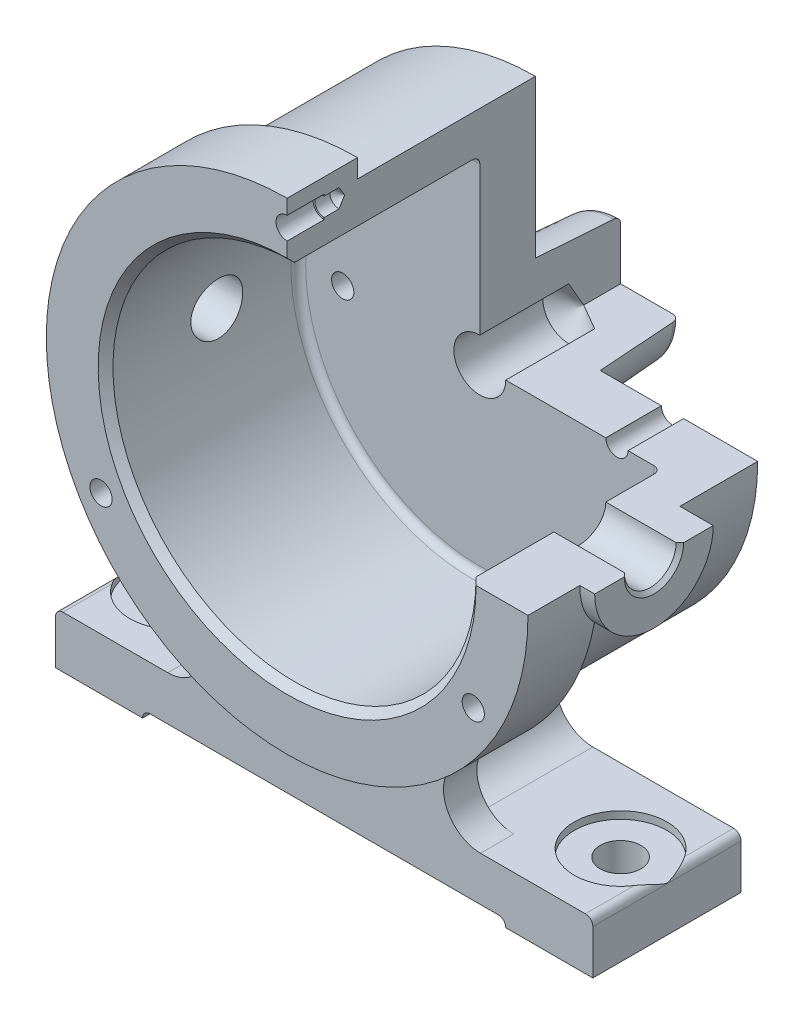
ISO-10303-21;
HEADER;
FILE_DESCRIPTION(('STEP AP214'),'2;1');
FILE_NAME('part.step','',(''),(''),'','','');
FILE_SCHEMA(('AUTOMOTIVE_DESIGN { 1 0 10303 214 1 1 1 1 }'));
ENDSEC;
DATA;
#1=APPLICATION_CONTEXT('core data for automotive mechanical design processes');
#2=APPLICATION_PROTOCOL_DEFINITION('international standard','automotive_design',2000,#1);
#3=PRODUCT_CONTEXT('',#1,'mechanical');
#4=PRODUCT('Part','Part','',(#3));
#5=PRODUCT_RELATED_PRODUCT_CATEGORY('part','',(#4));
#6=PRODUCT_DEFINITION_FORMATION('','',#4);
#7=PRODUCT_DEFINITION_CONTEXT('part definition',#1,'design');
#8=PRODUCT_DEFINITION('design','',#6,#7);
#9=PRODUCT_DEFINITION_SHAPE('','',#8);
#10=(LENGTH_UNIT() NAMED_UNIT(*) SI_UNIT(.MILLI.,.METRE.));
#11=(NAMED_UNIT(*) PLANE_ANGLE_UNIT() SI_UNIT($,.RADIAN.));
#12=(NAMED_UNIT(*) SI_UNIT($,.STERADIAN.) SOLID_ANGLE_UNIT());
#13=UNCERTAINTY_MEASURE_WITH_UNIT(LENGTH_MEASURE(1.E-05),#10,'distance_accuracy_value','');
#14=(GEOMETRIC_REPRESENTATION_CONTEXT(3) GLOBAL_UNCERTAINTY_ASSIGNED_CONTEXT((#13)) GLOBAL_UNIT_ASSIGNED_CONTEXT((#10,
#11,#12)) REPRESENTATION_CONTEXT('',''));
#15=CARTESIAN_POINT('',(0.,0.,0.));
#16=DIRECTION('',(0.,0.,1.));
#17=DIRECTION('',(1.,0.,0.));
#18=AXIS2_PLACEMENT_3D('',#15,#16,#17);
#19=CARTESIAN_POINT('',(49.,-86.,20.));
#20=DIRECTION('',(0.,1.,0.));
#21=DIRECTION('',(0.,0.,1.));
#22=AXIS2_PLACEMENT_3D('',#19,#20,#21);
#23=PLANE('',#22);
#24=DIRECTION('',(1.,0.,0.));
#25=VECTOR('',#24,1.);
#26=CARTESIAN_POINT('',(49.,-86.,-20.));
#27=LINE('',#26,#25);
#28=CARTESIAN_POINT('',(49.,-86.,-20.));
#29=VERTEX_POINT('',#28);
#30=CARTESIAN_POINT('',(72.5,-86.,-20.));
#31=VERTEX_POINT('',#30);
#32=EDGE_CURVE('E858',#29,#31,#27,.T.);
#33=ORIENTED_EDGE('',*,*,#32,.T.);
#34=DIRECTION('',(0.,0.,-1.));
#35=VECTOR('',#34,1.);
#36=CARTESIAN_POINT('',(72.5,-86.,20.));
#37=LINE('',#36,#35);
#38=CARTESIAN_POINT('',(72.5,-86.,20.));
#39=VERTEX_POINT('',#38);
#40=EDGE_CURVE('E689',#39,#31,#37,.T.);
#41=ORIENTED_EDGE('',*,*,#40,.F.);
#42=DIRECTION('',(1.,0.,0.));
#43=VECTOR('',#42,1.);
#44=CARTESIAN_POINT('',(49.,-86.,20.));
#45=LINE('',#44,#43);
#46=CARTESIAN_POINT('',(49.,-86.,20.));
#47=VERTEX_POINT('',#46);
#48=EDGE_CURVE('E889',#47,#39,#45,.T.);
#49=ORIENTED_EDGE('',*,*,#48,.F.);
#50=DIRECTION('',(0.,0.,-1.));
#51=VECTOR('',#50,1.);
#52=CARTESIAN_POINT('',(49.,-86.,20.));
#53=LINE('',#52,#51);
#54=EDGE_CURVE('E685',#47,#29,#53,.T.);
#55=ORIENTED_EDGE('',*,*,#54,.T.);
#56=EDGE_LOOP('',(#33,#41,#49,#55));
#57=FACE_BOUND('',#56,.T.);
#58=CARTESIAN_POINT('',(59.99,-86.,0.));
#59=DIRECTION('',(0.,-1.,0.));
#60=DIRECTION('',(0.,0.,1.));
#61=AXIS2_PLACEMENT_3D('',#58,#59,#60);
#62=CIRCLE('',#61,5.5);
#63=CARTESIAN_POINT('',(59.99,-86.,5.5));
#64=VERTEX_POINT('',#63);
#65=EDGE_CURVE('E764',#64,#64,#62,.T.);
#66=ORIENTED_EDGE('',*,*,#65,.F.);
#67=EDGE_LOOP('',(#66));
#68=FACE_BOUND('',#67,.T.);
#69=ADVANCED_FACE('F31',(#57,#68),#23,.F.);
#70=CARTESIAN_POINT('',(59.99,-74.,0.));
#71=DIRECTION('',(0.,1.,0.));
#72=DIRECTION('',(0.,0.,1.));
#73=AXIS2_PLACEMENT_3D('',#70,#71,#72);
#74=PLANE('',#73);
#75=CARTESIAN_POINT('',(59.99,-74.,0.));
#76=DIRECTION('',(0.,-1.,0.));
#77=DIRECTION('',(0.,0.,1.));
#78=AXIS2_PLACEMENT_3D('',#75,#76,#77);
#79=CIRCLE('',#78,12.5);
#80=CARTESIAN_POINT('',(59.99,-74.,12.5));
#81=VERTEX_POINT('',#80);
#82=EDGE_CURVE('E763',#81,#81,#79,.T.);
#83=ORIENTED_EDGE('',*,*,#82,.F.);
#84=EDGE_LOOP('',(#83));
#85=FACE_BOUND('',#84,.T.);
#86=CARTESIAN_POINT('',(59.99,-74.,0.));
#87=DIRECTION('',(0.,-1.,0.));
#88=DIRECTION('',(0.,0.,1.));
#89=AXIS2_PLACEMENT_3D('',#86,#87,#88);
#90=CIRCLE('',#89,5.5);
#91=CARTESIAN_POINT('',(59.99,-74.,5.5));
#92=VERTEX_POINT('',#91);
#93=EDGE_CURVE('E726',#92,#92,#90,.T.);
#94=ORIENTED_EDGE('',*,*,#93,.T.);
#95=EDGE_LOOP('',(#94));
#96=FACE_BOUND('',#95,.T.);
#97=ADVANCED_FACE('F543',(#85,#96),#74,.T.);
#98=CARTESIAN_POINT('',(72.5,-72.,20.));
#99=DIRECTION('',(0.,-1.,0.));
#100=DIRECTION('',(0.,0.,-1.));
#101=AXIS2_PLACEMENT_3D('',#98,#99,#100);
#102=PLANE('',#101);
#103=DIRECTION('',(-1.,0.,0.));
#104=VECTOR('',#103,1.);
#105=CARTESIAN_POINT('',(72.5,-72.,20.));
#106=LINE('',#105,#104);
#107=CARTESIAN_POINT('',(70.5,-72.,20.));
#108=VERTEX_POINT('',#107);
#109=CARTESIAN_POINT('',(42.2018956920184,-72.,20.));
#110=VERTEX_POINT('',#109);
#111=EDGE_CURVE('E760',#108,#110,#106,.T.);
#112=ORIENTED_EDGE('',*,*,#111,.F.);
#113=DIRECTION('',(0.,0.,-1.));
#114=VECTOR('',#113,1.);
#115=CARTESIAN_POINT('',(70.5,-72.,20.));
#116=LINE('',#115,#114);
#117=CARTESIAN_POINT('',(70.5,-72.,6.7668234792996));
#118=VERTEX_POINT('',#117);
#119=EDGE_CURVE('E563',#108,#118,#116,.T.);
#120=ORIENTED_EDGE('',*,*,#119,.T.);
#121=CARTESIAN_POINT('',(59.99,-72.,0.));
#122=DIRECTION('',(0.,-1.,0.));
#123=DIRECTION('',(0.,0.,1.));
#124=AXIS2_PLACEMENT_3D('',#121,#122,#123);
#125=CIRCLE('',#124,12.5);
#126=CARTESIAN_POINT('',(70.5,-72.,-6.7668234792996));
#127=VERTEX_POINT('',#126);
#128=EDGE_CURVE('E758',#118,#127,#125,.T.);
#129=ORIENTED_EDGE('',*,*,#128,.T.);
#130=DIRECTION('',(0.,0.,-1.));
#131=VECTOR('',#130,1.);
#132=CARTESIAN_POINT('',(70.5,-72.,20.));
#133=LINE('',#132,#131);
#134=CARTESIAN_POINT('',(70.5,-72.,-20.));
#135=VERTEX_POINT('',#134);
#136=EDGE_CURVE('E749',#127,#135,#133,.T.);
#137=ORIENTED_EDGE('',*,*,#136,.T.);
#138=DIRECTION('',(-1.,0.,0.));
#139=VECTOR('',#138,1.);
#140=CARTESIAN_POINT('',(72.5,-72.,-20.));
#141=LINE('',#140,#139);
#142=CARTESIAN_POINT('',(32.4961536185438,-72.,-20.));
#143=VERTEX_POINT('',#142);
#144=EDGE_CURVE('E863',#135,#143,#141,.T.);
#145=ORIENTED_EDGE('',*,*,#144,.T.);
#146=DIRECTION('',(0.,0.,-1.));
#147=VECTOR('',#146,1.);
#148=CARTESIAN_POINT('',(32.4961536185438,-72.,20.));
#149=LINE('',#148,#147);
#150=CARTESIAN_POINT('',(32.4961536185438,-72.,11.));
#151=VERTEX_POINT('',#150);
#152=EDGE_CURVE('E843',#151,#143,#149,.T.);
#153=ORIENTED_EDGE('',*,*,#152,.F.);
#154=DIRECTION('',(1.,0.,0.));
#155=VECTOR('',#154,1.);
#156=CARTESIAN_POINT('',(72.5,-72.,11.));
#157=LINE('',#156,#155);
#158=CARTESIAN_POINT('',(42.2018956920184,-72.,11.));
#159=VERTEX_POINT('',#158);
#160=EDGE_CURVE('E879',#151,#159,#157,.T.);
#161=ORIENTED_EDGE('',*,*,#160,.T.);
#162=DIRECTION('',(0.,0.,-1.));
#163=VECTOR('',#162,1.);
#164=CARTESIAN_POINT('',(42.2018956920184,-72.,168.546752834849));
#165=LINE('',#164,#163);
#166=EDGE_CURVE('E883',#110,#159,#165,.T.);
#167=ORIENTED_EDGE('',*,*,#166,.F.);
#168=EDGE_LOOP('',(#112,#120,#129,#137,#145,#153,#161,#167));
#169=FACE_BOUND('',#168,.T.);
#170=ADVANCED_FACE('F546',(#169),#102,.F.);
#171=CARTESIAN_POINT('',(0.,60.,11.));
#172=DIRECTION('',(0.,0.,1.));
#173=DIRECTION('',(1.,0.,0.));
#174=AXIS2_PLACEMENT_3D('',#171,#172,#173);
#175=PLANE('',#174);
#176=CARTESIAN_POINT('',(0.,0.,11.));
#177=DIRECTION('',(0.,0.,1.));
#178=DIRECTION('',(1.,0.,0.));
#179=AXIS2_PLACEMENT_3D('',#176,#177,#178);
#180=CIRCLE('',#179,60.);
#181=CARTESIAN_POINT('',(27.8538459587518,-53.1428571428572,11.));
#182=VERTEX_POINT('',#181);
#183=CARTESIAN_POINT('',(58.8642506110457,-11.6189500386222,11.));
#184=VERTEX_POINT('',#183);
#185=EDGE_CURVE('E696',#182,#184,#180,.T.);
#186=ORIENTED_EDGE('',*,*,#185,.T.);
#187=DIRECTION('',(1.,0.,0.));
#188=VECTOR('',#187,1.);
#189=CARTESIAN_POINT('',(-500000.,-11.6189500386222,11.));
#190=LINE('',#189,#188);
#191=CARTESIAN_POINT('',(63.9531078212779,-11.6189500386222,11.));
#192=VERTEX_POINT('',#191);
#193=EDGE_CURVE('E624',#192,#184,#190,.F.);
#194=ORIENTED_EDGE('',*,*,#193,.F.);
#195=CARTESIAN_POINT('',(0.,0.,11.));
#196=DIRECTION('',(0.,0.,1.));
#197=DIRECTION('',(1.,0.,0.));
#198=AXIS2_PLACEMENT_3D('',#195,#196,#197);
#199=CIRCLE('',#198,65.);
#200=CARTESIAN_POINT('',(36.5749762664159,-53.7333333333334,11.));
#201=VERTEX_POINT('',#200);
#202=EDGE_CURVE('E687',#201,#192,#199,.T.);
#203=ORIENTED_EDGE('',*,*,#202,.F.);
#204=CARTESIAN_POINT('',(42.2018956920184,-62.,11.));
#205=DIRECTION('',(0.,0.,1.));
#206=DIRECTION('',(1.,0.,0.));
#207=AXIS2_PLACEMENT_3D('',#204,#205,#206);
#208=CIRCLE('',#207,9.99999999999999);
#209=EDGE_CURVE('E647',#201,#159,#208,.T.);
#210=ORIENTED_EDGE('',*,*,#209,.T.);
#211=ORIENTED_EDGE('',*,*,#160,.F.);
#212=CARTESIAN_POINT('',(32.4961536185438,-62.,11.));
#213=DIRECTION('',(0.,0.,1.));
#214=DIRECTION('',(1.,0.,0.));
#215=AXIS2_PLACEMENT_3D('',#212,#213,#214);
#216=CIRCLE('',#215,9.99999999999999);
#217=EDGE_CURVE('E718',#182,#151,#216,.T.);
#218=ORIENTED_EDGE('',*,*,#217,.F.);
#219=EDGE_LOOP('',(#186,#194,#203,#210,#211,#218));
#220=FACE_BOUND('',#219,.T.);
#221=ADVANCED_FACE('F938',(#220),#175,.F.);
#222=CARTESIAN_POINT('',(0.,0.,0.));
#223=DIRECTION('',(0.,0.,1.));
#224=DIRECTION('',(1.,0.,0.));
#225=AXIS2_PLACEMENT_3D('',#222,#223,#224);
#226=CYLINDRICAL_SURFACE('',#225,65.);
#227=CARTESIAN_POINT('',(63.9531078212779,11.6189500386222,11.));
#228=CARTESIAN_POINT('',(64.0091063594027,11.3107811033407,11.3255546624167));
#229=CARTESIAN_POINT('',(64.0652713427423,10.9889183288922,11.6380799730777));
#230=CARTESIAN_POINT('',(64.1764170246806,10.3199850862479,12.235140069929));
#231=CARTESIAN_POINT('',(64.2313976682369,9.97291344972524,12.5196735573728));
#232=CARTESIAN_POINT('',(64.3386718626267,9.25563877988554,13.0588873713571));
#233=CARTESIAN_POINT('',(64.3909644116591,8.88542723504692,13.3135566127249));
#234=CARTESIAN_POINT('',(64.466270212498,8.31485744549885,13.6716348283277));
#235=CARTESIAN_POINT('',(64.4908506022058,8.12211998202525,13.7870094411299));
#236=CARTESIAN_POINT('',(64.5388103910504,7.7317938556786,14.0096345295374));
#237=CARTESIAN_POINT('',(64.5621894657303,7.53420390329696,14.1168828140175));
#238=CARTESIAN_POINT('',(64.6303062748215,6.93436384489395,14.4262629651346));
#239=CARTESIAN_POINT('',(64.6729871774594,6.52531674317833,14.615858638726));
#240=CARTESIAN_POINT('',(64.7516343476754,5.69218476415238,14.9600210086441));
#241=CARTESIAN_POINT('',(64.7876007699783,5.26810023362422,15.1145885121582));
#242=CARTESIAN_POINT('',(64.851789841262,4.40807680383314,15.3874048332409));
#243=CARTESIAN_POINT('',(64.8800168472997,3.97214472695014,15.5056740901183));
#244=CARTESIAN_POINT('',(64.9279425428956,3.09140105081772,15.7050023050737));
#245=CARTESIAN_POINT('',(64.9476414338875,2.64658966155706,15.78606214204));
#246=CARTESIAN_POINT('',(64.9776618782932,1.75972721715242,15.9091179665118));
#247=CARTESIAN_POINT('',(64.9881510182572,1.3177786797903,15.9518124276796));
#248=CARTESIAN_POINT('',(65.0000760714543,0.431740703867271,16.0003264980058));
#249=CARTESIAN_POINT('',(65.0015120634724,-0.012348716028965,16.0061464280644));
#250=CARTESIAN_POINT('',(64.9952904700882,-0.899424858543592,15.9808613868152));
#251=CARTESIAN_POINT('',(64.987632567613,-1.34241154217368,15.9497551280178));
#252=CARTESIAN_POINT('',(64.9634372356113,-2.22402323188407,15.8508823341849));
#253=CARTESIAN_POINT('',(64.9468999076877,-2.66264828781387,15.7831162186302));
#254=CARTESIAN_POINT('',(64.9057111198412,-3.52600657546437,15.6127528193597));
#255=CARTESIAN_POINT('',(64.8811818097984,-3.95084915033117,15.5106791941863));
#256=CARTESIAN_POINT('',(64.8246088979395,-4.79030963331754,15.2723054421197));
#257=CARTESIAN_POINT('',(64.7925652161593,-5.20492743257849,15.1360049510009));
#258=CARTESIAN_POINT('',(64.7218105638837,-6.02122356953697,14.8302015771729));
#259=CARTESIAN_POINT('',(64.6830983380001,-6.42289945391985,14.6606924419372));
#260=CARTESIAN_POINT('',(64.6000324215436,-7.21059243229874,14.2897462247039));
#261=CARTESIAN_POINT('',(64.5556791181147,-7.59661059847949,14.0883113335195));
#262=CARTESIAN_POINT('',(64.467420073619,-8.31066677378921,13.6778665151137));
#263=CARTESIAN_POINT('',(64.4239626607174,-8.64052024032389,13.4719083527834));
#264=CARTESIAN_POINT('',(64.3343689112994,-9.28410111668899,13.0367307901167));
#265=CARTESIAN_POINT('',(64.2882327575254,-9.59782962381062,12.8075129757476));
#266=CARTESIAN_POINT('',(64.1942765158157,-10.2073416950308,12.3272277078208));
#267=CARTESIAN_POINT('',(64.1464580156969,-10.5031414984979,12.0761805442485));
#268=CARTESIAN_POINT('',(64.0500858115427,-11.0756942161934,11.5533317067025));
#269=CARTESIAN_POINT('',(64.0015320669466,-11.3524460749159,11.2815288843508));
#270=CARTESIAN_POINT('',(63.9531078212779,-11.6189500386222,11.));
#271=B_SPLINE_CURVE_WITH_KNOTS('',3,(#227,#228,#229,#230,#231,#232,#233,#234,#235,#236,#237,
#238,#239,#240,#241,#242,#243,#244,#245,#246,#247,#248,#249,#250,#251,#252,#253,#254,#255,#256,
#257,#258,#259,#260,#261,#262,#263,#264,#265,#266,#267,#268,#269,#270),.UNSPECIFIED.,.F.,.F.,(4,
2,2,2,2,2,2,2,2,2,2,2,2,2,2,2,2,2,2,2,2,4),(0.,1.35484408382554,2.70975099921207,
4.06515925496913,4.74290028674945,5.42082341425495,6.77764037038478,8.13442605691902,
9.49044633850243,10.8464345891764,12.1772041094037,13.5079620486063,14.8387663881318,
16.1695555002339,17.4808905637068,18.7922395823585,20.1038357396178,21.4153419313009,
22.5882074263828,23.7609930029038,24.9326999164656,26.1044717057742),.UNSPECIFIED.);
#272=CARTESIAN_POINT('',(65.,0.,16.));
#273=VERTEX_POINT('',#272);
#274=EDGE_CURVE('E619',#273,#192,#271,.T.);
#275=ORIENTED_EDGE('',*,*,#274,.F.);
#276=DIRECTION('',(0.,0.,1.));
#277=VECTOR('',#276,1.);
#278=CARTESIAN_POINT('',(65.,0.,0.));
#279=LINE('',#278,#277);
#280=CARTESIAN_POINT('',(65.,0.,30.));
#281=VERTEX_POINT('',#280);
#282=EDGE_CURVE('E374',#273,#281,#279,.T.);
#283=ORIENTED_EDGE('',*,*,#282,.T.);
#284=CARTESIAN_POINT('',(0.,0.,30.));
#285=DIRECTION('',(0.,0.,1.));
#286=DIRECTION('',(1.,0.,0.));
#287=AXIS2_PLACEMENT_3D('',#284,#285,#286);
#288=CIRCLE('',#287,65.);
#289=CARTESIAN_POINT('',(0.,65.,30.));
#290=VERTEX_POINT('',#289);
#291=EDGE_CURVE('E712',#290,#281,#288,.T.);
#292=ORIENTED_EDGE('',*,*,#291,.F.);
#293=DIRECTION('',(0.,0.,1.));
#294=VECTOR('',#293,1.);
#295=CARTESIAN_POINT('',(0.,65.,0.));
#296=LINE('',#295,#294);
#297=CARTESIAN_POINT('',(0.,65.,11.));
#298=VERTEX_POINT('',#297);
#299=EDGE_CURVE('E423',#290,#298,#296,.F.);
#300=ORIENTED_EDGE('',*,*,#299,.T.);
#301=CARTESIAN_POINT('',(-63.9531078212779,11.6189500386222,11.));
#302=VERTEX_POINT('',#301);
#303=EDGE_CURVE('E668',#298,#302,#199,.T.);
#304=ORIENTED_EDGE('',*,*,#303,.T.);
#305=CARTESIAN_POINT('',(-63.9531078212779,11.6189500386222,11.));
#306=CARTESIAN_POINT('',(-64.0091063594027,11.3107811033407,11.3255546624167));
#307=CARTESIAN_POINT('',(-64.0652713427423,10.9889183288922,11.6380799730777));
#308=CARTESIAN_POINT('',(-64.1764170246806,10.3199850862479,12.235140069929));
#309=CARTESIAN_POINT('',(-64.2313976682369,9.97291344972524,12.5196735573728));
#310=CARTESIAN_POINT('',(-64.3386718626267,9.25563877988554,13.0588873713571));
#311=CARTESIAN_POINT('',(-64.3909644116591,8.88542723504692,13.3135566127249));
#312=CARTESIAN_POINT('',(-64.466270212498,8.31485744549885,13.6716348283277));
#313=CARTESIAN_POINT('',(-64.4908506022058,8.12211998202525,13.7870094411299));
#314=CARTESIAN_POINT('',(-64.5388103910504,7.7317938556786,14.0096345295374));
#315=CARTESIAN_POINT('',(-64.5621894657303,7.53420390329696,14.1168828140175));
#316=CARTESIAN_POINT('',(-64.6303062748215,6.93436384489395,14.4262629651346));
#317=CARTESIAN_POINT('',(-64.6729871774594,6.52531674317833,14.615858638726));
#318=CARTESIAN_POINT('',(-64.7516343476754,5.69218476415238,14.9600210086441));
#319=CARTESIAN_POINT('',(-64.7876007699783,5.26810023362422,15.1145885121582));
#320=CARTESIAN_POINT('',(-64.851789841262,4.40807680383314,15.3874048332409));
#321=CARTESIAN_POINT('',(-64.8800168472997,3.97214472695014,15.5056740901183));
#322=CARTESIAN_POINT('',(-64.9279425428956,3.09140105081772,15.7050023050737));
#323=CARTESIAN_POINT('',(-64.9476414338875,2.64658966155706,15.78606214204));
#324=CARTESIAN_POINT('',(-64.9776618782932,1.75972721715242,15.9091179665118));
#325=CARTESIAN_POINT('',(-64.9881510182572,1.3177786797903,15.9518124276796));
#326=CARTESIAN_POINT('',(-65.0000760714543,0.431740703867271,16.0003264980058));
#327=CARTESIAN_POINT('',(-65.0015120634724,-0.012348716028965,16.0061464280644));
#328=CARTESIAN_POINT('',(-64.9952904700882,-0.899424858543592,15.9808613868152));
#329=CARTESIAN_POINT('',(-64.987632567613,-1.34241154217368,15.9497551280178));
#330=CARTESIAN_POINT('',(-64.9634372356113,-2.22402323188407,15.8508823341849));
#331=CARTESIAN_POINT('',(-64.9468999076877,-2.66264828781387,15.7831162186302));
#332=CARTESIAN_POINT('',(-64.9057111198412,-3.52600657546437,15.6127528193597));
#333=CARTESIAN_POINT('',(-64.8811818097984,-3.95084915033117,15.5106791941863));
#334=CARTESIAN_POINT('',(-64.8246088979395,-4.79030963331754,15.2723054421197));
#335=CARTESIAN_POINT('',(-64.7925652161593,-5.20492743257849,15.1360049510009));
#336=CARTESIAN_POINT('',(-64.7218105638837,-6.02122356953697,14.8302015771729));
#337=CARTESIAN_POINT('',(-64.6830983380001,-6.42289945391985,14.6606924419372));
#338=CARTESIAN_POINT('',(-64.6000324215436,-7.21059243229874,14.2897462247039));
#339=CARTESIAN_POINT('',(-64.5556791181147,-7.59661059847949,14.0883113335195));
#340=CARTESIAN_POINT('',(-64.467420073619,-8.31066677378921,13.6778665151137));
#341=CARTESIAN_POINT('',(-64.4239626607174,-8.64052024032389,13.4719083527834));
#342=CARTESIAN_POINT('',(-64.3343689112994,-9.28410111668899,13.0367307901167));
#343=CARTESIAN_POINT('',(-64.2882327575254,-9.59782962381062,12.8075129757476));
#344=CARTESIAN_POINT('',(-64.1942765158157,-10.2073416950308,12.3272277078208));
#345=CARTESIAN_POINT('',(-64.1464580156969,-10.5031414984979,12.0761805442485));
#346=CARTESIAN_POINT('',(-64.0500858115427,-11.0756942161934,11.5533317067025));
#347=CARTESIAN_POINT('',(-64.0015320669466,-11.3524460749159,11.2815288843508));
#348=CARTESIAN_POINT('',(-63.9531078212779,-11.6189500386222,11.));
#349=B_SPLINE_CURVE_WITH_KNOTS('',3,(#305,#306,#307,#308,#309,#310,#311,#312,#313,#314,#315,
#316,#317,#318,#319,#320,#321,#322,#323,#324,#325,#326,#327,#328,#329,#330,#331,#332,#333,#334,
#335,#336,#337,#338,#339,#340,#341,#342,#343,#344,#345,#346,#347,#348),.UNSPECIFIED.,.F.,.F.,(4,
2,2,2,2,2,2,2,2,2,2,2,2,2,2,2,2,2,2,2,2,4),(0.,1.35484408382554,2.70975099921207,
4.06515925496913,4.74290028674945,5.42082341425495,6.77764037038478,8.13442605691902,
9.49044633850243,10.8464345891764,12.1772041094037,13.5079620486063,14.8387663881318,
16.1695555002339,17.4808905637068,18.7922395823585,20.1038357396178,21.4153419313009,
22.5882074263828,23.7609930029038,24.9326999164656,26.1044717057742),.UNSPECIFIED.);
#350=CARTESIAN_POINT('',(-63.9531078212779,-11.6189500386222,11.));
#351=VERTEX_POINT('',#350);
#352=EDGE_CURVE('E630',#302,#351,#349,.T.);
#353=ORIENTED_EDGE('',*,*,#352,.T.);
#354=CARTESIAN_POINT('',(-36.5749762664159,-53.7333333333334,11.));
#355=VERTEX_POINT('',#354);
#356=EDGE_CURVE('E679',#351,#355,#199,.T.);
#357=ORIENTED_EDGE('',*,*,#356,.T.);
#358=DIRECTION('',(0.,0.,-1.));
#359=VECTOR('',#358,1.);
#360=CARTESIAN_POINT('',(-36.5749762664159,-53.7333333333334,168.546752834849));
#361=LINE('',#360,#359);
#362=CARTESIAN_POINT('',(-36.5749762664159,-53.7333333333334,20.));
#363=VERTEX_POINT('',#362);
#364=EDGE_CURVE('E924',#363,#355,#361,.T.);
#365=ORIENTED_EDGE('',*,*,#364,.F.);
#366=CARTESIAN_POINT('',(0.,0.,20.));
#367=DIRECTION('',(0.,0.,1.));
#368=DIRECTION('',(1.,0.,0.));
#369=AXIS2_PLACEMENT_3D('',#366,#367,#368);
#370=CIRCLE('',#369,65.);
#371=CARTESIAN_POINT('',(36.5749762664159,-53.7333333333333,20.));
#372=VERTEX_POINT('',#371);
#373=EDGE_CURVE('E720',#363,#372,#370,.T.);
#374=ORIENTED_EDGE('',*,*,#373,.T.);
#375=DIRECTION('',(0.,0.,-1.));
#376=VECTOR('',#375,1.);
#377=CARTESIAN_POINT('',(36.5749762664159,-53.7333333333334,168.546752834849));
#378=LINE('',#377,#376);
#379=EDGE_CURVE('E933',#372,#201,#378,.T.);
#380=ORIENTED_EDGE('',*,*,#379,.T.);
#381=ORIENTED_EDGE('',*,*,#202,.T.);
#382=EDGE_LOOP('',(#275,#283,#292,#300,#304,#353,#357,#365,#374,#380,#381));
#383=FACE_BOUND('',#382,.T.);
#384=ADVANCED_FACE('F936',(#383),#226,.T.);
#385=ORIENTED_EDGE('',*,*,#303,.F.);
#386=DIRECTION('',(0.,-1.,0.));
#387=VECTOR('',#386,1.);
#388=CARTESIAN_POINT('',(0.,60.,11.));
#389=LINE('',#388,#387);
#390=CARTESIAN_POINT('',(0.,60.,11.));
#391=VERTEX_POINT('',#390);
#392=EDGE_CURVE('E420',#298,#391,#389,.T.);
#393=ORIENTED_EDGE('',*,*,#392,.T.);
#394=CARTESIAN_POINT('',(-58.8642506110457,11.6189500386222,11.));
#395=VERTEX_POINT('',#394);
#396=EDGE_CURVE('E670',#391,#395,#180,.T.);
#397=ORIENTED_EDGE('',*,*,#396,.T.);
#398=DIRECTION('',(-1.,0.,0.));
#399=VECTOR('',#398,1.);
#400=CARTESIAN_POINT('',(500000.,11.6189500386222,11.));
#401=LINE('',#400,#399);
#402=EDGE_CURVE('E638',#395,#302,#401,.T.);
#403=ORIENTED_EDGE('',*,*,#402,.T.);
#404=EDGE_LOOP('',(#385,#393,#397,#403));
#405=FACE_BOUND('',#404,.T.);
#406=ADVANCED_FACE('F667',(#405),#175,.F.);
#407=DIRECTION('',(-1.,0.,0.));
#408=VECTOR('',#407,1.);
#409=CARTESIAN_POINT('',(500000.,-11.6189500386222,11.));
#410=LINE('',#409,#408);
#411=CARTESIAN_POINT('',(-58.8642506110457,-11.6189500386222,11.));
#412=VERTEX_POINT('',#411);
#413=EDGE_CURVE('E632',#351,#412,#410,.F.);
#414=ORIENTED_EDGE('',*,*,#413,.T.);
#415=CARTESIAN_POINT('',(-27.8538459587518,-53.1428571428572,11.));
#416=VERTEX_POINT('',#415);
#417=EDGE_CURVE('E676',#412,#416,#180,.T.);
#418=ORIENTED_EDGE('',*,*,#417,.T.);
#419=CARTESIAN_POINT('',(-32.4961536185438,-62.,11.));
#420=DIRECTION('',(0.,0.,1.));
#421=DIRECTION('',(1.,0.,0.));
#422=AXIS2_PLACEMENT_3D('',#419,#420,#421);
#423=CIRCLE('',#422,9.99999999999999);
#424=CARTESIAN_POINT('',(-32.4961536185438,-72.,11.));
#425=VERTEX_POINT('',#424);
#426=EDGE_CURVE('E715',#425,#416,#423,.T.);
#427=ORIENTED_EDGE('',*,*,#426,.F.);
#428=DIRECTION('',(1.,0.,0.));
#429=VECTOR('',#428,1.);
#430=CARTESIAN_POINT('',(-72.5,-72.,11.));
#431=LINE('',#430,#429);
#432=CARTESIAN_POINT('',(-42.2018956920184,-72.,11.));
#433=VERTEX_POINT('',#432);
#434=EDGE_CURVE('E876',#433,#425,#431,.T.);
#435=ORIENTED_EDGE('',*,*,#434,.F.);
#436=CARTESIAN_POINT('',(-42.2018956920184,-62.,11.));
#437=DIRECTION('',(0.,0.,1.));
#438=DIRECTION('',(-1.,0.,0.));
#439=AXIS2_PLACEMENT_3D('',#436,#437,#438);
#440=CIRCLE('',#439,9.99999999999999);
#441=EDGE_CURVE('E682',#433,#355,#440,.T.);
#442=ORIENTED_EDGE('',*,*,#441,.T.);
#443=ORIENTED_EDGE('',*,*,#356,.F.);
#444=EDGE_LOOP('',(#414,#418,#427,#435,#442,#443));
#445=FACE_BOUND('',#444,.T.);
#446=ADVANCED_FACE('F675',(#445),#175,.F.);
#447=CARTESIAN_POINT('',(0.,0.,0.));
#448=DIRECTION('',(0.,0.,1.));
#449=DIRECTION('',(1.,0.,0.));
#450=AXIS2_PLACEMENT_3D('',#447,#448,#449);
#451=CYLINDRICAL_SURFACE('',#450,60.);
#452=CARTESIAN_POINT('',(0.,0.,-37.));
#453=DIRECTION('',(0.,0.,1.));
#454=DIRECTION('',(1.,0.,0.));
#455=AXIS2_PLACEMENT_3D('',#452,#453,#454);
#456=CIRCLE('',#455,60.);
#457=CARTESIAN_POINT('',(0.,60.,-37.));
#458=VERTEX_POINT('',#457);
#459=CARTESIAN_POINT('',(60.,0.,-37.));
#460=VERTEX_POINT('',#459);
#461=EDGE_CURVE('E699',#458,#460,#456,.T.);
#462=ORIENTED_EDGE('',*,*,#461,.T.);
#463=DIRECTION('',(0.,0.,1.));
#464=VECTOR('',#463,1.);
#465=CARTESIAN_POINT('',(60.,0.,0.));
#466=LINE('',#465,#464);
#467=CARTESIAN_POINT('',(60.,0.,-16.));
#468=VERTEX_POINT('',#467);
#469=EDGE_CURVE('E388',#460,#468,#466,.T.);
#470=ORIENTED_EDGE('',*,*,#469,.T.);
#471=CARTESIAN_POINT('',(58.8642506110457,-11.6189500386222,11.));
#472=CARTESIAN_POINT('',(58.8036826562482,-11.9257967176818,10.6759304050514));
#473=CARTESIAN_POINT('',(58.7433070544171,-12.219044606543,10.3389789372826));
#474=CARTESIAN_POINT('',(58.624576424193,-12.7765535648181,9.64151334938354));
#475=CARTESIAN_POINT('',(58.5662215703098,-13.0408121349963,9.2809972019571));
#476=CARTESIAN_POINT('',(58.4531369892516,-13.5386860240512,8.53838207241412));
#477=CARTESIAN_POINT('',(58.3984100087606,-13.7722782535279,8.15626713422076));
#478=CARTESIAN_POINT('',(58.3202728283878,-14.0981645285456,7.5691407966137));
#479=CARTESIAN_POINT('',(58.2948854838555,-14.202711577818,7.37110198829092));
#480=CARTESIAN_POINT('',(58.2455995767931,-14.4035000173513,6.97060844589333));
#481=CARTESIAN_POINT('',(58.2217014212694,-14.4997391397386,6.76815252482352));
#482=CARTESIAN_POINT('',(58.1524709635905,-14.7758669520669,6.15428025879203));
#483=CARTESIAN_POINT('',(58.1096523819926,-14.9429608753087,5.73672900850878));
#484=CARTESIAN_POINT('',(58.032045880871,-15.241570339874,4.88843335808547));
#485=CARTESIAN_POINT('',(57.9972577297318,-15.3730869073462,4.45768933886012));
#486=CARTESIAN_POINT('',(57.9368045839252,-15.5993717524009,3.58636466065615));
#487=CARTESIAN_POINT('',(57.9111324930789,-15.6941686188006,3.1457919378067));
#488=CARTESIAN_POINT('',(57.8696885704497,-15.8463049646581,2.25777411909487));
#489=CARTESIAN_POINT('',(57.8539164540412,-15.9036455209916,1.81032922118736));
#490=CARTESIAN_POINT('',(57.8330277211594,-15.979436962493,0.922648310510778));
#491=CARTESIAN_POINT('',(57.8276664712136,-15.9987808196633,0.482494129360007));
#492=CARTESIAN_POINT('',(57.8270228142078,-16.0011074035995,-0.39791458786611));
#493=CARTESIAN_POINT('',(57.8317402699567,-15.9840906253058,-0.838169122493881));
#494=CARTESIAN_POINT('',(57.8511106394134,-15.913840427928,-1.71565047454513));
#495=CARTESIAN_POINT('',(57.8657656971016,-15.8605991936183,-2.15287661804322));
#496=CARTESIAN_POINT('',(57.9045648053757,-15.7183586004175,-3.02104110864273));
#497=CARTESIAN_POINT('',(57.9287088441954,-15.6293592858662,-3.45197946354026));
#498=CARTESIAN_POINT('',(57.9853875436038,-15.417738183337,-4.29900567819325));
#499=CARTESIAN_POINT('',(58.0178097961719,-15.295565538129,-4.7152134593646));
#500=CARTESIAN_POINT('',(58.090252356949,-15.0180931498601,-5.53574244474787));
#501=CARTESIAN_POINT('',(58.1302725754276,-14.8627937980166,-5.9400637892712));
#502=CARTESIAN_POINT('',(58.2167836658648,-14.520237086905,-6.73422104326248));
#503=CARTESIAN_POINT('',(58.263274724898,-14.3329788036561,-7.12405653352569));
#504=CARTESIAN_POINT('',(58.3614470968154,-13.9278467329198,-7.8867975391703));
#505=CARTESIAN_POINT('',(58.4131285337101,-13.7099722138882,-8.25970264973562));
#506=CARTESIAN_POINT('',(58.5217252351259,-13.2388684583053,-8.9960244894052));
#507=CARTESIAN_POINT('',(58.578743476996,-12.9848498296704,-9.35892111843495));
#508=CARTESIAN_POINT('',(58.695205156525,-12.4478254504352,-10.062176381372));
#509=CARTESIAN_POINT('',(58.7546486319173,-12.164819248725,-10.4025346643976));
#510=CARTESIAN_POINT('',(58.8743510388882,-11.5716176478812,-11.0586294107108));
#511=CARTESIAN_POINT('',(58.9346101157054,-11.2614173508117,-11.3743614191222));
#512=CARTESIAN_POINT('',(59.0543097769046,-10.6158489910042,-11.9791226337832));
#513=CARTESIAN_POINT('',(59.1137503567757,-10.2804807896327,-12.2681516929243));
#514=CARTESIAN_POINT('',(59.2316783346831,-9.57800816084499,-12.8244874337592));
#515=CARTESIAN_POINT('',(59.2901047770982,-9.21032002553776,-13.0910706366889));
#516=CARTESIAN_POINT('',(59.40278293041,-8.45315663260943,-13.5922873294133));
#517=CARTESIAN_POINT('',(59.4570345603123,-8.06368095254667,-13.8269201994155));
#518=CARTESIAN_POINT('',(59.5598244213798,-7.26561382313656,-14.2624500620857));
#519=CARTESIAN_POINT('',(59.6083631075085,-6.85702389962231,-14.463349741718));
#520=CARTESIAN_POINT('',(59.6983460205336,-6.02354895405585,-14.8298379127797));
#521=CARTESIAN_POINT('',(59.7397903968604,-5.59866427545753,-14.9954271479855));
#522=CARTESIAN_POINT('',(59.8138696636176,-4.74166467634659,-15.2878625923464));
#523=CARTESIAN_POINT('',(59.8466192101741,-4.30973287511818,-15.4152162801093));
#524=CARTESIAN_POINT('',(59.9031278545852,-3.4361097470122,-15.6331640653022));
#525=CARTESIAN_POINT('',(59.9268870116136,-2.99441848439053,-15.7237584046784));
#526=CARTESIAN_POINT('',(59.9647292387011,-2.10463564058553,-15.8673740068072));
#527=CARTESIAN_POINT('',(59.9788140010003,-1.65654519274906,-15.9204018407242));
#528=CARTESIAN_POINT('',(59.9969060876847,-0.757287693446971,-15.9884278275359));
#529=CARTESIAN_POINT('',(60.0009136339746,-0.306120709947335,-16.003426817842));
#530=CARTESIAN_POINT('',(59.9987690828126,0.582393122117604,-15.9953833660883));
#531=CARTESIAN_POINT('',(59.9929160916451,1.01975127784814,-15.9734608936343));
#532=CARTESIAN_POINT('',(59.9717775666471,1.89096606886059,-15.8938848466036));
#533=CARTESIAN_POINT('',(59.9564922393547,2.32482278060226,-15.836232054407));
#534=CARTESIAN_POINT('',(59.9169051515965,3.18594830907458,-15.685687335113));
#535=CARTESIAN_POINT('',(59.8926035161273,3.613217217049,-15.5927958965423));
#536=CARTESIAN_POINT('',(59.8356394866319,4.45820319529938,-15.3725423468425));
#537=CARTESIAN_POINT('',(59.8029770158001,4.87592017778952,-15.2451799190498));
#538=CARTESIAN_POINT('',(59.730186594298,5.69870971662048,-14.9570915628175));
#539=CARTESIAN_POINT('',(59.6900633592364,6.10379007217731,-14.7963867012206));
#540=CARTESIAN_POINT('',(59.6033957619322,6.89892544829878,-14.4427888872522));
#541=CARTESIAN_POINT('',(59.5568514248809,7.28898052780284,-14.2498960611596));
#542=CARTESIAN_POINT('',(59.458548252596,8.05164005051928,-13.8332903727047));
#543=CARTESIAN_POINT('',(59.4067887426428,8.4242422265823,-13.6095735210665));
#544=CARTESIAN_POINT('',(59.2993957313,9.14965226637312,-13.132869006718));
#545=CARTESIAN_POINT('',(59.2437620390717,9.50245915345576,-12.8798799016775));
#546=CARTESIAN_POINT('',(59.1283878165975,10.1961256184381,-12.3384848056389));
#547=CARTESIAN_POINT('',(59.0685747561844,10.5363337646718,-12.0492592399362));
#548=CARTESIAN_POINT('',(58.9479890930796,11.191313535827,-11.4434916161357));
#549=CARTESIAN_POINT('',(58.8872164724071,11.5060846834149,-11.1269490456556));
#550=CARTESIAN_POINT('',(58.7663687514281,12.108188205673,-10.4685624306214));
#551=CARTESIAN_POINT('',(58.7062937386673,12.3955171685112,-10.1267152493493));
#552=CARTESIAN_POINT('',(58.5885157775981,12.9407742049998,-9.41995555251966));
#553=CARTESIAN_POINT('',(58.5308127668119,13.1987030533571,-9.05504364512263));
#554=CARTESIAN_POINT('',(58.4184744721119,13.6874315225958,-8.29822183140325));
#555=CARTESIAN_POINT('',(58.3639063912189,13.9177070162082,-7.90596318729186));
#556=CARTESIAN_POINT('',(58.2605279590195,14.3443048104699,-7.10265725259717));
#557=CARTESIAN_POINT('',(58.2117176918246,14.540626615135,-6.69160968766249));
#558=CARTESIAN_POINT('',(58.1213501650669,14.8977382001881,-5.85361557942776));
#559=CARTESIAN_POINT('',(58.0797923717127,15.0585305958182,-5.42667020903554));
#560=CARTESIAN_POINT('',(58.0052290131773,15.3432425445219,-4.55993030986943));
#561=CARTESIAN_POINT('',(57.9722232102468,15.4671631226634,-4.1201361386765));
#562=CARTESIAN_POINT('',(57.9164664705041,15.674635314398,-3.24114765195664));
#563=CARTESIAN_POINT('',(57.893498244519,15.7590454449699,-2.80216969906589));
#564=CARTESIAN_POINT('',(57.8574531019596,15.8908718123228,-1.91828977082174));
#565=CARTESIAN_POINT('',(57.8443760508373,15.9382885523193,-1.47338787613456));
#566=CARTESIAN_POINT('',(57.8285300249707,15.9956870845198,-0.581168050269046));
#567=CARTESIAN_POINT('',(57.825756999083,16.0056835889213,-0.133851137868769));
#568=CARTESIAN_POINT('',(57.8305962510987,15.9881900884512,0.759987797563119));
#569=CARTESIAN_POINT('',(57.8382083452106,15.9607007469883,1.20650983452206));
#570=CARTESIAN_POINT('',(57.8632217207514,15.8697733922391,2.0830295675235));
#571=CARTESIAN_POINT('',(57.8803449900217,15.8073559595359,2.51314155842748));
#572=CARTESIAN_POINT('',(57.923667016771,15.647863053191,3.36641598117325));
#573=CARTESIAN_POINT('',(57.9498656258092,15.5507881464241,3.78957852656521));
#574=CARTESIAN_POINT('',(58.0105898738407,15.3227079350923,4.62631356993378));
#575=CARTESIAN_POINT('',(58.0451205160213,15.1916822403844,5.03988014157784));
#576=CARTESIAN_POINT('',(58.1215094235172,14.8967555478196,5.85442623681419));
#577=CARTESIAN_POINT('',(58.1633679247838,14.7328534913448,6.25540535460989));
#578=CARTESIAN_POINT('',(58.2540643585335,14.3700926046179,7.04942803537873));
#579=CARTESIAN_POINT('',(58.3030164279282,14.1706466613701,7.44219029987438));
#580=CARTESIAN_POINT('',(58.4059141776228,13.7403819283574,8.2094704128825));
#581=CARTESIAN_POINT('',(58.4598601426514,13.5095613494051,8.5839872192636));
#582=CARTESIAN_POINT('',(58.5712226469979,13.0182667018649,9.31222296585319));
#583=CARTESIAN_POINT('',(58.6286375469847,12.757806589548,9.66595157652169));
#584=CARTESIAN_POINT('',(58.7453910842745,12.2089193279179,10.3506064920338));
#585=CARTESIAN_POINT('',(58.804729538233,11.9204948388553,10.6815349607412));
#586=CARTESIAN_POINT('',(58.8642506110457,11.6189500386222,11.));
#587=B_SPLINE_CURVE_WITH_KNOTS('',3,(#471,#472,#473,#474,#475,#476,#477,#478,#479,#480,#481,
#482,#483,#484,#485,#486,#487,#488,#489,#490,#491,#492,#493,#494,#495,#496,#497,#498,#499,#500,
#501,#502,#503,#504,#505,#506,#507,#508,#509,#510,#511,#512,#513,#514,#515,#516,#517,#518,#519,
#520,#521,#522,#523,#524,#525,#526,#527,#528,#529,#530,#531,#532,#533,#534,#535,#536,#537,#538,
#539,#540,#541,#542,#543,#544,#545,#546,#547,#548,#549,#550,#551,#552,#553,#554,#555,#556,#557,
#558,#559,#560,#561,#562,#563,#564,#565,#566,#567,#568,#569,#570,#571,#572,#573,#574,#575,#576,
#577,#578,#579,#580,#581,#582,#583,#584,#585,#586),.UNSPECIFIED.,.F.,.F.,(4,2,2,2,2,2,2,2,2,2,2,
2,2,2,2,2,2,2,2,2,2,2,2,2,2,2,2,2,2,2,2,2,2,2,2,2,2,2,2,2,2,2,2,2,2,2,2,2,2,2,2,2,2,2,2,2,2,4),
(0.,1.35071737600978,2.7015511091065,4.05339615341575,4.72934751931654,5.40548282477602,
6.75902626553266,8.11253066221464,9.46497913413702,10.8173887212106,12.1376155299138,
13.4578243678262,14.7783181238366,16.0988102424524,17.4022458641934,18.7056660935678,
20.0091240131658,21.3126130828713,22.6509460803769,23.9892999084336,25.3278952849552,
26.6664980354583,28.0385575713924,29.4106437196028,30.782620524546,32.1545684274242,
33.5074083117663,34.8602392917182,36.2128335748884,37.5653980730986,38.877668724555,
40.1899106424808,41.5021343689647,42.8143701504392,44.1257793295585,45.4371833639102,
46.7487572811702,48.0603958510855,49.4104048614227,50.7604391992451,52.1106411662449,
53.4608075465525,54.8334890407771,56.2061905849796,57.5787910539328,58.9513533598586,
60.2925214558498,61.6336713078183,62.9742938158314,64.314892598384,65.6182240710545,
66.9215342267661,68.2256289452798,69.5297656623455,70.857871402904,72.186052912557,
73.5136115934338,74.8410441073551),.UNSPECIFIED.);
#588=EDGE_CURVE('E612',#184,#468,#587,.T.);
#589=ORIENTED_EDGE('',*,*,#588,.F.);
#590=ORIENTED_EDGE('',*,*,#185,.F.);
#591=DIRECTION('',(0.,0.,-1.));
#592=VECTOR('',#591,1.);
#593=CARTESIAN_POINT('',(27.8538459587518,-53.1428571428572,20.));
#594=LINE('',#593,#592);
#595=CARTESIAN_POINT('',(27.8538459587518,-53.1428571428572,-20.));
#596=VERTEX_POINT('',#595);
#597=EDGE_CURVE('E841',#182,#596,#594,.T.);
#598=ORIENTED_EDGE('',*,*,#597,.T.);
#599=CARTESIAN_POINT('',(0.,0.,-20.));
#600=DIRECTION('',(0.,0.,-1.));
#601=DIRECTION('',(1.,0.,0.));
#602=AXIS2_PLACEMENT_3D('',#599,#600,#601);
#603=CIRCLE('',#602,60.);
#604=CARTESIAN_POINT('',(-27.8538459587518,-53.1428571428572,-20.));
#605=VERTEX_POINT('',#604);
#606=EDGE_CURVE('E823',#596,#605,#603,.T.);
#607=ORIENTED_EDGE('',*,*,#606,.T.);
#608=DIRECTION('',(0.,0.,-1.));
#609=VECTOR('',#608,1.);
#610=CARTESIAN_POINT('',(-27.8538459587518,-53.1428571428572,20.));
#611=LINE('',#610,#609);
#612=EDGE_CURVE('E838',#416,#605,#611,.T.);
#613=ORIENTED_EDGE('',*,*,#612,.F.);
#614=ORIENTED_EDGE('',*,*,#417,.F.);
#615=CARTESIAN_POINT('',(-58.8642506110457,-11.6189500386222,11.));
#616=CARTESIAN_POINT('',(-58.8036826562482,-11.9257967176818,10.6759304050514));
#617=CARTESIAN_POINT('',(-58.7433070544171,-12.219044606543,10.3389789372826));
#618=CARTESIAN_POINT('',(-58.624576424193,-12.7765535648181,9.64151334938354));
#619=CARTESIAN_POINT('',(-58.5662215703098,-13.0408121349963,9.2809972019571));
#620=CARTESIAN_POINT('',(-58.4531369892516,-13.5386860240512,8.53838207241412));
#621=CARTESIAN_POINT('',(-58.3984100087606,-13.7722782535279,8.15626713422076));
#622=CARTESIAN_POINT('',(-58.3202728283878,-14.0981645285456,7.5691407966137));
#623=CARTESIAN_POINT('',(-58.2948854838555,-14.202711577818,7.37110198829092));
#624=CARTESIAN_POINT('',(-58.2455995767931,-14.4035000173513,6.97060844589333));
#625=CARTESIAN_POINT('',(-58.2217014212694,-14.4997391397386,6.76815252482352));
#626=CARTESIAN_POINT('',(-58.1524709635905,-14.7758669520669,6.15428025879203));
#627=CARTESIAN_POINT('',(-58.1096523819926,-14.9429608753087,5.73672900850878));
#628=CARTESIAN_POINT('',(-58.032045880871,-15.241570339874,4.88843335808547));
#629=CARTESIAN_POINT('',(-57.9972577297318,-15.3730869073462,4.45768933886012));
#630=CARTESIAN_POINT('',(-57.9368045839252,-15.5993717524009,3.58636466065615));
#631=CARTESIAN_POINT('',(-57.9111324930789,-15.6941686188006,3.1457919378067));
#632=CARTESIAN_POINT('',(-57.8696885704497,-15.8463049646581,2.25777411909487));
#633=CARTESIAN_POINT('',(-57.8539164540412,-15.9036455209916,1.81032922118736));
#634=CARTESIAN_POINT('',(-57.8330277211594,-15.979436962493,0.922648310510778));
#635=CARTESIAN_POINT('',(-57.8276664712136,-15.9987808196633,0.482494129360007));
#636=CARTESIAN_POINT('',(-57.8270228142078,-16.0011074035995,-0.39791458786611));
#637=CARTESIAN_POINT('',(-57.8317402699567,-15.9840906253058,-0.838169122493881));
#638=CARTESIAN_POINT('',(-57.8511106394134,-15.913840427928,-1.71565047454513));
#639=CARTESIAN_POINT('',(-57.8657656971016,-15.8605991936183,-2.15287661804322));
#640=CARTESIAN_POINT('',(-57.9045648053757,-15.7183586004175,-3.02104110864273));
#641=CARTESIAN_POINT('',(-57.9287088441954,-15.6293592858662,-3.45197946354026));
#642=CARTESIAN_POINT('',(-57.9853875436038,-15.417738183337,-4.29900567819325));
#643=CARTESIAN_POINT('',(-58.0178097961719,-15.295565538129,-4.7152134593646));
#644=CARTESIAN_POINT('',(-58.090252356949,-15.0180931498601,-5.53574244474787));
#645=CARTESIAN_POINT('',(-58.1302725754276,-14.8627937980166,-5.9400637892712));
#646=CARTESIAN_POINT('',(-58.2167836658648,-14.520237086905,-6.73422104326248));
#647=CARTESIAN_POINT('',(-58.263274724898,-14.3329788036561,-7.12405653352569));
#648=CARTESIAN_POINT('',(-58.3614470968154,-13.9278467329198,-7.8867975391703));
#649=CARTESIAN_POINT('',(-58.4131285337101,-13.7099722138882,-8.25970264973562));
#650=CARTESIAN_POINT('',(-58.5217252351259,-13.2388684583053,-8.9960244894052));
#651=CARTESIAN_POINT('',(-58.578743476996,-12.9848498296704,-9.35892111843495));
#652=CARTESIAN_POINT('',(-58.695205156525,-12.4478254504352,-10.062176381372));
#653=CARTESIAN_POINT('',(-58.7546486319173,-12.164819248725,-10.4025346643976));
#654=CARTESIAN_POINT('',(-58.8743510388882,-11.5716176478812,-11.0586294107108));
#655=CARTESIAN_POINT('',(-58.9346101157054,-11.2614173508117,-11.3743614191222));
#656=CARTESIAN_POINT('',(-59.0543097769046,-10.6158489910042,-11.9791226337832));
#657=CARTESIAN_POINT('',(-59.1137503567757,-10.2804807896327,-12.2681516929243));
#658=CARTESIAN_POINT('',(-59.2316783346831,-9.57800816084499,-12.8244874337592));
#659=CARTESIAN_POINT('',(-59.2901047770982,-9.21032002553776,-13.0910706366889));
#660=CARTESIAN_POINT('',(-59.40278293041,-8.45315663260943,-13.5922873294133));
#661=CARTESIAN_POINT('',(-59.4570345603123,-8.06368095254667,-13.8269201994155));
#662=CARTESIAN_POINT('',(-59.5598244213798,-7.26561382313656,-14.2624500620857));
#663=CARTESIAN_POINT('',(-59.6083631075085,-6.85702389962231,-14.463349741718));
#664=CARTESIAN_POINT('',(-59.6983460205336,-6.02354895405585,-14.8298379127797));
#665=CARTESIAN_POINT('',(-59.7397903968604,-5.59866427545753,-14.9954271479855));
#666=CARTESIAN_POINT('',(-59.8138696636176,-4.74166467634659,-15.2878625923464));
#667=CARTESIAN_POINT('',(-59.8466192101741,-4.30973287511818,-15.4152162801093));
#668=CARTESIAN_POINT('',(-59.9031278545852,-3.4361097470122,-15.6331640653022));
#669=CARTESIAN_POINT('',(-59.9268870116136,-2.99441848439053,-15.7237584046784));
#670=CARTESIAN_POINT('',(-59.9647292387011,-2.10463564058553,-15.8673740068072));
#671=CARTESIAN_POINT('',(-59.9788140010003,-1.65654519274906,-15.9204018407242));
#672=CARTESIAN_POINT('',(-59.9969060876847,-0.757287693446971,-15.9884278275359));
#673=CARTESIAN_POINT('',(-60.0009136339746,-0.306120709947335,-16.003426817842));
#674=CARTESIAN_POINT('',(-59.9987690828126,0.582393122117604,-15.9953833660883));
#675=CARTESIAN_POINT('',(-59.9929160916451,1.01975127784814,-15.9734608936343));
#676=CARTESIAN_POINT('',(-59.9717775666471,1.89096606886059,-15.8938848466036));
#677=CARTESIAN_POINT('',(-59.9564922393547,2.32482278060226,-15.836232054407));
#678=CARTESIAN_POINT('',(-59.9169051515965,3.18594830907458,-15.685687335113));
#679=CARTESIAN_POINT('',(-59.8926035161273,3.613217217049,-15.5927958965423));
#680=CARTESIAN_POINT('',(-59.8356394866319,4.45820319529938,-15.3725423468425));
#681=CARTESIAN_POINT('',(-59.8029770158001,4.87592017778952,-15.2451799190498));
#682=CARTESIAN_POINT('',(-59.730186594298,5.69870971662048,-14.9570915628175));
#683=CARTESIAN_POINT('',(-59.6900633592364,6.10379007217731,-14.7963867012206));
#684=CARTESIAN_POINT('',(-59.6033957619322,6.89892544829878,-14.4427888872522));
#685=CARTESIAN_POINT('',(-59.5568514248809,7.28898052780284,-14.2498960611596));
#686=CARTESIAN_POINT('',(-59.458548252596,8.05164005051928,-13.8332903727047));
#687=CARTESIAN_POINT('',(-59.4067887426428,8.4242422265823,-13.6095735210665));
#688=CARTESIAN_POINT('',(-59.2993957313,9.14965226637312,-13.132869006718));
#689=CARTESIAN_POINT('',(-59.2437620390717,9.50245915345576,-12.8798799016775));
#690=CARTESIAN_POINT('',(-59.1283878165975,10.1961256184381,-12.3384848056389));
#691=CARTESIAN_POINT('',(-59.0685747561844,10.5363337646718,-12.0492592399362));
#692=CARTESIAN_POINT('',(-58.9479890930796,11.191313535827,-11.4434916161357));
#693=CARTESIAN_POINT('',(-58.8872164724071,11.5060846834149,-11.1269490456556));
#694=CARTESIAN_POINT('',(-58.7663687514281,12.108188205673,-10.4685624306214));
#695=CARTESIAN_POINT('',(-58.7062937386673,12.3955171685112,-10.1267152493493));
#696=CARTESIAN_POINT('',(-58.5885157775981,12.9407742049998,-9.41995555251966));
#697=CARTESIAN_POINT('',(-58.5308127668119,13.1987030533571,-9.05504364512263));
#698=CARTESIAN_POINT('',(-58.4184744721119,13.6874315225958,-8.29822183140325));
#699=CARTESIAN_POINT('',(-58.3639063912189,13.9177070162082,-7.90596318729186));
#700=CARTESIAN_POINT('',(-58.2605279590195,14.3443048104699,-7.10265725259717));
#701=CARTESIAN_POINT('',(-58.2117176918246,14.540626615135,-6.69160968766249));
#702=CARTESIAN_POINT('',(-58.1213501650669,14.8977382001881,-5.85361557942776));
#703=CARTESIAN_POINT('',(-58.0797923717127,15.0585305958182,-5.42667020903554));
#704=CARTESIAN_POINT('',(-58.0052290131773,15.3432425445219,-4.55993030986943));
#705=CARTESIAN_POINT('',(-57.9722232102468,15.4671631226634,-4.1201361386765));
#706=CARTESIAN_POINT('',(-57.9164664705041,15.674635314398,-3.24114765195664));
#707=CARTESIAN_POINT('',(-57.893498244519,15.7590454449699,-2.80216969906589));
#708=CARTESIAN_POINT('',(-57.8574531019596,15.8908718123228,-1.91828977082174));
#709=CARTESIAN_POINT('',(-57.8443760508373,15.9382885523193,-1.47338787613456));
#710=CARTESIAN_POINT('',(-57.8285300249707,15.9956870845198,-0.581168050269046));
#711=CARTESIAN_POINT('',(-57.825756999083,16.0056835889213,-0.133851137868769));
#712=CARTESIAN_POINT('',(-57.8305962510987,15.9881900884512,0.759987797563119));
#713=CARTESIAN_POINT('',(-57.8382083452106,15.9607007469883,1.20650983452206));
#714=CARTESIAN_POINT('',(-57.8632217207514,15.8697733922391,2.0830295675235));
#715=CARTESIAN_POINT('',(-57.8803449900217,15.8073559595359,2.51314155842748));
#716=CARTESIAN_POINT('',(-57.923667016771,15.647863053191,3.36641598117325));
#717=CARTESIAN_POINT('',(-57.9498656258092,15.5507881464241,3.78957852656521));
#718=CARTESIAN_POINT('',(-58.0105898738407,15.3227079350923,4.62631356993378));
#719=CARTESIAN_POINT('',(-58.0451205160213,15.1916822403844,5.03988014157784));
#720=CARTESIAN_POINT('',(-58.1215094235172,14.8967555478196,5.85442623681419));
#721=CARTESIAN_POINT('',(-58.1633679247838,14.7328534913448,6.25540535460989));
#722=CARTESIAN_POINT('',(-58.2540643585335,14.3700926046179,7.04942803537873));
#723=CARTESIAN_POINT('',(-58.3030164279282,14.1706466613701,7.44219029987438));
#724=CARTESIAN_POINT('',(-58.4059141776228,13.7403819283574,8.2094704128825));
#725=CARTESIAN_POINT('',(-58.4598601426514,13.5095613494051,8.5839872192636));
#726=CARTESIAN_POINT('',(-58.5712226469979,13.0182667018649,9.31222296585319));
#727=CARTESIAN_POINT('',(-58.6286375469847,12.757806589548,9.66595157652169));
#728=CARTESIAN_POINT('',(-58.7453910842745,12.2089193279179,10.3506064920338));
#729=CARTESIAN_POINT('',(-58.804729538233,11.9204948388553,10.6815349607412));
#730=CARTESIAN_POINT('',(-58.8642506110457,11.6189500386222,11.));
#731=B_SPLINE_CURVE_WITH_KNOTS('',3,(#615,#616,#617,#618,#619,#620,#621,#622,#623,#624,#625,
#626,#627,#628,#629,#630,#631,#632,#633,#634,#635,#636,#637,#638,#639,#640,#641,#642,#643,#644,
#645,#646,#647,#648,#649,#650,#651,#652,#653,#654,#655,#656,#657,#658,#659,#660,#661,#662,#663,
#664,#665,#666,#667,#668,#669,#670,#671,#672,#673,#674,#675,#676,#677,#678,#679,#680,#681,#682,
#683,#684,#685,#686,#687,#688,#689,#690,#691,#692,#693,#694,#695,#696,#697,#698,#699,#700,#701,
#702,#703,#704,#705,#706,#707,#708,#709,#710,#711,#712,#713,#714,#715,#716,#717,#718,#719,#720,
#721,#722,#723,#724,#725,#726,#727,#728,#729,#730),.UNSPECIFIED.,.F.,.F.,(4,2,2,2,2,2,2,2,2,2,2,
2,2,2,2,2,2,2,2,2,2,2,2,2,2,2,2,2,2,2,2,2,2,2,2,2,2,2,2,2,2,2,2,2,2,2,2,2,2,2,2,2,2,2,2,2,2,4),
(0.,1.35071737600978,2.7015511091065,4.05339615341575,4.72934751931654,5.40548282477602,
6.75902626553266,8.11253066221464,9.46497913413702,10.8173887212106,12.1376155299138,
13.4578243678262,14.7783181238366,16.0988102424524,17.4022458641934,18.7056660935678,
20.0091240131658,21.3126130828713,22.6509460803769,23.9892999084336,25.3278952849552,
26.6664980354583,28.0385575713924,29.4106437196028,30.782620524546,32.1545684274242,
33.5074083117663,34.8602392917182,36.2128335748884,37.5653980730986,38.877668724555,
40.1899106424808,41.5021343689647,42.8143701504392,44.1257793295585,45.4371833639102,
46.7487572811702,48.0603958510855,49.4104048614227,50.7604391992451,52.1106411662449,
53.4608075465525,54.8334890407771,56.2061905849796,57.5787910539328,58.9513533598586,
60.2925214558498,61.6336713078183,62.9742938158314,64.314892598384,65.6182240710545,
66.9215342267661,68.2256289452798,69.5297656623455,70.857871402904,72.186052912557,
73.5136115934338,74.8410441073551),.UNSPECIFIED.);
#732=EDGE_CURVE('E657',#412,#395,#731,.T.);
#733=ORIENTED_EDGE('',*,*,#732,.T.);
#734=ORIENTED_EDGE('',*,*,#396,.F.);
#735=DIRECTION('',(0.,0.,1.));
#736=VECTOR('',#735,1.);
#737=CARTESIAN_POINT('',(0.,60.,0.));
#738=LINE('',#737,#736);
#739=EDGE_CURVE('E417',#391,#458,#738,.F.);
#740=ORIENTED_EDGE('',*,*,#739,.T.);
#741=EDGE_LOOP('',(#462,#470,#589,#590,#598,#607,#613,#614,#733,#734,#740));
#742=FACE_BOUND('',#741,.T.);
#743=ADVANCED_FACE('F871',(#742),#451,.T.);
#744=CARTESIAN_POINT('',(0.,65.,30.));
#745=DIRECTION('',(0.,0.,-1.));
#746=DIRECTION('',(-1.,0.,0.));
#747=AXIS2_PLACEMENT_3D('',#744,#745,#746);
#748=PLANE('',#747);
#749=CARTESIAN_POINT('',(-50.2294734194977,-28.9999999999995,30.));
#750=DIRECTION('',(0.,0.,1.));
#751=DIRECTION('',(1.,0.,0.));
#752=AXIS2_PLACEMENT_3D('',#749,#750,#751);
#753=CIRCLE('',#752,3.);
#754=CARTESIAN_POINT('',(-47.2294734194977,-28.9999999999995,30.));
#755=VERTEX_POINT('',#754);
#756=EDGE_CURVE('E484',#755,#755,#753,.T.);
#757=ORIENTED_EDGE('',*,*,#756,.F.);
#758=EDGE_LOOP('',(#757));
#759=FACE_BOUND('',#758,.T.);
#760=CARTESIAN_POINT('',(50.2294734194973,-29.0000000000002,30.));
#761=DIRECTION('',(0.,0.,1.));
#762=DIRECTION('',(1.,0.,0.));
#763=AXIS2_PLACEMENT_3D('',#760,#761,#762);
#764=CIRCLE('',#763,3.);
#765=CARTESIAN_POINT('',(53.2294734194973,-29.0000000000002,30.));
#766=VERTEX_POINT('',#765);
#767=EDGE_CURVE('E496',#766,#766,#764,.T.);
#768=ORIENTED_EDGE('',*,*,#767,.F.);
#769=EDGE_LOOP('',(#768));
#770=FACE_BOUND('',#769,.T.);
#771=ORIENTED_EDGE('',*,*,#291,.T.);
#772=DIRECTION('',(1.,0.,0.));
#773=VECTOR('',#772,1.);
#774=CARTESIAN_POINT('',(102.600154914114,0.,30.));
#775=LINE('',#774,#773);
#776=CARTESIAN_POINT('',(50.9999999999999,0.,30.));
#777=VERTEX_POINT('',#776);
#778=EDGE_CURVE('E356',#777,#281,#775,.T.);
#779=ORIENTED_EDGE('',*,*,#778,.F.);
#780=CARTESIAN_POINT('',(0.,0.,30.));
#781=DIRECTION('',(0.,0.,-1.));
#782=DIRECTION('',(-1.,0.,0.));
#783=AXIS2_PLACEMENT_3D('',#780,#781,#782);
#784=CIRCLE('',#783,50.9999999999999);
#785=CARTESIAN_POINT('',(0.,50.9999999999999,30.));
#786=VERTEX_POINT('',#785);
#787=EDGE_CURVE('E1030',#777,#786,#784,.T.);
#788=ORIENTED_EDGE('',*,*,#787,.T.);
#789=DIRECTION('',(0.,-1.,0.));
#790=VECTOR('',#789,1.);
#791=CARTESIAN_POINT('',(0.,86.150890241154,30.));
#792=LINE('',#791,#790);
#793=CARTESIAN_POINT('',(0.,55.,30.));
#794=VERTEX_POINT('',#793);
#795=EDGE_CURVE('E1577',#794,#786,#792,.T.);
#796=ORIENTED_EDGE('',*,*,#795,.F.);
#797=CARTESIAN_POINT('',(0.,58.,30.));
#798=DIRECTION('',(0.,0.,1.));
#799=DIRECTION('',(1.,0.,0.));
#800=AXIS2_PLACEMENT_3D('',#797,#798,#799);
#801=CIRCLE('',#800,3.);
#802=CARTESIAN_POINT('',(0.,61.,30.));
#803=VERTEX_POINT('',#802);
#804=EDGE_CURVE('E472',#803,#794,#801,.T.);
#805=ORIENTED_EDGE('',*,*,#804,.F.);
#806=EDGE_CURVE('E358',#290,#803,#792,.T.);
#807=ORIENTED_EDGE('',*,*,#806,.F.);
#808=EDGE_LOOP('',(#771,#779,#788,#796,#805,#807));
#809=FACE_BOUND('',#808,.T.);
#810=ADVANCED_FACE('F964',(#759,#770,#809),#748,.F.);
#811=CARTESIAN_POINT('',(0.,0.,0.));
#812=DIRECTION('',(0.,0.,1.));
#813=DIRECTION('',(1.,0.,0.));
#814=AXIS2_PLACEMENT_3D('',#811,#812,#813);
#815=CYLINDRICAL_SURFACE('',#814,49.);
#816=CARTESIAN_POINT('',(0.,0.,28.0000000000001));
#817=DIRECTION('',(0.,0.,-1.));
#818=DIRECTION('',(-1.,0.,0.));
#819=AXIS2_PLACEMENT_3D('',#816,#817,#818);
#820=CIRCLE('',#819,49.);
#821=CARTESIAN_POINT('',(0.,49.,28.0000000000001));
#822=VERTEX_POINT('',#821);
#823=CARTESIAN_POINT('',(49.,0.,28.0000000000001));
#824=VERTEX_POINT('',#823);
#825=EDGE_CURVE('E588',#822,#824,#820,.F.);
#826=ORIENTED_EDGE('',*,*,#825,.T.);
#827=DIRECTION('',(0.,0.,1.));
#828=VECTOR('',#827,1.);
#829=CARTESIAN_POINT('',(49.,0.,0.));
#830=LINE('',#829,#828);
#831=CARTESIAN_POINT('',(49.,0.,6.99999999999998));
#832=VERTEX_POINT('',#831);
#833=EDGE_CURVE('E365',#824,#832,#830,.F.);
#834=ORIENTED_EDGE('',*,*,#833,.T.);
#835=CARTESIAN_POINT('',(49.,0.,-6.99999999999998));
#836=CARTESIAN_POINT('',(49.0000009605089,0.195596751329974,-7.00000253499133));
#837=CARTESIAN_POINT('',(48.998826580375,0.391157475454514,-6.9917990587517));
#838=CARTESIAN_POINT('',(48.9941639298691,0.780939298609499,-6.95904998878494));
#839=CARTESIAN_POINT('',(48.9906751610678,0.975160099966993,-6.93450087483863));
#840=CARTESIAN_POINT('',(48.9814771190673,1.36094299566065,-6.86921682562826));
#841=CARTESIAN_POINT('',(48.9757662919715,1.55250313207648,-6.82847056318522));
#842=CARTESIAN_POINT('',(48.962282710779,1.93154014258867,-6.73108114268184));
#843=CARTESIAN_POINT('',(48.9545092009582,2.11901549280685,-6.67443215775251));
#844=CARTESIAN_POINT('',(48.9371289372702,2.48828118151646,-6.54573491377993));
#845=CARTESIAN_POINT('',(48.9275242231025,2.67007758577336,-6.47370377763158));
#846=CARTESIAN_POINT('',(48.9067401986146,3.02700105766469,-6.31470092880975));
#847=CARTESIAN_POINT('',(48.8955603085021,3.20212563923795,-6.22772371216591));
#848=CARTESIAN_POINT('',(48.8719460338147,3.54433295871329,-6.0395211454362));
#849=CARTESIAN_POINT('',(48.8595123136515,3.71141988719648,-5.93830333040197));
#850=CARTESIAN_POINT('',(48.8337255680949,4.03656515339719,-5.72225959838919));
#851=CARTESIAN_POINT('',(48.8203722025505,4.19462011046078,-5.60742863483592));
#852=CARTESIAN_POINT('',(48.7930386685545,4.50147205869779,-5.36426140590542));
#853=CARTESIAN_POINT('',(48.7790552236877,4.65020790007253,-5.23584833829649));
#854=CARTESIAN_POINT('',(48.7509238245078,4.936407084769,-4.96693623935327));
#855=CARTESIAN_POINT('',(48.7367758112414,5.07386623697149,-4.8264327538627));
#856=CARTESIAN_POINT('',(48.7087227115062,5.33645641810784,-4.5343995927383));
#857=CARTESIAN_POINT('',(48.6948175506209,5.46159128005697,-4.38287337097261));
#858=CARTESIAN_POINT('',(48.6676329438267,5.69875072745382,-4.06974552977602));
#859=CARTESIAN_POINT('',(48.6543537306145,5.81077045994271,-3.90814021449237));
#860=CARTESIAN_POINT('',(48.6287511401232,6.02128375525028,-3.57534117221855));
#861=CARTESIAN_POINT('',(48.6164318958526,6.11972010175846,-3.40411092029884));
#862=CARTESIAN_POINT('',(48.5931600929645,6.30184281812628,-3.05381247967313));
#863=CARTESIAN_POINT('',(48.5822080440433,6.38552369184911,-2.87474140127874));
#864=CARTESIAN_POINT('',(48.5619987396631,6.53744379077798,-2.51013663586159));
#865=CARTESIAN_POINT('',(48.5527407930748,6.60568931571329,-2.32460562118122));
#866=CARTESIAN_POINT('',(48.5361786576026,6.72629177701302,-1.94836526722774));
#867=CARTESIAN_POINT('',(48.5288751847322,6.77864289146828,-1.75765405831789));
#868=CARTESIAN_POINT('',(48.5103385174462,6.91053006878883,-1.18240783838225));
#869=CARTESIAN_POINT('',(48.5023124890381,6.96610955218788,-0.791848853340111));
#870=CARTESIAN_POINT('',(48.4974493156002,6.99980690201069,-0.203751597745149));
#871=CARTESIAN_POINT('',(48.497025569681,7.0027514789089,-0.00725957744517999));
#872=CARTESIAN_POINT('',(48.498556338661,6.99214367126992,0.38529361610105));
#873=CARTESIAN_POINT('',(48.5005108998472,6.97859096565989,0.581354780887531));
#874=CARTESIAN_POINT('',(48.509844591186,6.91355721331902,1.16371786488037));
#875=CARTESIAN_POINT('',(48.520667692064,6.83788636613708,1.54753884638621));
#876=CARTESIAN_POINT('',(48.5503310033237,6.62395646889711,2.2967800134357));
#877=CARTESIAN_POINT('',(48.5691714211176,6.48569579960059,2.66219972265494));
#878=CARTESIAN_POINT('',(48.6128203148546,6.14998707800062,3.36602717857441));
#879=CARTESIAN_POINT('',(48.6376499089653,5.95232896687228,3.70433356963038));
#880=CARTESIAN_POINT('',(48.6904650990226,5.50358780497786,4.34314870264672));
#881=CARTESIAN_POINT('',(48.7184508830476,5.25250156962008,4.6436551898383));
#882=CARTESIAN_POINT('',(48.7747355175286,4.70132224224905,5.20121167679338));
#883=CARTESIAN_POINT('',(48.8030349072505,4.40080577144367,5.45784330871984));
#884=CARTESIAN_POINT('',(48.8565222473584,3.76074410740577,5.91708981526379));
#885=CARTESIAN_POINT('',(48.88171018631,3.42119877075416,6.11970449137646));
#886=CARTESIAN_POINT('',(48.9261594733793,2.71236728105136,6.46518198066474));
#887=CARTESIAN_POINT('',(48.9454178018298,2.34306609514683,6.60801436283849));
#888=CARTESIAN_POINT('',(48.9758121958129,1.58538344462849,6.82951830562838));
#889=CARTESIAN_POINT('',(48.9869487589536,1.19700315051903,6.90819379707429));
#890=CARTESIAN_POINT('',(48.9997793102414,0.415800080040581,6.99859869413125));
#891=CARTESIAN_POINT('',(49.0015544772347,0.0230451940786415,7.0109036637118));
#892=CARTESIAN_POINT('',(48.9956826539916,-0.758921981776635,6.96974315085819));
#893=CARTESIAN_POINT('',(48.9880359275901,-1.14813437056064,6.91627951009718));
#894=CARTESIAN_POINT('',(48.9642297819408,-1.91023844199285,6.74557828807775));
#895=CARTESIAN_POINT('',(48.9481075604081,-2.28319378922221,6.62861930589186));
#896=CARTESIAN_POINT('',(48.90915309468,-3.00420038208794,6.33453859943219));
#897=CARTESIAN_POINT('',(48.8863205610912,-3.35225055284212,6.15741428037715));
#898=CARTESIAN_POINT('',(48.8362832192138,-4.01610864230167,5.74667281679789));
#899=CARTESIAN_POINT('',(48.809050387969,-4.3316871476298,5.51268839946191));
#900=CARTESIAN_POINT('',(48.7533355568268,-4.91930462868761,4.99536333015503));
#901=CARTESIAN_POINT('',(48.7248534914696,-5.19134131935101,4.71202008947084));
#902=CARTESIAN_POINT('',(48.6695960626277,-5.68621363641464,4.10153810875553));
#903=CARTESIAN_POINT('',(48.6428351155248,-5.90866460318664,3.77408658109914));
#904=CARTESIAN_POINT('',(48.5942955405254,-6.2954503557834,3.08591182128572));
#905=CARTESIAN_POINT('',(48.5725167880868,-6.45978659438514,2.72518942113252));
#906=CARTESIAN_POINT('',(48.5454988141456,-6.65874374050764,2.16796575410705));
#907=CARTESIAN_POINT('',(48.5374403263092,-6.71709982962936,1.97975191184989));
#908=CARTESIAN_POINT('',(48.5234045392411,-6.81775864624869,1.59901967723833));
#909=CARTESIAN_POINT('',(48.5174264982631,-6.86006709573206,1.40650284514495));
#910=CARTESIAN_POINT('',(48.5077286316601,-6.92830744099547,1.0185183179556));
#911=CARTESIAN_POINT('',(48.504009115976,-6.95423708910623,0.823050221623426));
#912=CARTESIAN_POINT('',(48.4989373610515,-6.98952046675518,0.430594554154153));
#913=CARTESIAN_POINT('',(48.4975850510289,-6.99887469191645,0.233607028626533));
#914=CARTESIAN_POINT('',(48.4972891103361,-7.00092482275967,-0.158662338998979));
#915=CARTESIAN_POINT('',(48.4983236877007,-6.9937714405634,-0.353943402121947));
#916=CARTESIAN_POINT('',(48.5027263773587,-6.9631725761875,-0.743195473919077));
#917=CARTESIAN_POINT('',(48.5060944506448,-6.93972736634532,-0.937166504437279));
#918=CARTESIAN_POINT('',(48.5150676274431,-6.87671607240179,-1.32245530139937));
#919=CARTESIAN_POINT('',(48.5206731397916,-6.83714704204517,-1.51377257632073));
#920=CARTESIAN_POINT('',(48.5339573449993,-6.74220130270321,-1.89229532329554));
#921=CARTESIAN_POINT('',(48.5416352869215,-6.68683031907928,-2.0795022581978));
#922=CARTESIAN_POINT('',(48.5588432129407,-6.56070058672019,-2.44851330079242));
#923=CARTESIAN_POINT('',(48.5683726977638,-6.48994598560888,-2.63031884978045));
#924=CARTESIAN_POINT('',(48.5890105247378,-6.33358259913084,-2.98725310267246));
#925=CARTESIAN_POINT('',(48.6001182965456,-6.24797917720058,-3.16238418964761));
#926=CARTESIAN_POINT('',(48.6236065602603,-6.06247675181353,-3.50489972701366));
#927=CARTESIAN_POINT('',(48.63598753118,-5.96257236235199,-3.67228122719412));
#928=CARTESIAN_POINT('',(48.6616671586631,-5.74923329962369,-3.99802568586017));
#929=CARTESIAN_POINT('',(48.6749654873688,-5.63580344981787,-4.15639182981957));
#930=CARTESIAN_POINT('',(48.7022373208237,-5.39507930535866,-4.46449146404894));
#931=CARTESIAN_POINT('',(48.716215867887,-5.26766825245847,-4.61413329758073));
#932=CARTESIAN_POINT('',(48.7443353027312,-5.00077688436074,-4.90211777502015));
#933=CARTESIAN_POINT('',(48.7584761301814,-4.86130093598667,-5.04046447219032));
#934=CARTESIAN_POINT('',(48.7865363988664,-4.57111819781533,-5.30504031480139));
#935=CARTESIAN_POINT('',(48.8004557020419,-4.42040471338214,-5.43126213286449));
#936=CARTESIAN_POINT('',(48.8276683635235,-4.10892066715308,-5.67056693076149));
#937=CARTESIAN_POINT('',(48.8409619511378,-3.94815384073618,-5.78365474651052));
#938=CARTESIAN_POINT('',(48.866624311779,-3.6167379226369,-5.99651561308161));
#939=CARTESIAN_POINT('',(48.8789877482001,-3.44604049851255,-6.09621407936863));
#940=CARTESIAN_POINT('',(48.9023549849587,-3.09681922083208,-6.28082056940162));
#941=CARTESIAN_POINT('',(48.9133592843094,-2.91829827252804,-6.36573402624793));
#942=CARTESIAN_POINT('',(48.9336926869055,-2.55476492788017,-6.52013339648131));
#943=CARTESIAN_POINT('',(48.9430230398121,-2.36975749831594,-6.58963082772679));
#944=CARTESIAN_POINT('',(48.9597509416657,-1.99451182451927,-6.71274314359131));
#945=CARTESIAN_POINT('',(48.967148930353,-1.80427478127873,-6.76636164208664));
#946=CARTESIAN_POINT('',(48.9821542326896,-1.34835203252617,-6.87425089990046));
#947=CARTESIAN_POINT('',(48.9888171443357,-1.08090656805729,-6.92135541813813));
#948=CARTESIAN_POINT('',(48.9977393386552,-0.542284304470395,-6.9842280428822));
#949=CARTESIAN_POINT('',(48.9999986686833,-0.271107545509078,-6.99999648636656));
#950=CARTESIAN_POINT('',(49.,0.,-6.99999999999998));
#951=B_SPLINE_CURVE_WITH_KNOTS('',3,(#835,#836,#837,#838,#839,#840,#841,#842,#843,#844,#845,
#846,#847,#848,#849,#850,#851,#852,#853,#854,#855,#856,#857,#858,#859,#860,#861,#862,#863,#864,
#865,#866,#867,#868,#869,#870,#871,#872,#873,#874,#875,#876,#877,#878,#879,#880,#881,#882,#883,
#884,#885,#886,#887,#888,#889,#890,#891,#892,#893,#894,#895,#896,#897,#898,#899,#900,#901,#902,
#903,#904,#905,#906,#907,#908,#909,#910,#911,#912,#913,#914,#915,#916,#917,#918,#919,#920,#921,
#922,#923,#924,#925,#926,#927,#928,#929,#930,#931,#932,#933,#934,#935,#936,#937,#938,#939,#940,
#941,#942,#943,#944,#945,#946,#947,#948,#949,#950),.UNSPECIFIED.,.T.,.F.,(4,2,2,2,2,2,2,2,2,2,2,
2,2,2,2,2,2,2,2,2,2,2,2,2,2,2,2,2,2,2,2,2,2,2,2,2,2,2,2,2,2,2,2,2,2,2,2,2,2,2,2,2,2,2,2,2,2,4),
(0.,0.586552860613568,1.17323208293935,1.76032231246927,2.34762793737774,2.93428316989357,
3.52115490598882,4.10771727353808,4.69449777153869,5.28479432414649,5.87530928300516,
6.46564000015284,7.05618847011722,7.64915311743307,8.24233816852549,8.83528068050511,
9.4284401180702,10.6054036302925,11.1943811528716,11.7833701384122,12.9514434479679,
14.1195469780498,15.2918311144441,16.4641851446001,17.647160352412,18.8301399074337,
20.0137209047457,21.1972293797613,22.3704577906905,23.5436533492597,24.7117423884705,
25.8798818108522,27.0557770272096,28.2317339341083,29.4165182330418,30.6012729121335,
31.1923421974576,31.783200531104,32.3741399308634,32.9650616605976,33.5506097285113,
34.1361480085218,34.7217933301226,35.3072267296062,35.8925024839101,36.4775672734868,
37.0628529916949,37.6479306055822,38.238331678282,38.8285199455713,39.4190626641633,
40.0093872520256,40.6028746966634,41.1961435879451,41.7889677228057,42.3816568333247,
43.1946591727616,44.0076527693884),.UNSPECIFIED.);
#952=CARTESIAN_POINT('',(49.,0.,-6.99999999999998));
#953=VERTEX_POINT('',#952);
#954=EDGE_CURVE('E506',#832,#953,#951,.T.);
#955=ORIENTED_EDGE('',*,*,#954,.T.);
#956=CARTESIAN_POINT('',(49.,0.,-20.));
#957=VERTEX_POINT('',#956);
#958=EDGE_CURVE('E370',#953,#957,#830,.F.);
#959=ORIENTED_EDGE('',*,*,#958,.T.);
#960=CARTESIAN_POINT('',(0.,0.,-20.));
#961=DIRECTION('',(0.,0.,-1.));
#962=DIRECTION('',(-1.,0.,0.));
#963=AXIS2_PLACEMENT_3D('',#960,#961,#962);
#964=CIRCLE('',#963,49.);
#965=CARTESIAN_POINT('',(0.,49.,-20.));
#966=VERTEX_POINT('',#965);
#967=EDGE_CURVE('E734',#957,#966,#964,.T.);
#968=ORIENTED_EDGE('',*,*,#967,.T.);
#969=DIRECTION('',(0.,0.,1.));
#970=VECTOR('',#969,1.);
#971=CARTESIAN_POINT('',(0.,49.,0.));
#972=LINE('',#971,#970);
#973=EDGE_CURVE('E450',#966,#822,#972,.T.);
#974=ORIENTED_EDGE('',*,*,#973,.T.);
#975=EDGE_LOOP('',(#826,#834,#955,#959,#968,#974));
#976=FACE_BOUND('',#975,.T.);
#977=CARTESIAN_POINT('',(-49.,0.,6.99999999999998));
#978=CARTESIAN_POINT('',(-49.0000009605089,0.195596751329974,7.00000253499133));
#979=CARTESIAN_POINT('',(-48.998826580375,0.391157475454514,6.9917990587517));
#980=CARTESIAN_POINT('',(-48.9941639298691,0.780939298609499,6.95904998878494));
#981=CARTESIAN_POINT('',(-48.9906751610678,0.975160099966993,6.93450087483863));
#982=CARTESIAN_POINT('',(-48.9814771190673,1.36094299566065,6.86921682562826));
#983=CARTESIAN_POINT('',(-48.9757662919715,1.55250313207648,6.82847056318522));
#984=CARTESIAN_POINT('',(-48.962282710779,1.93154014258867,6.73108114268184));
#985=CARTESIAN_POINT('',(-48.9545092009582,2.11901549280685,6.67443215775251));
#986=CARTESIAN_POINT('',(-48.9371289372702,2.48828118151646,6.54573491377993));
#987=CARTESIAN_POINT('',(-48.9275242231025,2.67007758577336,6.47370377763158));
#988=CARTESIAN_POINT('',(-48.9067401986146,3.02700105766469,6.31470092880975));
#989=CARTESIAN_POINT('',(-48.8955603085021,3.20212563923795,6.22772371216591));
#990=CARTESIAN_POINT('',(-48.8719460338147,3.54433295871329,6.0395211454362));
#991=CARTESIAN_POINT('',(-48.8595123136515,3.71141988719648,5.93830333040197));
#992=CARTESIAN_POINT('',(-48.8337255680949,4.03656515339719,5.72225959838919));
#993=CARTESIAN_POINT('',(-48.8203722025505,4.19462011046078,5.60742863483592));
#994=CARTESIAN_POINT('',(-48.7930386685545,4.50147205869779,5.36426140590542));
#995=CARTESIAN_POINT('',(-48.7790552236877,4.65020790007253,5.23584833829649));
#996=CARTESIAN_POINT('',(-48.7509238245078,4.936407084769,4.96693623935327));
#997=CARTESIAN_POINT('',(-48.7367758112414,5.07386623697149,4.8264327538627));
#998=CARTESIAN_POINT('',(-48.7087227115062,5.33645641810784,4.5343995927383));
#999=CARTESIAN_POINT('',(-48.6948175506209,5.46159128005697,4.38287337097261));
#1000=CARTESIAN_POINT('',(-48.6676329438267,5.69875072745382,4.06974552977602));
#1001=CARTESIAN_POINT('',(-48.6543537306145,5.81077045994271,3.90814021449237));
#1002=CARTESIAN_POINT('',(-48.6287511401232,6.02128375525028,3.57534117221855));
#1003=CARTESIAN_POINT('',(-48.6164318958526,6.11972010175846,3.40411092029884));
#1004=CARTESIAN_POINT('',(-48.5931600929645,6.30184281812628,3.05381247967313));
#1005=CARTESIAN_POINT('',(-48.5822080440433,6.38552369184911,2.87474140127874));
#1006=CARTESIAN_POINT('',(-48.5619987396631,6.53744379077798,2.51013663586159));
#1007=CARTESIAN_POINT('',(-48.5527407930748,6.60568931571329,2.32460562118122));
#1008=CARTESIAN_POINT('',(-48.5361786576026,6.72629177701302,1.94836526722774));
#1009=CARTESIAN_POINT('',(-48.5288751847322,6.77864289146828,1.75765405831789));
#1010=CARTESIAN_POINT('',(-48.5103385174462,6.91053006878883,1.18240783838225));
#1011=CARTESIAN_POINT('',(-48.5023124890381,6.96610955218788,0.791848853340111));
#1012=CARTESIAN_POINT('',(-48.4974493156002,6.99980690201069,0.203751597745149));
#1013=CARTESIAN_POINT('',(-48.497025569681,7.0027514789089,0.00725957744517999));
#1014=CARTESIAN_POINT('',(-48.498556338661,6.99214367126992,-0.38529361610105));
#1015=CARTESIAN_POINT('',(-48.5005108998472,6.97859096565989,-0.581354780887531));
#1016=CARTESIAN_POINT('',(-48.509844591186,6.91355721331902,-1.16371786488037));
#1017=CARTESIAN_POINT('',(-48.520667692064,6.83788636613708,-1.54753884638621));
#1018=CARTESIAN_POINT('',(-48.5503310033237,6.62395646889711,-2.2967800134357));
#1019=CARTESIAN_POINT('',(-48.5691714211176,6.48569579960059,-2.66219972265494));
#1020=CARTESIAN_POINT('',(-48.6128203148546,6.14998707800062,-3.36602717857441));
#1021=CARTESIAN_POINT('',(-48.6376499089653,5.95232896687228,-3.70433356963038));
#1022=CARTESIAN_POINT('',(-48.6904650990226,5.50358780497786,-4.34314870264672));
#1023=CARTESIAN_POINT('',(-48.7184508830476,5.25250156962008,-4.6436551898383));
#1024=CARTESIAN_POINT('',(-48.7747355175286,4.70132224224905,-5.20121167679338));
#1025=CARTESIAN_POINT('',(-48.8030349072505,4.40080577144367,-5.45784330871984));
#1026=CARTESIAN_POINT('',(-48.8565222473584,3.76074410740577,-5.91708981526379));
#1027=CARTESIAN_POINT('',(-48.88171018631,3.42119877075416,-6.11970449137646));
#1028=CARTESIAN_POINT('',(-48.9261594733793,2.71236728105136,-6.46518198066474));
#1029=CARTESIAN_POINT('',(-48.9454178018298,2.34306609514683,-6.60801436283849));
#1030=CARTESIAN_POINT('',(-48.9758121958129,1.58538344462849,-6.82951830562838));
#1031=CARTESIAN_POINT('',(-48.9869487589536,1.19700315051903,-6.90819379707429));
#1032=CARTESIAN_POINT('',(-48.9997793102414,0.415800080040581,-6.99859869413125));
#1033=CARTESIAN_POINT('',(-49.0015544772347,0.0230451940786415,-7.0109036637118));
#1034=CARTESIAN_POINT('',(-48.9956826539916,-0.758921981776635,-6.96974315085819));
#1035=CARTESIAN_POINT('',(-48.9880359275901,-1.14813437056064,-6.91627951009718));
#1036=CARTESIAN_POINT('',(-48.9642297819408,-1.91023844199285,-6.74557828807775));
#1037=CARTESIAN_POINT('',(-48.9481075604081,-2.28319378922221,-6.62861930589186));
#1038=CARTESIAN_POINT('',(-48.90915309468,-3.00420038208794,-6.33453859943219));
#1039=CARTESIAN_POINT('',(-48.8863205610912,-3.35225055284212,-6.15741428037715));
#1040=CARTESIAN_POINT('',(-48.8362832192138,-4.01610864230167,-5.74667281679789));
#1041=CARTESIAN_POINT('',(-48.809050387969,-4.3316871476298,-5.51268839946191));
#1042=CARTESIAN_POINT('',(-48.7533355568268,-4.91930462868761,-4.99536333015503));
#1043=CARTESIAN_POINT('',(-48.7248534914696,-5.19134131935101,-4.71202008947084));
#1044=CARTESIAN_POINT('',(-48.6695960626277,-5.68621363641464,-4.10153810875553));
#1045=CARTESIAN_POINT('',(-48.6428351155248,-5.90866460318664,-3.77408658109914));
#1046=CARTESIAN_POINT('',(-48.5942955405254,-6.2954503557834,-3.08591182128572));
#1047=CARTESIAN_POINT('',(-48.5725167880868,-6.45978659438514,-2.72518942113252));
#1048=CARTESIAN_POINT('',(-48.5454988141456,-6.65874374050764,-2.16796575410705));
#1049=CARTESIAN_POINT('',(-48.5374403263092,-6.71709982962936,-1.97975191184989));
#1050=CARTESIAN_POINT('',(-48.5234045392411,-6.81775864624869,-1.59901967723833));
#1051=CARTESIAN_POINT('',(-48.5174264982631,-6.86006709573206,-1.40650284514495));
#1052=CARTESIAN_POINT('',(-48.5077286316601,-6.92830744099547,-1.0185183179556));
#1053=CARTESIAN_POINT('',(-48.504009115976,-6.95423708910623,-0.823050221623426));
#1054=CARTESIAN_POINT('',(-48.4989373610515,-6.98952046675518,-0.430594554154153));
#1055=CARTESIAN_POINT('',(-48.4975850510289,-6.99887469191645,-0.233607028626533));
#1056=CARTESIAN_POINT('',(-48.4972891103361,-7.00092482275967,0.158662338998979));
#1057=CARTESIAN_POINT('',(-48.4983236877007,-6.9937714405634,0.353943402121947));
#1058=CARTESIAN_POINT('',(-48.5027263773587,-6.9631725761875,0.743195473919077));
#1059=CARTESIAN_POINT('',(-48.5060944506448,-6.93972736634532,0.937166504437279));
#1060=CARTESIAN_POINT('',(-48.5150676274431,-6.87671607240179,1.32245530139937));
#1061=CARTESIAN_POINT('',(-48.5206731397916,-6.83714704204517,1.51377257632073));
#1062=CARTESIAN_POINT('',(-48.5339573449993,-6.74220130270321,1.89229532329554));
#1063=CARTESIAN_POINT('',(-48.5416352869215,-6.68683031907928,2.0795022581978));
#1064=CARTESIAN_POINT('',(-48.5588432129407,-6.56070058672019,2.44851330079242));
#1065=CARTESIAN_POINT('',(-48.5683726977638,-6.48994598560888,2.63031884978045));
#1066=CARTESIAN_POINT('',(-48.5890105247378,-6.33358259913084,2.98725310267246));
#1067=CARTESIAN_POINT('',(-48.6001182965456,-6.24797917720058,3.16238418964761));
#1068=CARTESIAN_POINT('',(-48.6236065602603,-6.06247675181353,3.50489972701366));
#1069=CARTESIAN_POINT('',(-48.63598753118,-5.96257236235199,3.67228122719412));
#1070=CARTESIAN_POINT('',(-48.6616671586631,-5.74923329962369,3.99802568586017));
#1071=CARTESIAN_POINT('',(-48.6749654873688,-5.63580344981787,4.15639182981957));
#1072=CARTESIAN_POINT('',(-48.7022373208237,-5.39507930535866,4.46449146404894));
#1073=CARTESIAN_POINT('',(-48.716215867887,-5.26766825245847,4.61413329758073));
#1074=CARTESIAN_POINT('',(-48.7443353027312,-5.00077688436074,4.90211777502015));
#1075=CARTESIAN_POINT('',(-48.7584761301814,-4.86130093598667,5.04046447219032));
#1076=CARTESIAN_POINT('',(-48.7865363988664,-4.57111819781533,5.30504031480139));
#1077=CARTESIAN_POINT('',(-48.8004557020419,-4.42040471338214,5.43126213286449));
#1078=CARTESIAN_POINT('',(-48.8276683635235,-4.10892066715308,5.67056693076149));
#1079=CARTESIAN_POINT('',(-48.8409619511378,-3.94815384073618,5.78365474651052));
#1080=CARTESIAN_POINT('',(-48.866624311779,-3.6167379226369,5.99651561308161));
#1081=CARTESIAN_POINT('',(-48.8789877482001,-3.44604049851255,6.09621407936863));
#1082=CARTESIAN_POINT('',(-48.9023549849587,-3.09681922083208,6.28082056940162));
#1083=CARTESIAN_POINT('',(-48.9133592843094,-2.91829827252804,6.36573402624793));
#1084=CARTESIAN_POINT('',(-48.9336926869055,-2.55476492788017,6.52013339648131));
#1085=CARTESIAN_POINT('',(-48.9430230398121,-2.36975749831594,6.58963082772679));
#1086=CARTESIAN_POINT('',(-48.9597509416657,-1.99451182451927,6.71274314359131));
#1087=CARTESIAN_POINT('',(-48.967148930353,-1.80427478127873,6.76636164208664));
#1088=CARTESIAN_POINT('',(-48.9821542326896,-1.34835203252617,6.87425089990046));
#1089=CARTESIAN_POINT('',(-48.9888171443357,-1.08090656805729,6.92135541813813));
#1090=CARTESIAN_POINT('',(-48.9977393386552,-0.542284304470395,6.9842280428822));
#1091=CARTESIAN_POINT('',(-48.9999986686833,-0.271107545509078,6.99999648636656));
#1092=CARTESIAN_POINT('',(-49.,0.,6.99999999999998));
#1093=B_SPLINE_CURVE_WITH_KNOTS('',3,(#977,#978,#979,#980,#981,#982,#983,#984,#985,#986,#987,
#988,#989,#990,#991,#992,#993,#994,#995,#996,#997,#998,#999,#1000,#1001,#1002,#1003,#1004,#1005,
#1006,#1007,#1008,#1009,#1010,#1011,#1012,#1013,#1014,#1015,#1016,#1017,#1018,#1019,#1020,#1021,
#1022,#1023,#1024,#1025,#1026,#1027,#1028,#1029,#1030,#1031,#1032,#1033,#1034,#1035,#1036,#1037,
#1038,#1039,#1040,#1041,#1042,#1043,#1044,#1045,#1046,#1047,#1048,#1049,#1050,#1051,#1052,#1053,
#1054,#1055,#1056,#1057,#1058,#1059,#1060,#1061,#1062,#1063,#1064,#1065,#1066,#1067,#1068,#1069,
#1070,#1071,#1072,#1073,#1074,#1075,#1076,#1077,#1078,#1079,#1080,#1081,#1082,#1083,#1084,#1085,
#1086,#1087,#1088,#1089,#1090,#1091,#1092),.UNSPECIFIED.,.T.,.F.,(4,2,2,2,2,2,2,2,2,2,2,2,2,2,2,
2,2,2,2,2,2,2,2,2,2,2,2,2,2,2,2,2,2,2,2,2,2,2,2,2,2,2,2,2,2,2,2,2,2,2,2,2,2,2,2,2,2,4),(0.,
0.586552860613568,1.17323208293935,1.76032231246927,2.34762793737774,2.93428316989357,
3.52115490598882,4.10771727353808,4.69449777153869,5.28479432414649,5.87530928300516,
6.46564000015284,7.05618847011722,7.64915311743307,8.24233816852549,8.83528068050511,
9.4284401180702,10.6054036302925,11.1943811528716,11.7833701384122,12.9514434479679,
14.1195469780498,15.2918311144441,16.4641851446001,17.647160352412,18.8301399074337,
20.0137209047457,21.1972293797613,22.3704577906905,23.5436533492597,24.7117423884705,
25.8798818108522,27.0557770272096,28.2317339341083,29.4165182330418,30.6012729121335,
31.1923421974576,31.783200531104,32.3741399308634,32.9650616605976,33.5506097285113,
34.1361480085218,34.7217933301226,35.3072267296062,35.8925024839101,36.4775672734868,
37.0628529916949,37.6479306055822,38.238331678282,38.8285199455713,39.4190626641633,
40.0093872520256,40.6028746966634,41.1961435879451,41.7889677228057,42.3816568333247,
43.1946591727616,44.0076527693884),.UNSPECIFIED.);
#1094=CARTESIAN_POINT('',(-49.,0.,6.99999999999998));
#1095=VERTEX_POINT('',#1094);
#1096=EDGE_CURVE('E499',#1095,#1095,#1093,.T.);
#1097=ORIENTED_EDGE('',*,*,#1096,.T.);
#1098=EDGE_LOOP('',(#1097));
#1099=FACE_BOUND('',#1098,.T.);
#1100=ADVANCED_FACE('F510',(#976,#1099),#815,.F.);
#1101=CARTESIAN_POINT('',(0.,49.,-22.));
#1102=DIRECTION('',(0.,0.,-1.));
#1103=DIRECTION('',(-1.,0.,0.));
#1104=AXIS2_PLACEMENT_3D('',#1101,#1102,#1103);
#1105=PLANE('',#1104);
#1106=CARTESIAN_POINT('',(0.,0.,-22.));
#1107=DIRECTION('',(0.,0.,-1.));
#1108=DIRECTION('',(-1.,0.,0.));
#1109=AXIS2_PLACEMENT_3D('',#1106,#1107,#1108);
#1110=CIRCLE('',#1109,47.);
#1111=CARTESIAN_POINT('',(0.,47.,-22.));
#1112=VERTEX_POINT('',#1111);
#1113=CARTESIAN_POINT('',(47.,0.,-22.));
#1114=VERTEX_POINT('',#1113);
#1115=EDGE_CURVE('E722',#1112,#1114,#1110,.F.);
#1116=ORIENTED_EDGE('',*,*,#1115,.T.);
#1117=DIRECTION('',(-1.,0.,0.));
#1118=VECTOR('',#1117,1.);
#1119=CARTESIAN_POINT('',(0.,0.,-22.));
#1120=LINE('',#1119,#1118);
#1121=CARTESIAN_POINT('',(40.,0.,-22.));
#1122=VERTEX_POINT('',#1121);
#1123=EDGE_CURVE('E385',#1114,#1122,#1120,.T.);
#1124=ORIENTED_EDGE('',*,*,#1123,.T.);
#1125=CARTESIAN_POINT('',(37.,0.,-22.));
#1126=DIRECTION('',(0.,0.,1.));
#1127=DIRECTION('',(-1.,0.,0.));
#1128=AXIS2_PLACEMENT_3D('',#1125,#1126,#1127);
#1129=CIRCLE('',#1128,3.);
#1130=CARTESIAN_POINT('',(34.,0.,-22.));
#1131=VERTEX_POINT('',#1130);
#1132=EDGE_CURVE('E731',#1131,#1122,#1129,.T.);
#1133=ORIENTED_EDGE('',*,*,#1132,.F.);
#1134=CARTESIAN_POINT('',(7.,0.,-22.));
#1135=VERTEX_POINT('',#1134);
#1136=EDGE_CURVE('E389',#1131,#1135,#1120,.T.);
#1137=ORIENTED_EDGE('',*,*,#1136,.T.);
#1138=CARTESIAN_POINT('',(0.,0.,-22.));
#1139=DIRECTION('',(0.,0.,1.));
#1140=DIRECTION('',(1.,0.,0.));
#1141=AXIS2_PLACEMENT_3D('',#1138,#1139,#1140);
#1142=CIRCLE('',#1141,7.);
#1143=CARTESIAN_POINT('',(0.,7.,-22.));
#1144=VERTEX_POINT('',#1143);
#1145=EDGE_CURVE('E707',#1144,#1135,#1142,.T.);
#1146=ORIENTED_EDGE('',*,*,#1145,.F.);
#1147=DIRECTION('',(0.,1.,0.));
#1148=VECTOR('',#1147,1.);
#1149=CARTESIAN_POINT('',(0.,49.,-22.));
#1150=LINE('',#1149,#1148);
#1151=EDGE_CURVE('E456',#1144,#1112,#1150,.T.);
#1152=ORIENTED_EDGE('',*,*,#1151,.T.);
#1153=EDGE_LOOP('',(#1116,#1124,#1133,#1137,#1146,#1152));
#1154=FACE_BOUND('',#1153,.T.);
#1155=CARTESIAN_POINT('',(-37.,0.,-22.));
#1156=DIRECTION('',(0.,0.,1.));
#1157=DIRECTION('',(1.,0.,0.));
#1158=AXIS2_PLACEMENT_3D('',#1155,#1156,#1157);
#1159=CIRCLE('',#1158,3.);
#1160=CARTESIAN_POINT('',(-34.,0.,-22.));
#1161=VERTEX_POINT('',#1160);
#1162=EDGE_CURVE('E727',#1161,#1161,#1159,.T.);
#1163=ORIENTED_EDGE('',*,*,#1162,.F.);
#1164=EDGE_LOOP('',(#1163));
#1165=FACE_BOUND('',#1164,.T.);
#1166=ADVANCED_FACE('F977',(#1154,#1165),#1105,.F.);
#1167=CARTESIAN_POINT('',(0.,0.,0.));
#1168=DIRECTION('',(0.,0.,1.));
#1169=DIRECTION('',(1.,0.,0.));
#1170=AXIS2_PLACEMENT_3D('',#1167,#1168,#1169);
#1171=CYLINDRICAL_SURFACE('',#1170,7.);
#1172=ORIENTED_EDGE('',*,*,#1145,.T.);
#1173=DIRECTION('',(0.,0.,1.));
#1174=VECTOR('',#1173,1.);
#1175=CARTESIAN_POINT('',(7.,0.,0.));
#1176=LINE('',#1175,#1174);
#1177=CARTESIAN_POINT('',(7.,0.,-46.));
#1178=VERTEX_POINT('',#1177);
#1179=EDGE_CURVE('E406',#1135,#1178,#1176,.F.);
#1180=ORIENTED_EDGE('',*,*,#1179,.T.);
#1181=CARTESIAN_POINT('',(0.,0.,-46.));
#1182=DIRECTION('',(0.,0.,-1.));
#1183=DIRECTION('',(0.,1.,0.));
#1184=AXIS2_PLACEMENT_3D('',#1181,#1182,#1183);
#1185=CIRCLE('',#1184,7.);
#1186=CARTESIAN_POINT('',(0.,7.,-46.));
#1187=VERTEX_POINT('',#1186);
#1188=EDGE_CURVE('E996',#1178,#1187,#1185,.T.);
#1189=ORIENTED_EDGE('',*,*,#1188,.T.);
#1190=DIRECTION('',(0.,0.,1.));
#1191=VECTOR('',#1190,1.);
#1192=CARTESIAN_POINT('',(0.,7.,0.));
#1193=LINE('',#1192,#1191);
#1194=EDGE_CURVE('E459',#1187,#1144,#1193,.T.);
#1195=ORIENTED_EDGE('',*,*,#1194,.T.);
#1196=EDGE_LOOP('',(#1172,#1180,#1189,#1195));
#1197=FACE_BOUND('',#1196,.T.);
#1198=ADVANCED_FACE('F975',(#1197),#1171,.F.);
#1199=CARTESIAN_POINT('',(0.,0.,-60.));
#1200=DIRECTION('',(0.,0.,1.));
#1201=DIRECTION('',(1.,0.,0.));
#1202=AXIS2_PLACEMENT_3D('',#1199,#1200,#1201);
#1203=PLANE('',#1202);
#1204=DIRECTION('',(0.,-1.,0.));
#1205=VECTOR('',#1204,1.);
#1206=CARTESIAN_POINT('',(0.,86.150890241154,-60.));
#1207=LINE('',#1206,#1205);
#1208=CARTESIAN_POINT('',(0.,14.0449826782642,-60.));
#1209=VERTEX_POINT('',#1208);
#1210=CARTESIAN_POINT('',(0.,0.,-60.));
#1211=VERTEX_POINT('',#1210);
#1212=EDGE_CURVE('E45',#1209,#1211,#1207,.T.);
#1213=ORIENTED_EDGE('',*,*,#1212,.T.);
#1214=DIRECTION('',(1.,0.,0.));
#1215=VECTOR('',#1214,1.);
#1216=CARTESIAN_POINT('',(102.600154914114,0.,-60.));
#1217=LINE('',#1216,#1215);
#1218=CARTESIAN_POINT('',(14.0449826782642,0.,-60.));
#1219=VERTEX_POINT('',#1218);
#1220=EDGE_CURVE('E344',#1211,#1219,#1217,.T.);
#1221=ORIENTED_EDGE('',*,*,#1220,.T.);
#1222=CARTESIAN_POINT('',(0.,0.,-60.));
#1223=DIRECTION('',(0.,0.,1.));
#1224=DIRECTION('',(1.,0.,0.));
#1225=AXIS2_PLACEMENT_3D('',#1222,#1223,#1224);
#1226=CIRCLE('',#1225,14.0449826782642);
#1227=EDGE_CURVE('E355',#1219,#1209,#1226,.F.);
#1228=ORIENTED_EDGE('',*,*,#1227,.T.);
#1229=EDGE_LOOP('',(#1213,#1221,#1228));
#1230=FACE_BOUND('',#1229,.T.);
#1231=ADVANCED_FACE('F354',(#1230),#1203,.F.);
#1232=CARTESIAN_POINT('',(0.,0.,-60.));
#1233=DIRECTION('',(0.,0.,1.));
#1234=DIRECTION('',(1.,0.,0.));
#1235=AXIS2_PLACEMENT_3D('',#1232,#1233,#1234);
#1236=CONICAL_SURFACE('',#1235,15.9116268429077,0.0689502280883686);
#1237=CARTESIAN_POINT('',(0.,0.,-58.1377912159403));
#1238=DIRECTION('',(0.,0.,-1.));
#1239=DIRECTION('',(-1.,0.,0.));
#1240=AXIS2_PLACEMENT_3D('',#1237,#1238,#1239);
#1241=CIRCLE('',#1240,16.0402304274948);
#1242=CARTESIAN_POINT('',(0.,16.0402304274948,-58.1377912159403));
#1243=VERTEX_POINT('',#1242);
#1244=CARTESIAN_POINT('',(16.0402304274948,0.,-58.1377912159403));
#1245=VERTEX_POINT('',#1244);
#1246=EDGE_CURVE('E1028',#1243,#1245,#1241,.F.);
#1247=ORIENTED_EDGE('',*,*,#1246,.T.);
#1248=DIRECTION('',(0.0688956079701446,0.,0.99762387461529));
#1249=VECTOR('',#1248,1.);
#1250=CARTESIAN_POINT('',(0.,0.,-290.403929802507));
#1251=LINE('',#1250,#1249);
#1252=CARTESIAN_POINT('',(17.5,0.,-37.));
#1253=VERTEX_POINT('',#1252);
#1254=EDGE_CURVE('E400',#1245,#1253,#1251,.T.);
#1255=ORIENTED_EDGE('',*,*,#1254,.T.);
#1256=CARTESIAN_POINT('',(0.,0.,-37.));
#1257=DIRECTION('',(0.,0.,1.));
#1258=DIRECTION('',(1.,0.,0.));
#1259=AXIS2_PLACEMENT_3D('',#1256,#1257,#1258);
#1260=CIRCLE('',#1259,17.5);
#1261=CARTESIAN_POINT('',(0.,17.5,-37.));
#1262=VERTEX_POINT('',#1261);
#1263=EDGE_CURVE('E703',#1262,#1253,#1260,.T.);
#1264=ORIENTED_EDGE('',*,*,#1263,.F.);
#1265=DIRECTION('',(0.,-0.0688956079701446,-0.99762387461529));
#1266=VECTOR('',#1265,1.);
#1267=CARTESIAN_POINT('',(0.,0.,-290.403929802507));
#1268=LINE('',#1267,#1266);
#1269=EDGE_CURVE('E411',#1262,#1243,#1268,.T.);
#1270=ORIENTED_EDGE('',*,*,#1269,.T.);
#1271=EDGE_LOOP('',(#1247,#1255,#1264,#1270));
#1272=FACE_BOUND('',#1271,.T.);
#1273=ADVANCED_FACE('F968',(#1272),#1236,.T.);
#1274=CARTESIAN_POINT('',(0.,17.5,-37.));
#1275=DIRECTION('',(0.,0.,1.));
#1276=DIRECTION('',(1.,0.,0.));
#1277=AXIS2_PLACEMENT_3D('',#1274,#1275,#1276);
#1278=PLANE('',#1277);
#1279=ORIENTED_EDGE('',*,*,#1263,.T.);
#1280=DIRECTION('',(1.,0.,0.));
#1281=VECTOR('',#1280,1.);
#1282=CARTESIAN_POINT('',(0.,0.,-37.));
#1283=LINE('',#1282,#1281);
#1284=CARTESIAN_POINT('',(34.,0.,-37.));
#1285=VERTEX_POINT('',#1284);
#1286=EDGE_CURVE('E398',#1253,#1285,#1283,.T.);
#1287=ORIENTED_EDGE('',*,*,#1286,.T.);
#1288=CARTESIAN_POINT('',(37.,0.,-37.));
#1289=DIRECTION('',(0.,0.,1.));
#1290=DIRECTION('',(1.,0.,0.));
#1291=AXIS2_PLACEMENT_3D('',#1288,#1289,#1290);
#1292=CIRCLE('',#1291,3.);
#1293=CARTESIAN_POINT('',(40.,0.,-37.));
#1294=VERTEX_POINT('',#1293);
#1295=EDGE_CURVE('E728',#1285,#1294,#1292,.T.);
#1296=ORIENTED_EDGE('',*,*,#1295,.T.);
#1297=EDGE_CURVE('E395',#1294,#460,#1283,.T.);
#1298=ORIENTED_EDGE('',*,*,#1297,.T.);
#1299=ORIENTED_EDGE('',*,*,#461,.F.);
#1300=DIRECTION('',(0.,-1.,0.));
#1301=VECTOR('',#1300,1.);
#1302=CARTESIAN_POINT('',(0.,17.5,-37.));
#1303=LINE('',#1302,#1301);
#1304=EDGE_CURVE('E414',#458,#1262,#1303,.T.);
#1305=ORIENTED_EDGE('',*,*,#1304,.T.);
#1306=EDGE_LOOP('',(#1279,#1287,#1296,#1298,#1299,#1305));
#1307=FACE_BOUND('',#1306,.T.);
#1308=CARTESIAN_POINT('',(-37.,0.,-37.));
#1309=DIRECTION('',(0.,0.,1.));
#1310=DIRECTION('',(1.,0.,0.));
#1311=AXIS2_PLACEMENT_3D('',#1308,#1309,#1310);
#1312=CIRCLE('',#1311,3.);
#1313=CARTESIAN_POINT('',(-34.,0.,-37.));
#1314=VERTEX_POINT('',#1313);
#1315=EDGE_CURVE('E723',#1314,#1314,#1312,.T.);
#1316=ORIENTED_EDGE('',*,*,#1315,.T.);
#1317=EDGE_LOOP('',(#1316));
#1318=FACE_BOUND('',#1317,.T.);
#1319=ADVANCED_FACE('F965',(#1307,#1318),#1278,.F.);
#1320=CARTESIAN_POINT('',(-32.4961536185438,-62.,20.));
#1321=DIRECTION('',(0.,0.,1.));
#1322=DIRECTION('',(1.,0.,0.));
#1323=AXIS2_PLACEMENT_3D('',#1320,#1321,#1322);
#1324=PLANE('',#1323);
#1325=DIRECTION('',(0.,1.,0.));
#1326=VECTOR('',#1325,1.);
#1327=CARTESIAN_POINT('',(72.5,-86.,20.));
#1328=LINE('',#1327,#1326);
#1329=CARTESIAN_POINT('',(72.5,-74.,20.));
#1330=VERTEX_POINT('',#1329);
#1331=EDGE_CURVE('E854',#39,#1330,#1328,.T.);
#1332=ORIENTED_EDGE('',*,*,#1331,.T.);
#1333=CARTESIAN_POINT('',(70.5,-74.,20.));
#1334=DIRECTION('',(0.,0.,1.));
#1335=DIRECTION('',(1.,0.,0.));
#1336=AXIS2_PLACEMENT_3D('',#1333,#1334,#1335);
#1337=CIRCLE('',#1336,2.);
#1338=EDGE_CURVE('E795',#1330,#108,#1337,.T.);
#1339=ORIENTED_EDGE('',*,*,#1338,.T.);
#1340=ORIENTED_EDGE('',*,*,#111,.T.);
#1341=CARTESIAN_POINT('',(42.2018956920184,-62.,20.));
#1342=DIRECTION('',(0.,0.,1.));
#1343=DIRECTION('',(1.,0.,0.));
#1344=AXIS2_PLACEMENT_3D('',#1341,#1342,#1343);
#1345=CIRCLE('',#1344,9.99999999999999);
#1346=EDGE_CURVE('E930',#372,#110,#1345,.T.);
#1347=ORIENTED_EDGE('',*,*,#1346,.F.);
#1348=ORIENTED_EDGE('',*,*,#373,.F.);
#1349=CARTESIAN_POINT('',(-42.2018956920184,-62.,20.));
#1350=DIRECTION('',(0.,0.,1.));
#1351=DIRECTION('',(1.,0.,0.));
#1352=AXIS2_PLACEMENT_3D('',#1349,#1350,#1351);
#1353=CIRCLE('',#1352,9.99999999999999);
#1354=CARTESIAN_POINT('',(-42.2018956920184,-72.,20.));
#1355=VERTEX_POINT('',#1354);
#1356=EDGE_CURVE('E921',#1355,#363,#1353,.T.);
#1357=ORIENTED_EDGE('',*,*,#1356,.F.);
#1358=DIRECTION('',(-1.,0.,0.));
#1359=VECTOR('',#1358,1.);
#1360=CARTESIAN_POINT('',(-72.5,-72.,20.));
#1361=LINE('',#1360,#1359);
#1362=CARTESIAN_POINT('',(-70.5,-72.,20.));
#1363=VERTEX_POINT('',#1362);
#1364=EDGE_CURVE('E893',#1355,#1363,#1361,.T.);
#1365=ORIENTED_EDGE('',*,*,#1364,.T.);
#1366=CARTESIAN_POINT('',(-70.5,-74.,20.));
#1367=DIRECTION('',(0.,0.,1.));
#1368=DIRECTION('',(1.,0.,0.));
#1369=AXIS2_PLACEMENT_3D('',#1366,#1367,#1368);
#1370=CIRCLE('',#1369,2.);
#1371=CARTESIAN_POINT('',(-72.5,-74.,20.));
#1372=VERTEX_POINT('',#1371);
#1373=EDGE_CURVE('E791',#1363,#1372,#1370,.T.);
#1374=ORIENTED_EDGE('',*,*,#1373,.T.);
#1375=DIRECTION('',(0.,-1.,0.));
#1376=VECTOR('',#1375,1.);
#1377=CARTESIAN_POINT('',(-72.5,-86.,20.));
#1378=LINE('',#1377,#1376);
#1379=CARTESIAN_POINT('',(-72.5,-86.,20.));
#1380=VERTEX_POINT('',#1379);
#1381=EDGE_CURVE('E895',#1372,#1380,#1378,.T.);
#1382=ORIENTED_EDGE('',*,*,#1381,.T.);
#1383=DIRECTION('',(1.,0.,0.));
#1384=VECTOR('',#1383,1.);
#1385=CARTESIAN_POINT('',(-49.,-86.,20.));
#1386=LINE('',#1385,#1384);
#1387=CARTESIAN_POINT('',(-49.,-86.,20.));
#1388=VERTEX_POINT('',#1387);
#1389=EDGE_CURVE('E834',#1380,#1388,#1386,.T.);
#1390=ORIENTED_EDGE('',*,*,#1389,.T.);
#1391=CARTESIAN_POINT('',(-47.,-86.,20.));
#1392=DIRECTION('',(0.,0.,1.));
#1393=DIRECTION('',(1.,0.,0.));
#1394=AXIS2_PLACEMENT_3D('',#1391,#1392,#1393);
#1395=CIRCLE('',#1394,2.);
#1396=CARTESIAN_POINT('',(-47.,-84.,20.));
#1397=VERTEX_POINT('',#1396);
#1398=EDGE_CURVE('E748',#1388,#1397,#1395,.F.);
#1399=ORIENTED_EDGE('',*,*,#1398,.T.);
#1400=DIRECTION('',(1.,0.,0.));
#1401=VECTOR('',#1400,1.);
#1402=CARTESIAN_POINT('',(49.,-84.,20.));
#1403=LINE('',#1402,#1401);
#1404=CARTESIAN_POINT('',(47.,-84.,20.));
#1405=VERTEX_POINT('',#1404);
#1406=EDGE_CURVE('E829',#1397,#1405,#1403,.T.);
#1407=ORIENTED_EDGE('',*,*,#1406,.T.);
#1408=CARTESIAN_POINT('',(47.,-86.,20.));
#1409=DIRECTION('',(0.,0.,1.));
#1410=DIRECTION('',(1.,0.,0.));
#1411=AXIS2_PLACEMENT_3D('',#1408,#1409,#1410);
#1412=CIRCLE('',#1411,2.);
#1413=EDGE_CURVE('E744',#1405,#47,#1412,.F.);
#1414=ORIENTED_EDGE('',*,*,#1413,.T.);
#1415=ORIENTED_EDGE('',*,*,#48,.T.);
#1416=EDGE_LOOP('',(#1332,#1339,#1340,#1347,#1348,#1357,#1365,#1374,#1382,#1390,#1399,#1407,
#1414,#1415));
#1417=FACE_BOUND('',#1416,.T.);
#1418=ADVANCED_FACE('F908',(#1417),#1324,.T.);
#1419=CARTESIAN_POINT('',(32.4961536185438,-62.,20.));
#1420=DIRECTION('',(0.,0.,-1.));
#1421=DIRECTION('',(-1.,0.,0.));
#1422=AXIS2_PLACEMENT_3D('',#1419,#1420,#1421);
#1423=CYLINDRICAL_SURFACE('',#1422,9.99999999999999);
#1424=ORIENTED_EDGE('',*,*,#217,.T.);
#1425=ORIENTED_EDGE('',*,*,#152,.T.);
#1426=CARTESIAN_POINT('',(32.4961536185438,-62.,-20.));
#1427=DIRECTION('',(0.,0.,-1.));
#1428=DIRECTION('',(-1.,0.,0.));
#1429=AXIS2_PLACEMENT_3D('',#1426,#1427,#1428);
#1430=CIRCLE('',#1429,9.99999999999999);
#1431=EDGE_CURVE('E865',#143,#596,#1430,.T.);
#1432=ORIENTED_EDGE('',*,*,#1431,.T.);
#1433=ORIENTED_EDGE('',*,*,#597,.F.);
#1434=EDGE_LOOP('',(#1424,#1425,#1432,#1433));
#1435=FACE_BOUND('',#1434,.T.);
#1436=ADVANCED_FACE('F942',(#1435),#1423,.F.);
#1437=CARTESIAN_POINT('',(-32.4961536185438,-62.,20.));
#1438=DIRECTION('',(0.,0.,-1.));
#1439=DIRECTION('',(-1.,0.,0.));
#1440=AXIS2_PLACEMENT_3D('',#1437,#1438,#1439);
#1441=CYLINDRICAL_SURFACE('',#1440,9.99999999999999);
#1442=DIRECTION('',(0.,0.,-1.));
#1443=VECTOR('',#1442,1.);
#1444=CARTESIAN_POINT('',(-32.4961536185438,-72.,20.));
#1445=LINE('',#1444,#1443);
#1446=CARTESIAN_POINT('',(-32.4961536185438,-72.,-20.));
#1447=VERTEX_POINT('',#1446);
#1448=EDGE_CURVE('E817',#425,#1447,#1445,.T.);
#1449=ORIENTED_EDGE('',*,*,#1448,.F.);
#1450=ORIENTED_EDGE('',*,*,#426,.T.);
#1451=ORIENTED_EDGE('',*,*,#612,.T.);
#1452=CARTESIAN_POINT('',(-32.4961536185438,-62.,-20.));
#1453=DIRECTION('',(0.,0.,-1.));
#1454=DIRECTION('',(1.,0.,0.));
#1455=AXIS2_PLACEMENT_3D('',#1452,#1453,#1454);
#1456=CIRCLE('',#1455,9.99999999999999);
#1457=EDGE_CURVE('E819',#605,#1447,#1456,.T.);
#1458=ORIENTED_EDGE('',*,*,#1457,.T.);
#1459=EDGE_LOOP('',(#1449,#1450,#1451,#1458));
#1460=FACE_BOUND('',#1459,.T.);
#1461=ADVANCED_FACE('F875',(#1460),#1441,.F.);
#1462=CARTESIAN_POINT('',(49.,-84.,20.));
#1463=DIRECTION('',(0.,1.,0.));
#1464=DIRECTION('',(0.,0.,1.));
#1465=AXIS2_PLACEMENT_3D('',#1462,#1463,#1464);
#1466=PLANE('',#1465);
#1467=DIRECTION('',(1.,0.,0.));
#1468=VECTOR('',#1467,1.);
#1469=CARTESIAN_POINT('',(49.,-84.,-20.));
#1470=LINE('',#1469,#1468);
#1471=CARTESIAN_POINT('',(-47.,-84.,-20.));
#1472=VERTEX_POINT('',#1471);
#1473=CARTESIAN_POINT('',(47.,-84.,-20.));
#1474=VERTEX_POINT('',#1473);
#1475=EDGE_CURVE('E861',#1472,#1474,#1470,.T.);
#1476=ORIENTED_EDGE('',*,*,#1475,.T.);
#1477=DIRECTION('',(0.,0.,-1.));
#1478=VECTOR('',#1477,1.);
#1479=CARTESIAN_POINT('',(47.,-84.,20.));
#1480=LINE('',#1479,#1478);
#1481=EDGE_CURVE('E740',#1474,#1405,#1480,.F.);
#1482=ORIENTED_EDGE('',*,*,#1481,.T.);
#1483=ORIENTED_EDGE('',*,*,#1406,.F.);
#1484=DIRECTION('',(0.,0.,-1.));
#1485=VECTOR('',#1484,1.);
#1486=CARTESIAN_POINT('',(-47.,-84.,-20.));
#1487=LINE('',#1486,#1485);
#1488=EDGE_CURVE('E737',#1397,#1472,#1487,.T.);
#1489=ORIENTED_EDGE('',*,*,#1488,.T.);
#1490=EDGE_LOOP('',(#1476,#1482,#1483,#1489));
#1491=FACE_BOUND('',#1490,.T.);
#1492=ADVANCED_FACE('F901',(#1491),#1466,.F.);
#1493=CARTESIAN_POINT('',(72.5,-86.,20.));
#1494=DIRECTION('',(-1.,0.,0.));
#1495=DIRECTION('',(0.,0.,1.));
#1496=AXIS2_PLACEMENT_3D('',#1493,#1494,#1495);
#1497=PLANE('',#1496);
#1498=DIRECTION('',(0.,1.,0.));
#1499=VECTOR('',#1498,1.);
#1500=CARTESIAN_POINT('',(72.5,-86.,-20.));
#1501=LINE('',#1500,#1499);
#1502=CARTESIAN_POINT('',(72.5,-74.,-20.));
#1503=VERTEX_POINT('',#1502);
#1504=EDGE_CURVE('E851',#31,#1503,#1501,.T.);
#1505=ORIENTED_EDGE('',*,*,#1504,.T.);
#1506=DIRECTION('',(0.,0.,-1.));
#1507=VECTOR('',#1506,1.);
#1508=CARTESIAN_POINT('',(72.5,-74.,20.));
#1509=LINE('',#1508,#1507);
#1510=EDGE_CURVE('E800',#1503,#1330,#1509,.F.);
#1511=ORIENTED_EDGE('',*,*,#1510,.T.);
#1512=ORIENTED_EDGE('',*,*,#1331,.F.);
#1513=ORIENTED_EDGE('',*,*,#40,.T.);
#1514=EDGE_LOOP('',(#1505,#1511,#1512,#1513));
#1515=FACE_BOUND('',#1514,.T.);
#1516=ADVANCED_FACE('F850',(#1515),#1497,.F.);
#1517=CARTESIAN_POINT('',(-72.5,-72.,20.));
#1518=DIRECTION('',(0.,-1.,0.));
#1519=DIRECTION('',(0.,0.,-1.));
#1520=AXIS2_PLACEMENT_3D('',#1517,#1518,#1519);
#1521=PLANE('',#1520);
#1522=DIRECTION('',(-1.,0.,0.));
#1523=VECTOR('',#1522,1.);
#1524=CARTESIAN_POINT('',(-72.5,-72.,-20.));
#1525=LINE('',#1524,#1523);
#1526=CARTESIAN_POINT('',(-70.5,-72.,-20.));
#1527=VERTEX_POINT('',#1526);
#1528=EDGE_CURVE('E811',#1447,#1527,#1525,.T.);
#1529=ORIENTED_EDGE('',*,*,#1528,.T.);
#1530=DIRECTION('',(0.,0.,-1.));
#1531=VECTOR('',#1530,1.);
#1532=CARTESIAN_POINT('',(-70.5,-72.,20.));
#1533=LINE('',#1532,#1531);
#1534=CARTESIAN_POINT('',(-70.5,-72.,-6.7668234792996));
#1535=VERTEX_POINT('',#1534);
#1536=EDGE_CURVE('E589',#1527,#1535,#1533,.F.);
#1537=ORIENTED_EDGE('',*,*,#1536,.T.);
#1538=CARTESIAN_POINT('',(-59.99,-72.,0.));
#1539=DIRECTION('',(0.,1.,0.));
#1540=DIRECTION('',(0.,0.,1.));
#1541=AXIS2_PLACEMENT_3D('',#1538,#1539,#1540);
#1542=CIRCLE('',#1541,12.5);
#1543=CARTESIAN_POINT('',(-70.5,-72.,6.7668234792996));
#1544=VERTEX_POINT('',#1543);
#1545=EDGE_CURVE('E776',#1544,#1535,#1542,.T.);
#1546=ORIENTED_EDGE('',*,*,#1545,.F.);
#1547=DIRECTION('',(0.,0.,-1.));
#1548=VECTOR('',#1547,1.);
#1549=CARTESIAN_POINT('',(-70.5,-72.,20.));
#1550=LINE('',#1549,#1548);
#1551=EDGE_CURVE('E789',#1544,#1363,#1550,.F.);
#1552=ORIENTED_EDGE('',*,*,#1551,.T.);
#1553=ORIENTED_EDGE('',*,*,#1364,.F.);
#1554=DIRECTION('',(0.,0.,-1.));
#1555=VECTOR('',#1554,1.);
#1556=CARTESIAN_POINT('',(-42.2018956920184,-72.,168.546752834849));
#1557=LINE('',#1556,#1555);
#1558=EDGE_CURVE('E878',#1355,#433,#1557,.T.);
#1559=ORIENTED_EDGE('',*,*,#1558,.T.);
#1560=ORIENTED_EDGE('',*,*,#434,.T.);
#1561=ORIENTED_EDGE('',*,*,#1448,.T.);
#1562=EDGE_LOOP('',(#1529,#1537,#1546,#1552,#1553,#1559,#1560,#1561));
#1563=FACE_BOUND('',#1562,.T.);
#1564=ADVANCED_FACE('F814',(#1563),#1521,.F.);
#1565=CARTESIAN_POINT('',(-72.5,-86.,20.));
#1566=DIRECTION('',(1.,0.,0.));
#1567=DIRECTION('',(0.,0.,-1.));
#1568=AXIS2_PLACEMENT_3D('',#1565,#1566,#1567);
#1569=PLANE('',#1568);
#1570=ORIENTED_EDGE('',*,*,#1381,.F.);
#1571=DIRECTION('',(0.,0.,-1.));
#1572=VECTOR('',#1571,1.);
#1573=CARTESIAN_POINT('',(-72.5,-74.,20.));
#1574=LINE('',#1573,#1572);
#1575=CARTESIAN_POINT('',(-72.5,-74.,-20.));
#1576=VERTEX_POINT('',#1575);
#1577=EDGE_CURVE('E793',#1372,#1576,#1574,.T.);
#1578=ORIENTED_EDGE('',*,*,#1577,.T.);
#1579=DIRECTION('',(0.,-1.,0.));
#1580=VECTOR('',#1579,1.);
#1581=CARTESIAN_POINT('',(-72.5,-86.,-20.));
#1582=LINE('',#1581,#1580);
#1583=CARTESIAN_POINT('',(-72.5,-86.,-20.));
#1584=VERTEX_POINT('',#1583);
#1585=EDGE_CURVE('E813',#1576,#1584,#1582,.T.);
#1586=ORIENTED_EDGE('',*,*,#1585,.T.);
#1587=DIRECTION('',(0.,0.,-1.));
#1588=VECTOR('',#1587,1.);
#1589=CARTESIAN_POINT('',(-72.5,-86.,20.));
#1590=LINE('',#1589,#1588);
#1591=EDGE_CURVE('E833',#1380,#1584,#1590,.T.);
#1592=ORIENTED_EDGE('',*,*,#1591,.F.);
#1593=EDGE_LOOP('',(#1570,#1578,#1586,#1592));
#1594=FACE_BOUND('',#1593,.T.);
#1595=ADVANCED_FACE('F918',(#1594),#1569,.F.);
#1596=CARTESIAN_POINT('',(-49.,-86.,20.));
#1597=DIRECTION('',(0.,1.,0.));
#1598=DIRECTION('',(0.,0.,1.));
#1599=AXIS2_PLACEMENT_3D('',#1596,#1597,#1598);
#1600=PLANE('',#1599);
#1601=CARTESIAN_POINT('',(-59.99,-86.,0.));
#1602=DIRECTION('',(0.,1.,0.));
#1603=DIRECTION('',(0.,0.,1.));
#1604=AXIS2_PLACEMENT_3D('',#1601,#1602,#1603);
#1605=CIRCLE('',#1604,5.5);
#1606=CARTESIAN_POINT('',(-59.99,-86.,5.5));
#1607=VERTEX_POINT('',#1606);
#1608=EDGE_CURVE('E773',#1607,#1607,#1605,.T.);
#1609=ORIENTED_EDGE('',*,*,#1608,.T.);
#1610=EDGE_LOOP('',(#1609));
#1611=FACE_BOUND('',#1610,.T.);
#1612=DIRECTION('',(1.,0.,0.));
#1613=VECTOR('',#1612,1.);
#1614=CARTESIAN_POINT('',(-49.,-86.,-20.));
#1615=LINE('',#1614,#1613);
#1616=CARTESIAN_POINT('',(-49.,-86.,-20.));
#1617=VERTEX_POINT('',#1616);
#1618=EDGE_CURVE('E821',#1584,#1617,#1615,.T.);
#1619=ORIENTED_EDGE('',*,*,#1618,.T.);
#1620=DIRECTION('',(0.,0.,-1.));
#1621=VECTOR('',#1620,1.);
#1622=CARTESIAN_POINT('',(-49.,-86.,20.));
#1623=LINE('',#1622,#1621);
#1624=EDGE_CURVE('E830',#1388,#1617,#1623,.T.);
#1625=ORIENTED_EDGE('',*,*,#1624,.F.);
#1626=ORIENTED_EDGE('',*,*,#1389,.F.);
#1627=ORIENTED_EDGE('',*,*,#1591,.T.);
#1628=EDGE_LOOP('',(#1619,#1625,#1626,#1627));
#1629=FACE_BOUND('',#1628,.T.);
#1630=ADVANCED_FACE('F913',(#1611,#1629),#1600,.F.);
#1631=CARTESIAN_POINT('',(-32.4961536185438,-62.,-20.));
#1632=DIRECTION('',(0.,0.,1.));
#1633=DIRECTION('',(1.,0.,0.));
#1634=AXIS2_PLACEMENT_3D('',#1631,#1632,#1633);
#1635=PLANE('',#1634);
#1636=ORIENTED_EDGE('',*,*,#144,.F.);
#1637=CARTESIAN_POINT('',(70.5,-74.,-20.));
#1638=DIRECTION('',(0.,0.,1.));
#1639=DIRECTION('',(1.,0.,0.));
#1640=AXIS2_PLACEMENT_3D('',#1637,#1638,#1639);
#1641=CIRCLE('',#1640,2.);
#1642=EDGE_CURVE('E801',#135,#1503,#1641,.F.);
#1643=ORIENTED_EDGE('',*,*,#1642,.T.);
#1644=ORIENTED_EDGE('',*,*,#1504,.F.);
#1645=ORIENTED_EDGE('',*,*,#32,.F.);
#1646=CARTESIAN_POINT('',(47.,-86.,-20.));
#1647=DIRECTION('',(0.,0.,1.));
#1648=DIRECTION('',(1.,0.,0.));
#1649=AXIS2_PLACEMENT_3D('',#1646,#1647,#1648);
#1650=CIRCLE('',#1649,2.);
#1651=EDGE_CURVE('E742',#29,#1474,#1650,.T.);
#1652=ORIENTED_EDGE('',*,*,#1651,.T.);
#1653=ORIENTED_EDGE('',*,*,#1475,.F.);
#1654=CARTESIAN_POINT('',(-47.,-86.,-20.));
#1655=DIRECTION('',(0.,0.,1.));
#1656=DIRECTION('',(1.,0.,0.));
#1657=AXIS2_PLACEMENT_3D('',#1654,#1655,#1656);
#1658=CIRCLE('',#1657,2.);
#1659=EDGE_CURVE('E746',#1472,#1617,#1658,.T.);
#1660=ORIENTED_EDGE('',*,*,#1659,.T.);
#1661=ORIENTED_EDGE('',*,*,#1618,.F.);
#1662=ORIENTED_EDGE('',*,*,#1585,.F.);
#1663=CARTESIAN_POINT('',(-70.5,-74.,-20.));
#1664=DIRECTION('',(0.,0.,1.));
#1665=DIRECTION('',(1.,0.,0.));
#1666=AXIS2_PLACEMENT_3D('',#1663,#1664,#1665);
#1667=CIRCLE('',#1666,2.);
#1668=EDGE_CURVE('E562',#1576,#1527,#1667,.F.);
#1669=ORIENTED_EDGE('',*,*,#1668,.T.);
#1670=ORIENTED_EDGE('',*,*,#1528,.F.);
#1671=ORIENTED_EDGE('',*,*,#1457,.F.);
#1672=ORIENTED_EDGE('',*,*,#606,.F.);
#1673=ORIENTED_EDGE('',*,*,#1431,.F.);
#1674=EDGE_LOOP('',(#1636,#1643,#1644,#1645,#1652,#1653,#1660,#1661,#1662,#1669,#1670,#1671,
#1672,#1673));
#1675=FACE_BOUND('',#1674,.T.);
#1676=ADVANCED_FACE('F809',(#1675),#1635,.F.);
#1677=CARTESIAN_POINT('',(-42.2018956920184,-62.,168.546752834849));
#1678=DIRECTION('',(0.,0.,-1.));
#1679=DIRECTION('',(-1.,0.,0.));
#1680=AXIS2_PLACEMENT_3D('',#1677,#1678,#1679);
#1681=CYLINDRICAL_SURFACE('',#1680,9.99999999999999);
#1682=ORIENTED_EDGE('',*,*,#1558,.F.);
#1683=ORIENTED_EDGE('',*,*,#1356,.T.);
#1684=ORIENTED_EDGE('',*,*,#364,.T.);
#1685=ORIENTED_EDGE('',*,*,#441,.F.);
#1686=EDGE_LOOP('',(#1682,#1683,#1684,#1685));
#1687=FACE_BOUND('',#1686,.T.);
#1688=ADVANCED_FACE('F926',(#1687),#1681,.F.);
#1689=CARTESIAN_POINT('',(42.2018956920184,-62.,168.546752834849));
#1690=DIRECTION('',(0.,0.,-1.));
#1691=DIRECTION('',(-1.,0.,0.));
#1692=AXIS2_PLACEMENT_3D('',#1689,#1690,#1691);
#1693=CYLINDRICAL_SURFACE('',#1692,9.99999999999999);
#1694=ORIENTED_EDGE('',*,*,#379,.F.);
#1695=ORIENTED_EDGE('',*,*,#1346,.T.);
#1696=ORIENTED_EDGE('',*,*,#166,.T.);
#1697=ORIENTED_EDGE('',*,*,#209,.F.);
#1698=EDGE_LOOP('',(#1694,#1695,#1696,#1697));
#1699=FACE_BOUND('',#1698,.T.);
#1700=ADVANCED_FACE('F943',(#1699),#1693,.F.);
#1701=CARTESIAN_POINT('',(500000.,0.,0.));
#1702=DIRECTION('',(-1.,0.,0.));
#1703=DIRECTION('',(0.,0.,1.));
#1704=AXIS2_PLACEMENT_3D('',#1701,#1702,#1703);
#1705=CYLINDRICAL_SURFACE('',#1704,16.);
#1706=CARTESIAN_POINT('',(-69.,0.,0.));
#1707=DIRECTION('',(1.,0.,0.));
#1708=DIRECTION('',(0.,0.,-1.));
#1709=AXIS2_PLACEMENT_3D('',#1706,#1707,#1708);
#1710=CIRCLE('',#1709,16.);
#1711=CARTESIAN_POINT('',(-69.,0.,-16.));
#1712=VERTEX_POINT('',#1711);
#1713=EDGE_CURVE('E662',#1712,#1712,#1710,.T.);
#1714=ORIENTED_EDGE('',*,*,#1713,.T.);
#1715=EDGE_LOOP('',(#1714));
#1716=FACE_BOUND('',#1715,.T.);
#1717=ORIENTED_EDGE('',*,*,#732,.F.);
#1718=ORIENTED_EDGE('',*,*,#413,.F.);
#1719=ORIENTED_EDGE('',*,*,#352,.F.);
#1720=ORIENTED_EDGE('',*,*,#402,.F.);
#1721=EDGE_LOOP('',(#1717,#1718,#1719,#1720));
#1722=FACE_BOUND('',#1721,.T.);
#1723=ADVANCED_FACE('F649',(#1716,#1722),#1705,.T.);
#1724=CARTESIAN_POINT('',(-69.,0.,0.));
#1725=DIRECTION('',(1.,0.,0.));
#1726=DIRECTION('',(0.,0.,-1.));
#1727=AXIS2_PLACEMENT_3D('',#1724,#1725,#1726);
#1728=PLANE('',#1727);
#1729=CARTESIAN_POINT('',(-69.,0.,0.));
#1730=DIRECTION('',(1.,0.,0.));
#1731=DIRECTION('',(0.,0.,-1.));
#1732=AXIS2_PLACEMENT_3D('',#1729,#1730,#1731);
#1733=CIRCLE('',#1732,8.00000000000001);
#1734=CARTESIAN_POINT('',(-69.,0.,-8.00000000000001));
#1735=VERTEX_POINT('',#1734);
#1736=EDGE_CURVE('E1021',#1735,#1735,#1733,.T.);
#1737=ORIENTED_EDGE('',*,*,#1736,.T.);
#1738=EDGE_LOOP('',(#1737));
#1739=FACE_BOUND('',#1738,.T.);
#1740=ORIENTED_EDGE('',*,*,#1713,.F.);
#1741=EDGE_LOOP('',(#1740));
#1742=FACE_BOUND('',#1741,.T.);
#1743=ADVANCED_FACE('F602',(#1739,#1742),#1728,.F.);
#1744=CARTESIAN_POINT('',(69.,0.,0.));
#1745=DIRECTION('',(-1.,0.,0.));
#1746=DIRECTION('',(0.,0.,-1.));
#1747=AXIS2_PLACEMENT_3D('',#1744,#1745,#1746);
#1748=PLANE('',#1747);
#1749=CARTESIAN_POINT('',(69.,0.,0.));
#1750=DIRECTION('',(1.,0.,0.));
#1751=DIRECTION('',(0.,0.,-1.));
#1752=AXIS2_PLACEMENT_3D('',#1749,#1750,#1751);
#1753=CIRCLE('',#1752,16.);
#1754=CARTESIAN_POINT('',(69.,0.,16.));
#1755=VERTEX_POINT('',#1754);
#1756=CARTESIAN_POINT('',(69.,0.,-16.));
#1757=VERTEX_POINT('',#1756);
#1758=EDGE_CURVE('E625',#1755,#1757,#1753,.T.);
#1759=ORIENTED_EDGE('',*,*,#1758,.T.);
#1760=DIRECTION('',(0.,0.,1.));
#1761=VECTOR('',#1760,1.);
#1762=CARTESIAN_POINT('',(69.,0.,0.));
#1763=LINE('',#1762,#1761);
#1764=CARTESIAN_POINT('',(69.,0.,-7.99999999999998));
#1765=VERTEX_POINT('',#1764);
#1766=EDGE_CURVE('E366',#1757,#1765,#1763,.T.);
#1767=ORIENTED_EDGE('',*,*,#1766,.T.);
#1768=CARTESIAN_POINT('',(69.,0.,0.));
#1769=DIRECTION('',(-1.,0.,0.));
#1770=DIRECTION('',(0.,0.,1.));
#1771=AXIS2_PLACEMENT_3D('',#1768,#1769,#1770);
#1772=CIRCLE('',#1771,7.99999999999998);
#1773=CARTESIAN_POINT('',(69.,0.,7.99999999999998));
#1774=VERTEX_POINT('',#1773);
#1775=EDGE_CURVE('E1015',#1765,#1774,#1772,.T.);
#1776=ORIENTED_EDGE('',*,*,#1775,.T.);
#1777=EDGE_CURVE('E53',#1774,#1755,#1763,.T.);
#1778=ORIENTED_EDGE('',*,*,#1777,.T.);
#1779=EDGE_LOOP('',(#1759,#1767,#1776,#1778));
#1780=FACE_BOUND('',#1779,.T.);
#1781=ADVANCED_FACE('F599',(#1780),#1748,.F.);
#1782=CARTESIAN_POINT('',(-500000.,0.,0.));
#1783=DIRECTION('',(1.,0.,0.));
#1784=DIRECTION('',(0.,0.,-1.));
#1785=AXIS2_PLACEMENT_3D('',#1782,#1783,#1784);
#1786=CYLINDRICAL_SURFACE('',#1785,16.);
#1787=DIRECTION('',(1.,0.,0.));
#1788=VECTOR('',#1787,1.);
#1789=CARTESIAN_POINT('',(-500000.,0.,-16.));
#1790=LINE('',#1789,#1788);
#1791=EDGE_CURVE('E383',#1757,#468,#1790,.F.);
#1792=ORIENTED_EDGE('',*,*,#1791,.F.);
#1793=ORIENTED_EDGE('',*,*,#1758,.F.);
#1794=DIRECTION('',(1.,0.,0.));
#1795=VECTOR('',#1794,1.);
#1796=CARTESIAN_POINT('',(-500000.,0.,16.));
#1797=LINE('',#1796,#1795);
#1798=EDGE_CURVE('E372',#273,#1755,#1797,.T.);
#1799=ORIENTED_EDGE('',*,*,#1798,.F.);
#1800=ORIENTED_EDGE('',*,*,#274,.T.);
#1801=ORIENTED_EDGE('',*,*,#193,.T.);
#1802=ORIENTED_EDGE('',*,*,#588,.T.);
#1803=EDGE_LOOP('',(#1792,#1793,#1799,#1800,#1801,#1802));
#1804=FACE_BOUND('',#1803,.T.);
#1805=ADVANCED_FACE('F597',(#1804),#1786,.T.);
#1806=CARTESIAN_POINT('',(-59.99,-74.,0.));
#1807=DIRECTION('',(0.,1.,0.));
#1808=DIRECTION('',(0.,0.,1.));
#1809=AXIS2_PLACEMENT_3D('',#1806,#1807,#1808);
#1810=CYLINDRICAL_SURFACE('',#1809,12.5);
#1811=CARTESIAN_POINT('',(-59.99,-74.,0.));
#1812=DIRECTION('',(0.,1.,0.));
#1813=DIRECTION('',(0.,0.,1.));
#1814=AXIS2_PLACEMENT_3D('',#1811,#1812,#1813);
#1815=CIRCLE('',#1814,12.5);
#1816=CARTESIAN_POINT('',(-59.99,-74.,12.5));
#1817=VERTEX_POINT('',#1816);
#1818=EDGE_CURVE('E779',#1817,#1817,#1815,.T.);
#1819=ORIENTED_EDGE('',*,*,#1818,.F.);
#1820=EDGE_LOOP('',(#1819));
#1821=FACE_BOUND('',#1820,.T.);
#1822=ORIENTED_EDGE('',*,*,#1545,.T.);
#1823=CARTESIAN_POINT('',(-70.5,-72.,-6.7668234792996));
#1824=CARTESIAN_POINT('',(-70.5587576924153,-72.0000132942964,-6.67556891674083));
#1825=CARTESIAN_POINT('',(-70.6163073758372,-72.0025886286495,-6.58356782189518));
#1826=CARTESIAN_POINT('',(-70.7288674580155,-72.0123324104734,-6.398315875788));
#1827=CARTESIAN_POINT('',(-70.78387896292,-72.0194988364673,-6.30506559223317));
#1828=CARTESIAN_POINT('',(-70.8911763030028,-72.0378750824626,-6.11767875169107));
#1829=CARTESIAN_POINT('',(-70.943467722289,-72.0490762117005,-6.02354451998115));
#1830=CARTESIAN_POINT('',(-71.0454061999,-72.0750847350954,-5.83434182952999));
#1831=CARTESIAN_POINT('',(-71.0950529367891,-72.089892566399,-5.73927325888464));
#1832=CARTESIAN_POINT('',(-71.2379958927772,-72.1384521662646,-5.45678479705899));
#1833=CARTESIAN_POINT('',(-71.3275060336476,-72.1767551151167,-5.26820966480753));
#1834=CARTESIAN_POINT('',(-71.4962600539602,-72.2632059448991,-4.88867720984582));
#1835=CARTESIAN_POINT('',(-71.5754977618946,-72.3113596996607,-4.69771852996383));
#1836=CARTESIAN_POINT('',(-71.7543516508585,-72.4369939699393,-4.23490227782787));
#1837=CARTESIAN_POINT('',(-71.8489053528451,-72.5183813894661,-3.96214255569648));
#1838=CARTESIAN_POINT('',(-72.0181897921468,-72.692395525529,-3.41394621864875));
#1839=CARTESIAN_POINT('',(-72.0929082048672,-72.7850291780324,-3.13850804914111));
#1840=CARTESIAN_POINT('',(-72.1911829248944,-72.930683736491,-2.720705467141));
#1841=CARTESIAN_POINT('',(-72.2219080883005,-72.9809649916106,-2.57902313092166));
#1842=CARTESIAN_POINT('',(-72.2783334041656,-73.0829798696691,-2.29516984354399));
#1843=CARTESIAN_POINT('',(-72.3040333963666,-73.1347135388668,-2.15299887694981));
#1844=CARTESIAN_POINT('',(-72.3504037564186,-73.2389134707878,-1.86846246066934));
#1845=CARTESIAN_POINT('',(-72.3710846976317,-73.2913779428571,-1.7260980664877));
#1846=CARTESIAN_POINT('',(-72.4075245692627,-73.3963294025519,-1.44075817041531));
#1847=CARTESIAN_POINT('',(-72.423283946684,-73.4488163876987,-1.29778272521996));
#1848=CARTESIAN_POINT('',(-72.4455614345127,-73.5351477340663,-1.05755056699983));
#1849=CARTESIAN_POINT('',(-72.4534171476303,-73.5694883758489,-0.960593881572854));
#1850=CARTESIAN_POINT('',(-72.4669398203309,-73.6362817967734,-0.765266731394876));
#1851=CARTESIAN_POINT('',(-72.4725947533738,-73.6687234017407,-0.666891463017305));
#1852=CARTESIAN_POINT('',(-72.4792818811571,-73.7124943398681,-0.519727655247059));
#1853=CARTESIAN_POINT('',(-72.4811908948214,-73.7260508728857,-0.471666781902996));
#1854=CARTESIAN_POINT('',(-72.4844693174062,-73.7509394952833,-0.374964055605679));
#1855=CARTESIAN_POINT('',(-72.4858385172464,-73.7622707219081,-0.326321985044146));
#1856=CARTESIAN_POINT('',(-72.489072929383,-73.7902882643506,-0.180226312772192));
#1857=CARTESIAN_POINT('',(-72.4901234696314,-73.8014495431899,-0.081351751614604));
#1858=CARTESIAN_POINT('',(-72.4898493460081,-73.798780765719,0.118312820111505));
#1859=CARTESIAN_POINT('',(-72.4884662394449,-73.7843357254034,0.219090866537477));
#1860=CARTESIAN_POINT('',(-72.4834046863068,-73.7421247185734,0.418399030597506));
#1861=CARTESIAN_POINT('',(-72.4796953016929,-73.7141803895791,0.516879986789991));
#1862=CARTESIAN_POINT('',(-72.4698653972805,-73.6525931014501,0.716428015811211));
#1863=CARTESIAN_POINT('',(-72.4636506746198,-73.6187609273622,0.817431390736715));
#1864=CARTESIAN_POINT('',(-72.4488842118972,-73.5493311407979,1.01797165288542));
#1865=CARTESIAN_POINT('',(-72.4403462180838,-73.513744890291,1.11751364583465));
#1866=CARTESIAN_POINT('',(-72.4129489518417,-73.4124570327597,1.3976184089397));
#1867=CARTESIAN_POINT('',(-72.3913687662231,-73.3460012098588,1.57765071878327));
#1868=CARTESIAN_POINT('',(-72.3403597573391,-73.2137896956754,1.936881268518));
#1869=CARTESIAN_POINT('',(-72.3109297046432,-73.1480341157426,2.11607937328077));
#1870=CARTESIAN_POINT('',(-72.2440332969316,-73.0183252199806,2.4742576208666));
#1871=CARTESIAN_POINT('',(-72.2065435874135,-72.9543777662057,2.65323557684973));
#1872=CARTESIAN_POINT('',(-72.1234836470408,-72.8295629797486,3.01034753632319));
#1873=CARTESIAN_POINT('',(-72.0779139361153,-72.7686954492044,3.18848159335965));
#1874=CARTESIAN_POINT('',(-71.9311573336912,-72.5948477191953,3.71330232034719));
#1875=CARTESIAN_POINT('',(-71.8183602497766,-72.4874971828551,4.05880297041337));
#1876=CARTESIAN_POINT('',(-71.625091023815,-72.3445349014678,4.57253627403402));
#1877=CARTESIAN_POINT('',(-71.5567104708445,-72.2999156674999,4.74291317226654));
#1878=CARTESIAN_POINT('',(-71.4118127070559,-72.2179992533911,5.08194316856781));
#1879=CARTESIAN_POINT('',(-71.3352983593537,-72.1806995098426,5.25059685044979));
#1880=CARTESIAN_POINT('',(-71.1996585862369,-72.1254311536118,5.53260234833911));
#1881=CARTESIAN_POINT('',(-71.1427080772,-72.1050825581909,5.64653974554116));
#1882=CARTESIAN_POINT('',(-71.0250368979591,-72.0691663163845,5.87318129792));
#1883=CARTESIAN_POINT('',(-70.964317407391,-72.0535971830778,5.9858858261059));
#1884=CARTESIAN_POINT('',(-70.8385113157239,-72.0277976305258,6.21100508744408));
#1885=CARTESIAN_POINT('',(-70.7733863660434,-72.017623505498,6.32340503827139));
#1886=CARTESIAN_POINT('',(-70.6394274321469,-72.0037354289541,6.54650144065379));
#1887=CARTESIAN_POINT('',(-70.5705903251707,-72.0000270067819,6.65719635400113));
#1888=CARTESIAN_POINT('',(-70.5,-72.,6.7668234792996));
#1889=B_SPLINE_CURVE_WITH_KNOTS('',3,(#1823,#1824,#1825,#1826,#1827,#1828,#1829,#1830,#1831,
#1832,#1833,#1834,#1835,#1836,#1837,#1838,#1839,#1840,#1841,#1842,#1843,#1844,#1845,#1846,#1847,
#1848,#1849,#1850,#1851,#1852,#1853,#1854,#1855,#1856,#1857,#1858,#1859,#1860,#1861,#1862,#1863,
#1864,#1865,#1866,#1867,#1868,#1869,#1870,#1871,#1872,#1873,#1874,#1875,#1876,#1877,#1878,#1879,
#1880,#1881,#1882,#1883,#1884,#1885,#1886,#1887,#1888),.UNSPECIFIED.,.F.,.F.,(4,2,2,2,2,2,2,2,2,
2,2,2,2,2,2,2,2,2,2,2,2,2,2,2,2,2,2,2,2,2,2,2,4),(0.,0.325527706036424,0.650912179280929,
0.975599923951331,1.30032704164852,1.93638414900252,2.57282163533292,3.47158872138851,
4.37091295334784,4.8311807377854,5.29146319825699,5.75076742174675,6.21002991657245,
6.51948127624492,6.83060070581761,6.98045839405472,7.13037406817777,7.42622894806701,
7.7292858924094,8.03646135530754,8.35646192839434,8.67460882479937,9.25377330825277,
9.83302855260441,10.4139854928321,10.9949050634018,12.1295554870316,12.6961089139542,
13.2624635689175,13.6493137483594,14.0360434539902,14.426732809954,14.8177561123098),.UNSPECIFIED.);
#1890=EDGE_CURVE('E581',#1535,#1544,#1889,.T.);
#1891=ORIENTED_EDGE('',*,*,#1890,.T.);
#1892=EDGE_LOOP('',(#1822,#1891));
#1893=FACE_BOUND('',#1892,.T.);
#1894=ADVANCED_FACE('F592',(#1821,#1893),#1810,.F.);
#1895=CARTESIAN_POINT('',(-59.99,-74.,0.));
#1896=DIRECTION('',(0.,1.,0.));
#1897=DIRECTION('',(0.,0.,1.));
#1898=AXIS2_PLACEMENT_3D('',#1895,#1896,#1897);
#1899=PLANE('',#1898);
#1900=CARTESIAN_POINT('',(-59.99,-74.,0.));
#1901=DIRECTION('',(0.,1.,0.));
#1902=DIRECTION('',(0.,0.,1.));
#1903=AXIS2_PLACEMENT_3D('',#1900,#1901,#1902);
#1904=CIRCLE('',#1903,5.5);
#1905=CARTESIAN_POINT('',(-59.99,-74.,5.5));
#1906=VERTEX_POINT('',#1905);
#1907=EDGE_CURVE('E767',#1906,#1906,#1904,.T.);
#1908=ORIENTED_EDGE('',*,*,#1907,.F.);
#1909=EDGE_LOOP('',(#1908));
#1910=FACE_BOUND('',#1909,.T.);
#1911=ORIENTED_EDGE('',*,*,#1818,.T.);
#1912=EDGE_LOOP('',(#1911));
#1913=FACE_BOUND('',#1912,.T.);
#1914=ADVANCED_FACE('F596',(#1910,#1913),#1899,.T.);
#1915=CARTESIAN_POINT('',(-59.99,-86.,0.));
#1916=DIRECTION('',(0.,1.,0.));
#1917=DIRECTION('',(0.,0.,1.));
#1918=AXIS2_PLACEMENT_3D('',#1915,#1916,#1917);
#1919=CYLINDRICAL_SURFACE('',#1918,5.5);
#1920=ORIENTED_EDGE('',*,*,#1608,.F.);
#1921=EDGE_LOOP('',(#1920));
#1922=FACE_BOUND('',#1921,.T.);
#1923=ORIENTED_EDGE('',*,*,#1907,.T.);
#1924=EDGE_LOOP('',(#1923));
#1925=FACE_BOUND('',#1924,.T.);
#1926=ADVANCED_FACE('F551',(#1922,#1925),#1919,.F.);
#1927=CARTESIAN_POINT('',(59.99,-74.,0.));
#1928=DIRECTION('',(0.,1.,0.));
#1929=DIRECTION('',(0.,0.,1.));
#1930=AXIS2_PLACEMENT_3D('',#1927,#1928,#1929);
#1931=CYLINDRICAL_SURFACE('',#1930,12.5);
#1932=ORIENTED_EDGE('',*,*,#82,.T.);
#1933=EDGE_LOOP('',(#1932));
#1934=FACE_BOUND('',#1933,.T.);
#1935=ORIENTED_EDGE('',*,*,#128,.F.);
#1936=CARTESIAN_POINT('',(70.5,-72.,6.7668234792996));
#1937=CARTESIAN_POINT('',(70.5587576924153,-72.0000132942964,6.67556891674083));
#1938=CARTESIAN_POINT('',(70.6163073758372,-72.0025886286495,6.58356782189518));
#1939=CARTESIAN_POINT('',(70.7288674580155,-72.0123324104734,6.398315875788));
#1940=CARTESIAN_POINT('',(70.78387896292,-72.0194988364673,6.30506559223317));
#1941=CARTESIAN_POINT('',(70.8911763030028,-72.0378750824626,6.11767875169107));
#1942=CARTESIAN_POINT('',(70.943467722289,-72.0490762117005,6.02354451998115));
#1943=CARTESIAN_POINT('',(71.0454061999,-72.0750847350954,5.83434182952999));
#1944=CARTESIAN_POINT('',(71.0950529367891,-72.089892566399,5.73927325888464));
#1945=CARTESIAN_POINT('',(71.2379958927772,-72.1384521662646,5.45678479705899));
#1946=CARTESIAN_POINT('',(71.3275060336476,-72.1767551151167,5.26820966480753));
#1947=CARTESIAN_POINT('',(71.4962600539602,-72.2632059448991,4.88867720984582));
#1948=CARTESIAN_POINT('',(71.5754977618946,-72.3113596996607,4.69771852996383));
#1949=CARTESIAN_POINT('',(71.7543516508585,-72.4369939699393,4.23490227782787));
#1950=CARTESIAN_POINT('',(71.8489053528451,-72.5183813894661,3.96214255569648));
#1951=CARTESIAN_POINT('',(72.0181897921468,-72.692395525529,3.41394621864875));
#1952=CARTESIAN_POINT('',(72.0929082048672,-72.7850291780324,3.13850804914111));
#1953=CARTESIAN_POINT('',(72.1911829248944,-72.930683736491,2.720705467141));
#1954=CARTESIAN_POINT('',(72.2219080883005,-72.9809649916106,2.57902313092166));
#1955=CARTESIAN_POINT('',(72.2783334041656,-73.0829798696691,2.29516984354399));
#1956=CARTESIAN_POINT('',(72.3040333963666,-73.1347135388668,2.15299887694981));
#1957=CARTESIAN_POINT('',(72.3504037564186,-73.2389134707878,1.86846246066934));
#1958=CARTESIAN_POINT('',(72.3710846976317,-73.2913779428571,1.7260980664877));
#1959=CARTESIAN_POINT('',(72.4075245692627,-73.3963294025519,1.44075817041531));
#1960=CARTESIAN_POINT('',(72.423283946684,-73.4488163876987,1.29778272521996));
#1961=CARTESIAN_POINT('',(72.4455614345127,-73.5351477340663,1.05755056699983));
#1962=CARTESIAN_POINT('',(72.4534171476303,-73.5694883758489,0.960593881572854));
#1963=CARTESIAN_POINT('',(72.4669398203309,-73.6362817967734,0.765266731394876));
#1964=CARTESIAN_POINT('',(72.4725947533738,-73.6687234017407,0.666891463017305));
#1965=CARTESIAN_POINT('',(72.4792818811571,-73.7124943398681,0.519727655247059));
#1966=CARTESIAN_POINT('',(72.4811908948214,-73.7260508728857,0.471666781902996));
#1967=CARTESIAN_POINT('',(72.4844693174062,-73.7509394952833,0.374964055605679));
#1968=CARTESIAN_POINT('',(72.4858385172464,-73.7622707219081,0.326321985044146));
#1969=CARTESIAN_POINT('',(72.489072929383,-73.7902882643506,0.180226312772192));
#1970=CARTESIAN_POINT('',(72.4901234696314,-73.8014495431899,0.081351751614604));
#1971=CARTESIAN_POINT('',(72.4898493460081,-73.798780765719,-0.118312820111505));
#1972=CARTESIAN_POINT('',(72.4884662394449,-73.7843357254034,-0.219090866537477));
#1973=CARTESIAN_POINT('',(72.4834046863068,-73.7421247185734,-0.418399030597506));
#1974=CARTESIAN_POINT('',(72.4796953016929,-73.7141803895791,-0.516879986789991));
#1975=CARTESIAN_POINT('',(72.4698653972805,-73.6525931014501,-0.716428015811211));
#1976=CARTESIAN_POINT('',(72.4636506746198,-73.6187609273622,-0.817431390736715));
#1977=CARTESIAN_POINT('',(72.4488842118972,-73.5493311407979,-1.01797165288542));
#1978=CARTESIAN_POINT('',(72.4403462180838,-73.513744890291,-1.11751364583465));
#1979=CARTESIAN_POINT('',(72.4129489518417,-73.4124570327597,-1.3976184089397));
#1980=CARTESIAN_POINT('',(72.3913687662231,-73.3460012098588,-1.57765071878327));
#1981=CARTESIAN_POINT('',(72.3403597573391,-73.2137896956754,-1.936881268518));
#1982=CARTESIAN_POINT('',(72.3109297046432,-73.1480341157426,-2.11607937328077));
#1983=CARTESIAN_POINT('',(72.2440332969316,-73.0183252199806,-2.4742576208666));
#1984=CARTESIAN_POINT('',(72.2065435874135,-72.9543777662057,-2.65323557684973));
#1985=CARTESIAN_POINT('',(72.1234836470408,-72.8295629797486,-3.01034753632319));
#1986=CARTESIAN_POINT('',(72.0779139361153,-72.7686954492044,-3.18848159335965));
#1987=CARTESIAN_POINT('',(71.9311573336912,-72.5948477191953,-3.71330232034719));
#1988=CARTESIAN_POINT('',(71.8183602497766,-72.4874971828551,-4.05880297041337));
#1989=CARTESIAN_POINT('',(71.625091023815,-72.3445349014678,-4.57253627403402));
#1990=CARTESIAN_POINT('',(71.5567104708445,-72.2999156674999,-4.74291317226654));
#1991=CARTESIAN_POINT('',(71.4118127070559,-72.2179992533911,-5.08194316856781));
#1992=CARTESIAN_POINT('',(71.3352983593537,-72.1806995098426,-5.25059685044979));
#1993=CARTESIAN_POINT('',(71.1996585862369,-72.1254311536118,-5.53260234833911));
#1994=CARTESIAN_POINT('',(71.1427080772,-72.1050825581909,-5.64653974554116));
#1995=CARTESIAN_POINT('',(71.0250368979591,-72.0691663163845,-5.87318129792));
#1996=CARTESIAN_POINT('',(70.964317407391,-72.0535971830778,-5.9858858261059));
#1997=CARTESIAN_POINT('',(70.8385113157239,-72.0277976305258,-6.21100508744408));
#1998=CARTESIAN_POINT('',(70.7733863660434,-72.017623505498,-6.32340503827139));
#1999=CARTESIAN_POINT('',(70.6394274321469,-72.0037354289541,-6.54650144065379));
#2000=CARTESIAN_POINT('',(70.5705903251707,-72.0000270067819,-6.65719635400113));
#2001=CARTESIAN_POINT('',(70.5,-72.,-6.7668234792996));
#2002=B_SPLINE_CURVE_WITH_KNOTS('',3,(#1936,#1937,#1938,#1939,#1940,#1941,#1942,#1943,#1944,
#1945,#1946,#1947,#1948,#1949,#1950,#1951,#1952,#1953,#1954,#1955,#1956,#1957,#1958,#1959,#1960,
#1961,#1962,#1963,#1964,#1965,#1966,#1967,#1968,#1969,#1970,#1971,#1972,#1973,#1974,#1975,#1976,
#1977,#1978,#1979,#1980,#1981,#1982,#1983,#1984,#1985,#1986,#1987,#1988,#1989,#1990,#1991,#1992,
#1993,#1994,#1995,#1996,#1997,#1998,#1999,#2000,#2001),.UNSPECIFIED.,.F.,.F.,(4,2,2,2,2,2,2,2,2,
2,2,2,2,2,2,2,2,2,2,2,2,2,2,2,2,2,2,2,2,2,2,2,4),(0.,0.325527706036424,0.650912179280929,
0.975599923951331,1.30032704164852,1.93638414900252,2.57282163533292,3.47158872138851,
4.37091295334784,4.8311807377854,5.29146319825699,5.75076742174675,6.21002991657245,
6.51948127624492,6.83060070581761,6.98045839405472,7.13037406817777,7.42622894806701,
7.7292858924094,8.03646135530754,8.35646192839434,8.67460882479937,9.25377330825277,
9.83302855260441,10.4139854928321,10.9949050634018,12.1295554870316,12.6961089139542,
13.2624635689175,13.6493137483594,14.0360434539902,14.426732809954,14.8177561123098),.UNSPECIFIED.);
#2003=EDGE_CURVE('E555',#118,#127,#2002,.T.);
#2004=ORIENTED_EDGE('',*,*,#2003,.T.);
#2005=EDGE_LOOP('',(#1935,#2004));
#2006=FACE_BOUND('',#2005,.T.);
#2007=ADVANCED_FACE('F541',(#1934,#2006),#1931,.F.);
#2008=CARTESIAN_POINT('',(59.99,-86.,0.));
#2009=DIRECTION('',(0.,1.,0.));
#2010=DIRECTION('',(0.,0.,1.));
#2011=AXIS2_PLACEMENT_3D('',#2008,#2009,#2010);
#2012=CYLINDRICAL_SURFACE('',#2011,5.5);
#2013=ORIENTED_EDGE('',*,*,#65,.T.);
#2014=EDGE_LOOP('',(#2013));
#2015=FACE_BOUND('',#2014,.T.);
#2016=ORIENTED_EDGE('',*,*,#93,.F.);
#2017=EDGE_LOOP('',(#2016));
#2018=FACE_BOUND('',#2017,.T.);
#2019=ADVANCED_FACE('F537',(#2015,#2018),#2012,.F.);
#2020=CARTESIAN_POINT('',(-37.,0.,-60.));
#2021=DIRECTION('',(0.,0.,1.));
#2022=DIRECTION('',(1.,0.,0.));
#2023=AXIS2_PLACEMENT_3D('',#2020,#2021,#2022);
#2024=CYLINDRICAL_SURFACE('',#2023,3.);
#2025=ORIENTED_EDGE('',*,*,#1162,.T.);
#2026=EDGE_LOOP('',(#2025));
#2027=FACE_BOUND('',#2026,.T.);
#2028=ORIENTED_EDGE('',*,*,#1315,.F.);
#2029=EDGE_LOOP('',(#2028));
#2030=FACE_BOUND('',#2029,.T.);
#2031=ADVANCED_FACE('F533',(#2027,#2030),#2024,.F.);
#2032=CARTESIAN_POINT('',(37.,0.,-60.));
#2033=DIRECTION('',(0.,0.,1.));
#2034=DIRECTION('',(1.,0.,0.));
#2035=AXIS2_PLACEMENT_3D('',#2032,#2033,#2034);
#2036=CYLINDRICAL_SURFACE('',#2035,3.);
#2037=ORIENTED_EDGE('',*,*,#1132,.T.);
#2038=DIRECTION('',(0.,0.,1.));
#2039=VECTOR('',#2038,1.);
#2040=CARTESIAN_POINT('',(40.,0.,-60.));
#2041=LINE('',#2040,#2039);
#2042=EDGE_CURVE('E392',#1122,#1294,#2041,.F.);
#2043=ORIENTED_EDGE('',*,*,#2042,.T.);
#2044=ORIENTED_EDGE('',*,*,#1295,.F.);
#2045=DIRECTION('',(0.,0.,1.));
#2046=VECTOR('',#2045,1.);
#2047=CARTESIAN_POINT('',(34.,0.,-60.));
#2048=LINE('',#2047,#2046);
#2049=EDGE_CURVE('E403',#1285,#1131,#2048,.T.);
#2050=ORIENTED_EDGE('',*,*,#2049,.T.);
#2051=EDGE_LOOP('',(#2037,#2043,#2044,#2050));
#2052=FACE_BOUND('',#2051,.T.);
#2053=ADVANCED_FACE('F529',(#2052),#2036,.F.);
#2054=CARTESIAN_POINT('',(0.,0.,-50.0414518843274));
#2055=DIRECTION('',(0.,0.,1.));
#2056=DIRECTION('',(0.,-1.,0.));
#2057=AXIS2_PLACEMENT_3D('',#2054,#2055,#2056);
#2058=CONICAL_SURFACE('',#2057,0.,1.0471975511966);
#2059=ORIENTED_EDGE('',*,*,#1188,.F.);
#2060=DIRECTION('',(0.866025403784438,0.,0.500000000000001));
#2061=VECTOR('',#2060,1.);
#2062=CARTESIAN_POINT('',(0.,0.,-50.0414518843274));
#2063=LINE('',#2062,#2061);
#2064=CARTESIAN_POINT('',(0.,0.,-50.0414518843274));
#2065=VERTEX_POINT('',#2064);
#2066=EDGE_CURVE('E409',#1178,#2065,#2063,.F.);
#2067=ORIENTED_EDGE('',*,*,#2066,.T.);
#2068=DIRECTION('',(0.,-0.866025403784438,-0.500000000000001));
#2069=VECTOR('',#2068,1.);
#2070=CARTESIAN_POINT('',(0.,0.,-50.0414518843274));
#2071=LINE('',#2070,#2069);
#2072=EDGE_CURVE('E340',#2065,#1187,#2071,.F.);
#2073=ORIENTED_EDGE('',*,*,#2072,.T.);
#2074=EDGE_LOOP('',(#2059,#2067,#2073));
#2075=FACE_BOUND('',#2074,.T.);
#2076=ADVANCED_FACE('F524',(#2075),#2058,.F.);
#2077=CARTESIAN_POINT('',(0.,0.,-20.));
#2078=DIRECTION('',(0.,0.,-1.));
#2079=DIRECTION('',(-1.,0.,0.));
#2080=AXIS2_PLACEMENT_3D('',#2077,#2078,#2079);
#2081=TOROIDAL_SURFACE('',#2080,47.,2.);
#2082=ORIENTED_EDGE('',*,*,#967,.F.);
#2083=CARTESIAN_POINT('',(47.,0.,-20.));
#2084=DIRECTION('',(0.,-1.,0.));
#2085=DIRECTION('',(0.,0.,-1.));
#2086=AXIS2_PLACEMENT_3D('',#2083,#2084,#2085);
#2087=CIRCLE('',#2086,2.);
#2088=EDGE_CURVE('E380',#957,#1114,#2087,.F.);
#2089=ORIENTED_EDGE('',*,*,#2088,.T.);
#2090=ORIENTED_EDGE('',*,*,#1115,.F.);
#2091=CARTESIAN_POINT('',(0.,47.,-20.));
#2092=DIRECTION('',(-1.,0.,0.));
#2093=DIRECTION('',(0.,0.,1.));
#2094=AXIS2_PLACEMENT_3D('',#2091,#2092,#2093);
#2095=CIRCLE('',#2094,2.);
#2096=EDGE_CURVE('E453',#1112,#966,#2095,.F.);
#2097=ORIENTED_EDGE('',*,*,#2096,.T.);
#2098=EDGE_LOOP('',(#2082,#2089,#2090,#2097));
#2099=FACE_BOUND('',#2098,.T.);
#2100=ADVANCED_FACE('F528',(#2099),#2081,.F.);
#2101=CARTESIAN_POINT('',(47.,-86.,20.));
#2102=DIRECTION('',(0.,0.,1.));
#2103=DIRECTION('',(1.,0.,0.));
#2104=AXIS2_PLACEMENT_3D('',#2101,#2102,#2103);
#2105=CYLINDRICAL_SURFACE('',#2104,2.);
#2106=ORIENTED_EDGE('',*,*,#1413,.F.);
#2107=ORIENTED_EDGE('',*,*,#1481,.F.);
#2108=ORIENTED_EDGE('',*,*,#1651,.F.);
#2109=ORIENTED_EDGE('',*,*,#54,.F.);
#2110=EDGE_LOOP('',(#2106,#2107,#2108,#2109));
#2111=FACE_BOUND('',#2110,.T.);
#2112=ADVANCED_FACE('F906',(#2111),#2105,.F.);
#2113=CARTESIAN_POINT('',(-47.,-86.,20.));
#2114=DIRECTION('',(0.,0.,1.));
#2115=DIRECTION('',(1.,0.,0.));
#2116=AXIS2_PLACEMENT_3D('',#2113,#2114,#2115);
#2117=CYLINDRICAL_SURFACE('',#2116,2.);
#2118=ORIENTED_EDGE('',*,*,#1398,.F.);
#2119=ORIENTED_EDGE('',*,*,#1624,.T.);
#2120=ORIENTED_EDGE('',*,*,#1659,.F.);
#2121=ORIENTED_EDGE('',*,*,#1488,.F.);
#2122=EDGE_LOOP('',(#2118,#2119,#2120,#2121));
#2123=FACE_BOUND('',#2122,.T.);
#2124=ADVANCED_FACE('F572',(#2123),#2117,.F.);
#2125=CARTESIAN_POINT('',(70.5,-74.,20.));
#2126=DIRECTION('',(0.,0.,-1.));
#2127=DIRECTION('',(-1.,0.,0.));
#2128=AXIS2_PLACEMENT_3D('',#2125,#2126,#2127);
#2129=CYLINDRICAL_SURFACE('',#2128,2.);
#2130=ORIENTED_EDGE('',*,*,#1338,.F.);
#2131=ORIENTED_EDGE('',*,*,#1510,.F.);
#2132=ORIENTED_EDGE('',*,*,#1642,.F.);
#2133=ORIENTED_EDGE('',*,*,#136,.F.);
#2134=ORIENTED_EDGE('',*,*,#2003,.F.);
#2135=ORIENTED_EDGE('',*,*,#119,.F.);
#2136=EDGE_LOOP('',(#2130,#2131,#2132,#2133,#2134,#2135));
#2137=FACE_BOUND('',#2136,.T.);
#2138=ADVANCED_FACE('F566',(#2137),#2129,.T.);
#2139=CARTESIAN_POINT('',(-70.5,-74.,20.));
#2140=DIRECTION('',(0.,0.,-1.));
#2141=DIRECTION('',(-1.,0.,0.));
#2142=AXIS2_PLACEMENT_3D('',#2139,#2140,#2141);
#2143=CYLINDRICAL_SURFACE('',#2142,2.);
#2144=ORIENTED_EDGE('',*,*,#1890,.F.);
#2145=ORIENTED_EDGE('',*,*,#1536,.F.);
#2146=ORIENTED_EDGE('',*,*,#1668,.F.);
#2147=ORIENTED_EDGE('',*,*,#1577,.F.);
#2148=ORIENTED_EDGE('',*,*,#1373,.F.);
#2149=ORIENTED_EDGE('',*,*,#1551,.F.);
#2150=EDGE_LOOP('',(#2144,#2145,#2146,#2147,#2148,#2149));
#2151=FACE_BOUND('',#2150,.T.);
#2152=ADVANCED_FACE('F571',(#2151),#2143,.T.);
#2153=CARTESIAN_POINT('',(0.,0.,28.0000000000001));
#2154=DIRECTION('',(0.,0.,1.));
#2155=DIRECTION('',(1.,0.,0.));
#2156=AXIS2_PLACEMENT_3D('',#2153,#2154,#2155);
#2157=CONICAL_SURFACE('',#2156,49.,0.78539816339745);
#2158=DIRECTION('',(0.707106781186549,0.,0.707106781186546));
#2159=VECTOR('',#2158,1.);
#2160=CARTESIAN_POINT('',(0.,0.,-20.9999999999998));
#2161=LINE('',#2160,#2159);
#2162=EDGE_CURVE('E369',#824,#777,#2161,.T.);
#2163=ORIENTED_EDGE('',*,*,#2162,.F.);
#2164=ORIENTED_EDGE('',*,*,#825,.F.);
#2165=DIRECTION('',(0.,-0.707106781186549,-0.707106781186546));
#2166=VECTOR('',#2165,1.);
#2167=CARTESIAN_POINT('',(0.,0.,-20.9999999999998));
#2168=LINE('',#2167,#2166);
#2169=EDGE_CURVE('E448',#786,#822,#2168,.T.);
#2170=ORIENTED_EDGE('',*,*,#2169,.F.);
#2171=ORIENTED_EDGE('',*,*,#787,.F.);
#2172=EDGE_LOOP('',(#2163,#2164,#2170,#2171));
#2173=FACE_BOUND('',#2172,.T.);
#2174=ADVANCED_FACE('F520',(#2173),#2157,.F.);
#2175=CARTESIAN_POINT('',(-69.,0.,0.));
#2176=DIRECTION('',(-1.,0.,0.));
#2177=DIRECTION('',(0.,0.,1.));
#2178=AXIS2_PLACEMENT_3D('',#2175,#2176,#2177);
#2179=CYLINDRICAL_SURFACE('',#2178,6.99999999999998);
#2180=ORIENTED_EDGE('',*,*,#954,.F.);
#2181=DIRECTION('',(-1.,0.,0.));
#2182=VECTOR('',#2181,1.);
#2183=CARTESIAN_POINT('',(-69.,0.,6.99999999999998));
#2184=LINE('',#2183,#2182);
#2185=CARTESIAN_POINT('',(68.,0.,6.99999999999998));
#2186=VERTEX_POINT('',#2185);
#2187=EDGE_CURVE('E343',#832,#2186,#2184,.F.);
#2188=ORIENTED_EDGE('',*,*,#2187,.T.);
#2189=CARTESIAN_POINT('',(68.,0.,0.));
#2190=DIRECTION('',(-1.,0.,0.));
#2191=DIRECTION('',(0.,0.,1.));
#2192=AXIS2_PLACEMENT_3D('',#2189,#2190,#2191);
#2193=CIRCLE('',#2192,6.99999999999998);
#2194=CARTESIAN_POINT('',(68.,0.,-6.99999999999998));
#2195=VERTEX_POINT('',#2194);
#2196=EDGE_CURVE('E1007',#2186,#2195,#2193,.F.);
#2197=ORIENTED_EDGE('',*,*,#2196,.T.);
#2198=DIRECTION('',(-1.,0.,0.));
#2199=VECTOR('',#2198,1.);
#2200=CARTESIAN_POINT('',(-69.,0.,-6.99999999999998));
#2201=LINE('',#2200,#2199);
#2202=EDGE_CURVE('E377',#2195,#953,#2201,.T.);
#2203=ORIENTED_EDGE('',*,*,#2202,.T.);
#2204=EDGE_LOOP('',(#2180,#2188,#2197,#2203));
#2205=FACE_BOUND('',#2204,.T.);
#2206=ADVANCED_FACE('F514',(#2205),#2179,.F.);
#2207=CARTESIAN_POINT('',(-68.,0.,0.));
#2208=DIRECTION('',(1.,0.,0.));
#2209=DIRECTION('',(0.,0.,-1.));
#2210=AXIS2_PLACEMENT_3D('',#2207,#2208,#2209);
#2211=CIRCLE('',#2210,6.99999999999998);
#2212=CARTESIAN_POINT('',(-68.,0.,-6.99999999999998));
#2213=VERTEX_POINT('',#2212);
#2214=EDGE_CURVE('E1024',#2213,#2213,#2211,.F.);
#2215=ORIENTED_EDGE('',*,*,#2214,.T.);
#2216=EDGE_LOOP('',(#2215));
#2217=FACE_BOUND('',#2216,.T.);
#2218=ORIENTED_EDGE('',*,*,#1096,.F.);
#2219=EDGE_LOOP('',(#2218));
#2220=FACE_BOUND('',#2219,.T.);
#2221=ADVANCED_FACE('F519',(#2217,#2220),#2179,.F.);
#2222=CARTESIAN_POINT('',(50.2294734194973,-29.0000000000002,30.));
#2223=DIRECTION('',(0.,0.,1.));
#2224=DIRECTION('',(1.,0.,0.));
#2225=AXIS2_PLACEMENT_3D('',#2222,#2223,#2224);
#2226=CYLINDRICAL_SURFACE('',#2225,3.);
#2227=CARTESIAN_POINT('',(50.2294734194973,-29.0000000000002,20.));
#2228=DIRECTION('',(0.,0.,1.));
#2229=DIRECTION('',(1.,0.,0.));
#2230=AXIS2_PLACEMENT_3D('',#2227,#2228,#2229);
#2231=CIRCLE('',#2230,3.);
#2232=CARTESIAN_POINT('',(53.2294734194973,-29.0000000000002,20.));
#2233=VERTEX_POINT('',#2232);
#2234=EDGE_CURVE('E493',#2233,#2233,#2231,.T.);
#2235=ORIENTED_EDGE('',*,*,#2234,.F.);
#2236=EDGE_LOOP('',(#2235));
#2237=FACE_BOUND('',#2236,.T.);
#2238=ORIENTED_EDGE('',*,*,#767,.T.);
#2239=EDGE_LOOP('',(#2238));
#2240=FACE_BOUND('',#2239,.T.);
#2241=ADVANCED_FACE('F522',(#2237,#2240),#2226,.F.);
#2242=CARTESIAN_POINT('',(52.7294734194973,-29.0000000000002,20.));
#2243=DIRECTION('',(0.,0.,-1.));
#2244=DIRECTION('',(-1.,0.,0.));
#2245=AXIS2_PLACEMENT_3D('',#2242,#2243,#2244);
#2246=PLANE('',#2245);
#2247=CARTESIAN_POINT('',(50.2294734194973,-29.0000000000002,20.));
#2248=DIRECTION('',(0.,0.,1.));
#2249=DIRECTION('',(1.,0.,0.));
#2250=AXIS2_PLACEMENT_3D('',#2247,#2248,#2249);
#2251=CIRCLE('',#2250,2.5);
#2252=CARTESIAN_POINT('',(52.7294734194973,-29.0000000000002,20.));
#2253=VERTEX_POINT('',#2252);
#2254=EDGE_CURVE('E490',#2253,#2253,#2251,.T.);
#2255=ORIENTED_EDGE('',*,*,#2254,.F.);
#2256=EDGE_LOOP('',(#2255));
#2257=FACE_BOUND('',#2256,.T.);
#2258=ORIENTED_EDGE('',*,*,#2234,.T.);
#2259=EDGE_LOOP('',(#2258));
#2260=FACE_BOUND('',#2259,.T.);
#2261=ADVANCED_FACE('F1070',(#2257,#2260),#2246,.F.);
#2262=CARTESIAN_POINT('',(50.2294734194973,-29.0000000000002,30.));
#2263=DIRECTION('',(0.,0.,1.));
#2264=DIRECTION('',(1.,0.,0.));
#2265=AXIS2_PLACEMENT_3D('',#2262,#2263,#2264);
#2266=CYLINDRICAL_SURFACE('',#2265,2.5);
#2267=CARTESIAN_POINT('',(50.2294734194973,-29.0000000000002,16.));
#2268=DIRECTION('',(0.,0.,1.));
#2269=DIRECTION('',(1.,0.,0.));
#2270=AXIS2_PLACEMENT_3D('',#2267,#2268,#2269);
#2271=CIRCLE('',#2270,2.5);
#2272=CARTESIAN_POINT('',(52.7294734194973,-29.0000000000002,16.));
#2273=VERTEX_POINT('',#2272);
#2274=EDGE_CURVE('E487',#2273,#2273,#2271,.T.);
#2275=ORIENTED_EDGE('',*,*,#2274,.F.);
#2276=EDGE_LOOP('',(#2275));
#2277=FACE_BOUND('',#2276,.T.);
#2278=ORIENTED_EDGE('',*,*,#2254,.T.);
#2279=EDGE_LOOP('',(#2278));
#2280=FACE_BOUND('',#2279,.T.);
#2281=ADVANCED_FACE('F1076',(#2277,#2280),#2266,.F.);
#2282=CARTESIAN_POINT('',(50.2294734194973,-29.0000000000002,16.));
#2283=DIRECTION('',(0.,0.,1.));
#2284=DIRECTION('',(1.,0.,0.));
#2285=AXIS2_PLACEMENT_3D('',#2282,#2283,#2284);
#2286=CONICAL_SURFACE('',#2285,2.5,1.02974425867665);
#2287=CARTESIAN_POINT('',(50.2294734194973,-29.0000000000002,14.4978484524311));
#2288=VERTEX_POINT('',#2287);
#2289=VERTEX_LOOP('',#2288);
#2290=FACE_BOUND('',#2289,.T.);
#2291=ORIENTED_EDGE('',*,*,#2274,.T.);
#2292=EDGE_LOOP('',(#2291));
#2293=FACE_BOUND('',#2292,.T.);
#2294=ADVANCED_FACE('F1279',(#2290,#2293),#2286,.F.);
#2295=CARTESIAN_POINT('',(-50.2294734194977,-28.9999999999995,30.));
#2296=DIRECTION('',(0.,0.,1.));
#2297=DIRECTION('',(1.,0.,0.));
#2298=AXIS2_PLACEMENT_3D('',#2295,#2296,#2297);
#2299=CYLINDRICAL_SURFACE('',#2298,3.);
#2300=CARTESIAN_POINT('',(-50.2294734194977,-28.9999999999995,20.));
#2301=DIRECTION('',(0.,0.,1.));
#2302=DIRECTION('',(1.,0.,0.));
#2303=AXIS2_PLACEMENT_3D('',#2300,#2301,#2302);
#2304=CIRCLE('',#2303,3.);
#2305=CARTESIAN_POINT('',(-47.2294734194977,-28.9999999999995,20.));
#2306=VERTEX_POINT('',#2305);
#2307=EDGE_CURVE('E481',#2306,#2306,#2304,.T.);
#2308=ORIENTED_EDGE('',*,*,#2307,.F.);
#2309=EDGE_LOOP('',(#2308));
#2310=FACE_BOUND('',#2309,.T.);
#2311=ORIENTED_EDGE('',*,*,#756,.T.);
#2312=EDGE_LOOP('',(#2311));
#2313=FACE_BOUND('',#2312,.T.);
#2314=ADVANCED_FACE('F1275',(#2310,#2313),#2299,.F.);
#2315=CARTESIAN_POINT('',(-47.7294734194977,-28.9999999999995,20.));
#2316=DIRECTION('',(0.,0.,-1.));
#2317=DIRECTION('',(-1.,0.,0.));
#2318=AXIS2_PLACEMENT_3D('',#2315,#2316,#2317);
#2319=PLANE('',#2318);
#2320=CARTESIAN_POINT('',(-50.2294734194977,-28.9999999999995,20.));
#2321=DIRECTION('',(0.,0.,1.));
#2322=DIRECTION('',(1.,0.,0.));
#2323=AXIS2_PLACEMENT_3D('',#2320,#2321,#2322);
#2324=CIRCLE('',#2323,2.5);
#2325=CARTESIAN_POINT('',(-47.7294734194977,-28.9999999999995,20.));
#2326=VERTEX_POINT('',#2325);
#2327=EDGE_CURVE('E478',#2326,#2326,#2324,.T.);
#2328=ORIENTED_EDGE('',*,*,#2327,.F.);
#2329=EDGE_LOOP('',(#2328));
#2330=FACE_BOUND('',#2329,.T.);
#2331=ORIENTED_EDGE('',*,*,#2307,.T.);
#2332=EDGE_LOOP('',(#2331));
#2333=FACE_BOUND('',#2332,.T.);
#2334=ADVANCED_FACE('F1271',(#2330,#2333),#2319,.F.);
#2335=CARTESIAN_POINT('',(-50.2294734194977,-28.9999999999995,30.));
#2336=DIRECTION('',(0.,0.,1.));
#2337=DIRECTION('',(1.,0.,0.));
#2338=AXIS2_PLACEMENT_3D('',#2335,#2336,#2337);
#2339=CYLINDRICAL_SURFACE('',#2338,2.5);
#2340=CARTESIAN_POINT('',(-50.2294734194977,-28.9999999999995,16.));
#2341=DIRECTION('',(0.,0.,1.));
#2342=DIRECTION('',(1.,0.,0.));
#2343=AXIS2_PLACEMENT_3D('',#2340,#2341,#2342);
#2344=CIRCLE('',#2343,2.5);
#2345=CARTESIAN_POINT('',(-47.7294734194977,-28.9999999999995,16.));
#2346=VERTEX_POINT('',#2345);
#2347=EDGE_CURVE('E475',#2346,#2346,#2344,.T.);
#2348=ORIENTED_EDGE('',*,*,#2347,.F.);
#2349=EDGE_LOOP('',(#2348));
#2350=FACE_BOUND('',#2349,.T.);
#2351=ORIENTED_EDGE('',*,*,#2327,.T.);
#2352=EDGE_LOOP('',(#2351));
#2353=FACE_BOUND('',#2352,.T.);
#2354=ADVANCED_FACE('F1267',(#2350,#2353),#2339,.F.);
#2355=CARTESIAN_POINT('',(-50.2294734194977,-28.9999999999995,16.));
#2356=DIRECTION('',(0.,0.,1.));
#2357=DIRECTION('',(1.,0.,0.));
#2358=AXIS2_PLACEMENT_3D('',#2355,#2356,#2357);
#2359=CONICAL_SURFACE('',#2358,2.5,1.02974425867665);
#2360=CARTESIAN_POINT('',(-50.2294734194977,-28.9999999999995,14.4978484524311));
#2361=VERTEX_POINT('',#2360);
#2362=VERTEX_LOOP('',#2361);
#2363=FACE_BOUND('',#2362,.T.);
#2364=ORIENTED_EDGE('',*,*,#2347,.T.);
#2365=EDGE_LOOP('',(#2364));
#2366=FACE_BOUND('',#2365,.T.);
#2367=ADVANCED_FACE('F1187',(#2363,#2366),#2359,.F.);
#2368=CARTESIAN_POINT('',(0.,58.,30.));
#2369=DIRECTION('',(0.,0.,1.));
#2370=DIRECTION('',(1.,0.,0.));
#2371=AXIS2_PLACEMENT_3D('',#2368,#2369,#2370);
#2372=CYLINDRICAL_SURFACE('',#2371,3.);
#2373=ORIENTED_EDGE('',*,*,#804,.T.);
#2374=DIRECTION('',(0.,0.,1.));
#2375=VECTOR('',#2374,1.);
#2376=CARTESIAN_POINT('',(0.,55.,30.));
#2377=LINE('',#2376,#2375);
#2378=CARTESIAN_POINT('',(0.,55.,20.));
#2379=VERTEX_POINT('',#2378);
#2380=EDGE_CURVE('E445',#794,#2379,#2377,.F.);
#2381=ORIENTED_EDGE('',*,*,#2380,.T.);
#2382=CARTESIAN_POINT('',(0.,58.,20.));
#2383=DIRECTION('',(0.,0.,1.));
#2384=DIRECTION('',(1.,0.,0.));
#2385=AXIS2_PLACEMENT_3D('',#2382,#2383,#2384);
#2386=CIRCLE('',#2385,3.);
#2387=CARTESIAN_POINT('',(0.,61.,20.));
#2388=VERTEX_POINT('',#2387);
#2389=EDGE_CURVE('E469',#2388,#2379,#2386,.T.);
#2390=ORIENTED_EDGE('',*,*,#2389,.F.);
#2391=DIRECTION('',(0.,0.,1.));
#2392=VECTOR('',#2391,1.);
#2393=CARTESIAN_POINT('',(0.,61.,30.));
#2394=LINE('',#2393,#2392);
#2395=EDGE_CURVE('E442',#2388,#803,#2394,.T.);
#2396=ORIENTED_EDGE('',*,*,#2395,.T.);
#2397=EDGE_LOOP('',(#2373,#2381,#2390,#2396));
#2398=FACE_BOUND('',#2397,.T.);
#2399=ADVANCED_FACE('F1181',(#2398),#2372,.F.);
#2400=CARTESIAN_POINT('',(2.5,58.,20.));
#2401=DIRECTION('',(0.,0.,-1.));
#2402=DIRECTION('',(-1.,0.,0.));
#2403=AXIS2_PLACEMENT_3D('',#2400,#2401,#2402);
#2404=PLANE('',#2403);
#2405=ORIENTED_EDGE('',*,*,#2389,.T.);
#2406=DIRECTION('',(0.,1.,0.));
#2407=VECTOR('',#2406,1.);
#2408=CARTESIAN_POINT('',(0.,58.,20.));
#2409=LINE('',#2408,#2407);
#2410=CARTESIAN_POINT('',(0.,55.5,20.));
#2411=VERTEX_POINT('',#2410);
#2412=EDGE_CURVE('E441',#2379,#2411,#2409,.T.);
#2413=ORIENTED_EDGE('',*,*,#2412,.T.);
#2414=CARTESIAN_POINT('',(0.,58.,20.));
#2415=DIRECTION('',(0.,0.,1.));
#2416=DIRECTION('',(1.,0.,0.));
#2417=AXIS2_PLACEMENT_3D('',#2414,#2415,#2416);
#2418=CIRCLE('',#2417,2.5);
#2419=CARTESIAN_POINT('',(0.,60.5,20.));
#2420=VERTEX_POINT('',#2419);
#2421=EDGE_CURVE('E466',#2420,#2411,#2418,.T.);
#2422=ORIENTED_EDGE('',*,*,#2421,.F.);
#2423=EDGE_CURVE('E438',#2420,#2388,#2409,.T.);
#2424=ORIENTED_EDGE('',*,*,#2423,.T.);
#2425=EDGE_LOOP('',(#2405,#2413,#2422,#2424));
#2426=FACE_BOUND('',#2425,.T.);
#2427=ADVANCED_FACE('F1186',(#2426),#2404,.F.);
#2428=CARTESIAN_POINT('',(0.,58.,30.));
#2429=DIRECTION('',(0.,0.,1.));
#2430=DIRECTION('',(1.,0.,0.));
#2431=AXIS2_PLACEMENT_3D('',#2428,#2429,#2430);
#2432=CYLINDRICAL_SURFACE('',#2431,2.5);
#2433=ORIENTED_EDGE('',*,*,#2421,.T.);
#2434=DIRECTION('',(0.,0.,1.));
#2435=VECTOR('',#2434,1.);
#2436=CARTESIAN_POINT('',(0.,55.5,30.));
#2437=LINE('',#2436,#2435);
#2438=CARTESIAN_POINT('',(0.,55.5,16.));
#2439=VERTEX_POINT('',#2438);
#2440=EDGE_CURVE('E435',#2411,#2439,#2437,.F.);
#2441=ORIENTED_EDGE('',*,*,#2440,.T.);
#2442=CARTESIAN_POINT('',(0.,58.,16.));
#2443=DIRECTION('',(0.,0.,1.));
#2444=DIRECTION('',(1.,0.,0.));
#2445=AXIS2_PLACEMENT_3D('',#2442,#2443,#2444);
#2446=CIRCLE('',#2445,2.5);
#2447=CARTESIAN_POINT('',(0.,60.5,16.));
#2448=VERTEX_POINT('',#2447);
#2449=EDGE_CURVE('E463',#2448,#2439,#2446,.T.);
#2450=ORIENTED_EDGE('',*,*,#2449,.F.);
#2451=DIRECTION('',(0.,0.,1.));
#2452=VECTOR('',#2451,1.);
#2453=CARTESIAN_POINT('',(0.,60.5,30.));
#2454=LINE('',#2453,#2452);
#2455=EDGE_CURVE('E432',#2448,#2420,#2454,.T.);
#2456=ORIENTED_EDGE('',*,*,#2455,.T.);
#2457=EDGE_LOOP('',(#2433,#2441,#2450,#2456));
#2458=FACE_BOUND('',#2457,.T.);
#2459=ADVANCED_FACE('F1199',(#2458),#2432,.F.);
#2460=CARTESIAN_POINT('',(0.,58.,16.));
#2461=DIRECTION('',(0.,0.,1.));
#2462=DIRECTION('',(1.,0.,0.));
#2463=AXIS2_PLACEMENT_3D('',#2460,#2461,#2462);
#2464=CONICAL_SURFACE('',#2463,2.5,1.02974425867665);
#2465=ORIENTED_EDGE('',*,*,#2449,.T.);
#2466=DIRECTION('',(0.,-0.857167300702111,0.515038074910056));
#2467=VECTOR('',#2466,1.);
#2468=CARTESIAN_POINT('',(0.,58.,14.4978484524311));
#2469=LINE('',#2468,#2467);
#2470=CARTESIAN_POINT('',(0.,58.,14.4978484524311));
#2471=VERTEX_POINT('',#2470);
#2472=EDGE_CURVE('E429',#2439,#2471,#2469,.F.);
#2473=ORIENTED_EDGE('',*,*,#2472,.T.);
#2474=DIRECTION('',(0.,-0.857167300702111,-0.515038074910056));
#2475=VECTOR('',#2474,1.);
#2476=CARTESIAN_POINT('',(0.,58.,14.4978484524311));
#2477=LINE('',#2476,#2475);
#2478=EDGE_CURVE('E426',#2471,#2448,#2477,.F.);
#2479=ORIENTED_EDGE('',*,*,#2478,.T.);
#2480=EDGE_LOOP('',(#2465,#2473,#2479));
#2481=FACE_BOUND('',#2480,.T.);
#2482=ADVANCED_FACE('F1095',(#2481),#2464,.F.);
#2483=CARTESIAN_POINT('',(0.,0.,-58.));
#2484=DIRECTION('',(0.,0.,1.));
#2485=DIRECTION('',(1.,0.,0.));
#2486=AXIS2_PLACEMENT_3D('',#2483,#2484,#2485);
#2487=TOROIDAL_SURFACE('',#2486,14.0449826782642,2.);
#2488=CARTESIAN_POINT('',(14.0449826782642,0.,-58.));
#2489=DIRECTION('',(0.,-1.,0.));
#2490=DIRECTION('',(0.,0.,-1.));
#2491=AXIS2_PLACEMENT_3D('',#2488,#2489,#2490);
#2492=CIRCLE('',#2491,2.);
#2493=EDGE_CURVE('E349',#1245,#1219,#2492,.F.);
#2494=ORIENTED_EDGE('',*,*,#2493,.F.);
#2495=ORIENTED_EDGE('',*,*,#1246,.F.);
#2496=CARTESIAN_POINT('',(0.,14.0449826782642,-58.));
#2497=DIRECTION('',(-1.,0.,0.));
#2498=DIRECTION('',(0.,0.,1.));
#2499=AXIS2_PLACEMENT_3D('',#2496,#2497,#2498);
#2500=CIRCLE('',#2499,2.);
#2501=EDGE_CURVE('E11',#1209,#1243,#2500,.F.);
#2502=ORIENTED_EDGE('',*,*,#2501,.F.);
#2503=ORIENTED_EDGE('',*,*,#1227,.F.);
#2504=EDGE_LOOP('',(#2494,#2495,#2502,#2503));
#2505=FACE_BOUND('',#2504,.T.);
#2506=ADVANCED_FACE('F1089',(#2505),#2487,.T.);
#2507=CARTESIAN_POINT('',(-68.,0.,0.));
#2508=DIRECTION('',(-1.,0.,0.));
#2509=DIRECTION('',(0.,0.,1.));
#2510=AXIS2_PLACEMENT_3D('',#2507,#2508,#2509);
#2511=CONICAL_SURFACE('',#2510,6.99999999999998,0.785398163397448);
#2512=ORIENTED_EDGE('',*,*,#1736,.F.);
#2513=EDGE_LOOP('',(#2512));
#2514=FACE_BOUND('',#2513,.T.);
#2515=ORIENTED_EDGE('',*,*,#2214,.F.);
#2516=EDGE_LOOP('',(#2515));
#2517=FACE_BOUND('',#2516,.T.);
#2518=ADVANCED_FACE('F1087',(#2514,#2517),#2511,.F.);
#2519=CARTESIAN_POINT('',(69.,0.,0.));
#2520=DIRECTION('',(1.,0.,0.));
#2521=DIRECTION('',(0.,0.,-1.));
#2522=AXIS2_PLACEMENT_3D('',#2519,#2520,#2521);
#2523=CONICAL_SURFACE('',#2522,7.99999999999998,0.785398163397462);
#2524=DIRECTION('',(0.707106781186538,0.,-0.707106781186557));
#2525=VECTOR('',#2524,1.);
#2526=CARTESIAN_POINT('',(61.0000000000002,0.,0.));
#2527=LINE('',#2526,#2525);
#2528=EDGE_CURVE('E39',#2195,#1765,#2527,.T.);
#2529=ORIENTED_EDGE('',*,*,#2528,.F.);
#2530=ORIENTED_EDGE('',*,*,#2196,.F.);
#2531=DIRECTION('',(-0.707106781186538,0.,-0.707106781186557));
#2532=VECTOR('',#2531,1.);
#2533=CARTESIAN_POINT('',(61.0000000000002,0.,0.));
#2534=LINE('',#2533,#2532);
#2535=EDGE_CURVE('E1016',#1774,#2186,#2534,.T.);
#2536=ORIENTED_EDGE('',*,*,#2535,.F.);
#2537=ORIENTED_EDGE('',*,*,#1775,.F.);
#2538=EDGE_LOOP('',(#2529,#2530,#2536,#2537));
#2539=FACE_BOUND('',#2538,.T.);
#2540=ADVANCED_FACE('F33',(#2539),#2523,.F.);
#2541=CARTESIAN_POINT('',(102.600154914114,0.,-60.));
#2542=DIRECTION('',(0.,-1.,0.));
#2543=DIRECTION('',(0.,0.,-1.));
#2544=AXIS2_PLACEMENT_3D('',#2541,#2542,#2543);
#2545=PLANE('',#2544);
#2546=ORIENTED_EDGE('',*,*,#1798,.T.);
#2547=ORIENTED_EDGE('',*,*,#1777,.F.);
#2548=ORIENTED_EDGE('',*,*,#2535,.T.);
#2549=ORIENTED_EDGE('',*,*,#2187,.F.);
#2550=ORIENTED_EDGE('',*,*,#833,.F.);
#2551=ORIENTED_EDGE('',*,*,#2162,.T.);
#2552=ORIENTED_EDGE('',*,*,#778,.T.);
#2553=ORIENTED_EDGE('',*,*,#282,.F.);
#2554=EDGE_LOOP('',(#2546,#2547,#2548,#2549,#2550,#2551,#2552,#2553));
#2555=FACE_BOUND('',#2554,.T.);
#2556=ADVANCED_FACE('F1040',(#2555),#2545,.F.);
#2557=ORIENTED_EDGE('',*,*,#2042,.F.);
#2558=ORIENTED_EDGE('',*,*,#1123,.F.);
#2559=ORIENTED_EDGE('',*,*,#2088,.F.);
#2560=ORIENTED_EDGE('',*,*,#958,.F.);
#2561=ORIENTED_EDGE('',*,*,#2202,.F.);
#2562=ORIENTED_EDGE('',*,*,#2528,.T.);
#2563=ORIENTED_EDGE('',*,*,#1766,.F.);
#2564=ORIENTED_EDGE('',*,*,#1791,.T.);
#2565=ORIENTED_EDGE('',*,*,#469,.F.);
#2566=ORIENTED_EDGE('',*,*,#1297,.F.);
#2567=EDGE_LOOP('',(#2557,#2558,#2559,#2560,#2561,#2562,#2563,#2564,#2565,#2566));
#2568=FACE_BOUND('',#2567,.T.);
#2569=ADVANCED_FACE('F1010',(#2568),#2545,.F.);
#2570=CARTESIAN_POINT('',(0.,86.150890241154,-60.));
#2571=DIRECTION('',(-1.,0.,0.));
#2572=DIRECTION('',(0.,0.,1.));
#2573=AXIS2_PLACEMENT_3D('',#2570,#2571,#2572);
#2574=PLANE('',#2573);
#2575=DIRECTION('',(0.,0.,1.));
#2576=VECTOR('',#2575,1.);
#2577=CARTESIAN_POINT('',(0.,0.,-60.));
#2578=LINE('',#2577,#2576);
#2579=EDGE_CURVE('E336',#1211,#2065,#2578,.T.);
#2580=ORIENTED_EDGE('',*,*,#2579,.F.);
#2581=ORIENTED_EDGE('',*,*,#1212,.F.);
#2582=ORIENTED_EDGE('',*,*,#2501,.T.);
#2583=ORIENTED_EDGE('',*,*,#1269,.F.);
#2584=ORIENTED_EDGE('',*,*,#1304,.F.);
#2585=ORIENTED_EDGE('',*,*,#739,.F.);
#2586=ORIENTED_EDGE('',*,*,#392,.F.);
#2587=ORIENTED_EDGE('',*,*,#299,.F.);
#2588=ORIENTED_EDGE('',*,*,#806,.T.);
#2589=ORIENTED_EDGE('',*,*,#2395,.F.);
#2590=ORIENTED_EDGE('',*,*,#2423,.F.);
#2591=ORIENTED_EDGE('',*,*,#2455,.F.);
#2592=ORIENTED_EDGE('',*,*,#2478,.F.);
#2593=ORIENTED_EDGE('',*,*,#2472,.F.);
#2594=ORIENTED_EDGE('',*,*,#2440,.F.);
#2595=ORIENTED_EDGE('',*,*,#2412,.F.);
#2596=ORIENTED_EDGE('',*,*,#2380,.F.);
#2597=ORIENTED_EDGE('',*,*,#795,.T.);
#2598=ORIENTED_EDGE('',*,*,#2169,.T.);
#2599=ORIENTED_EDGE('',*,*,#973,.F.);
#2600=ORIENTED_EDGE('',*,*,#2096,.F.);
#2601=ORIENTED_EDGE('',*,*,#1151,.F.);
#2602=ORIENTED_EDGE('',*,*,#1194,.F.);
#2603=ORIENTED_EDGE('',*,*,#2072,.F.);
#2604=EDGE_LOOP('',(#2580,#2581,#2582,#2583,#2584,#2585,#2586,#2587,#2588,#2589,#2590,#2591,
#2592,#2593,#2594,#2595,#2596,#2597,#2598,#2599,#2600,#2601,#2602,#2603));
#2605=FACE_BOUND('',#2604,.T.);
#2606=ADVANCED_FACE('F338',(#2605),#2574,.F.);
#2607=ORIENTED_EDGE('',*,*,#1179,.F.);
#2608=ORIENTED_EDGE('',*,*,#1136,.F.);
#2609=ORIENTED_EDGE('',*,*,#2049,.F.);
#2610=ORIENTED_EDGE('',*,*,#1286,.F.);
#2611=ORIENTED_EDGE('',*,*,#1254,.F.);
#2612=ORIENTED_EDGE('',*,*,#2493,.T.);
#2613=ORIENTED_EDGE('',*,*,#1220,.F.);
#2614=ORIENTED_EDGE('',*,*,#2579,.T.);
#2615=ORIENTED_EDGE('',*,*,#2066,.F.);
#2616=EDGE_LOOP('',(#2607,#2608,#2609,#2610,#2611,#2612,#2613,#2614,#2615));
#2617=FACE_BOUND('',#2616,.T.);
#2618=ADVANCED_FACE('F347',(#2617),#2545,.F.);
#2619=CLOSED_SHELL('',(#69,#97,#170,#221,#384,#406,#446,#743,#810,#1100,#1166,#1198,#1231,#1273,
#1319,#1418,#1436,#1461,#1492,#1516,#1564,#1595,#1630,#1676,#1688,#1700,#1723,#1743,#1781,#1805,
#1894,#1914,#1926,#2007,#2019,#2031,#2053,#2076,#2100,#2112,#2124,#2138,#2152,#2174,#2206,#2221,
#2241,#2261,#2281,#2294,#2314,#2334,#2354,#2367,#2399,#2427,#2459,#2482,#2506,#2518,#2540,#2556,
#2569,#2606,#2618));
#2620=MANIFOLD_SOLID_BREP('B2',#2619);
#2621=ADVANCED_BREP_SHAPE_REPRESENTATION('',(#18,#2620),#14);
#2622=SHAPE_DEFINITION_REPRESENTATION(#9,#2621);
ENDSEC;
END-ISO-10303-21;
